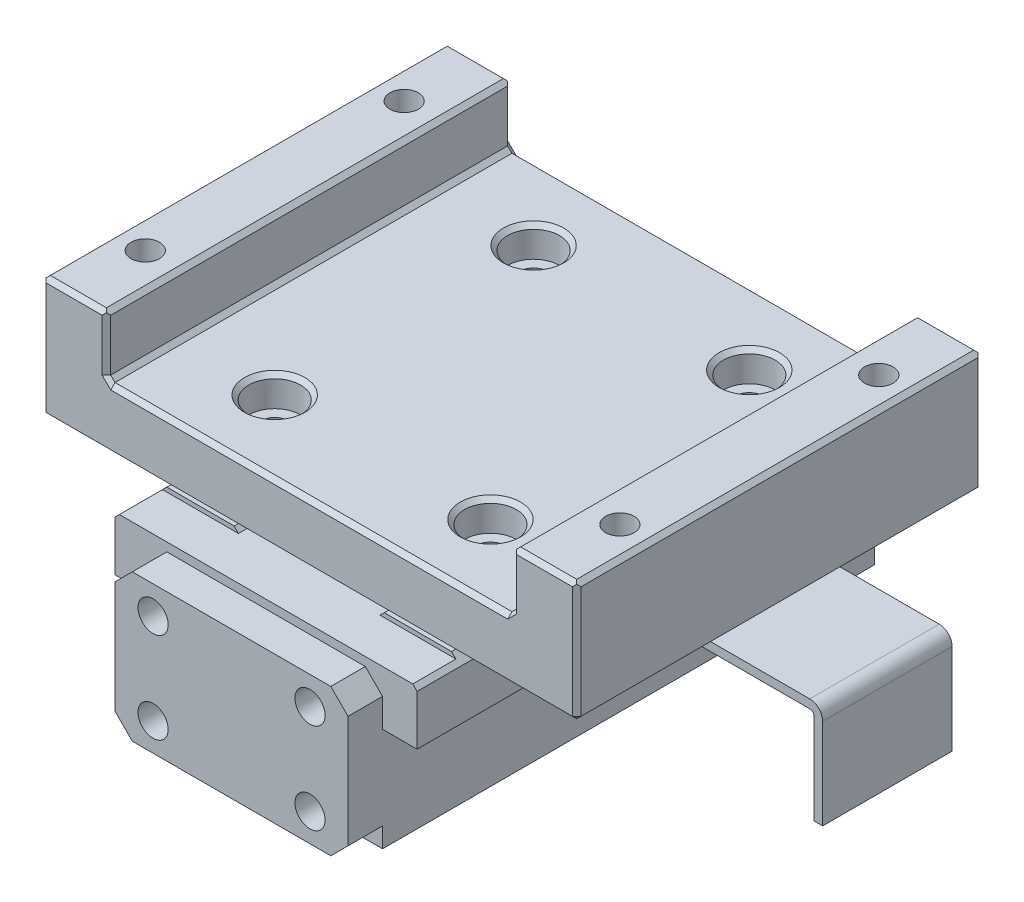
ISO-10303-21;
HEADER;
FILE_DESCRIPTION(('STEP AP214'),'2;1');
FILE_NAME('part.step','',(''),(''),'','','');
FILE_SCHEMA(('AUTOMOTIVE_DESIGN { 1 0 10303 214 1 1 1 1 }'));
ENDSEC;
DATA;
#1=APPLICATION_CONTEXT('core data for automotive mechanical design processes');
#2=APPLICATION_PROTOCOL_DEFINITION('international standard','automotive_design',2000,#1);
#3=PRODUCT_CONTEXT('',#1,'mechanical');
#4=PRODUCT('Part','Part','',(#3));
#5=PRODUCT_RELATED_PRODUCT_CATEGORY('part','',(#4));
#6=PRODUCT_DEFINITION_FORMATION('','',#4);
#7=PRODUCT_DEFINITION_CONTEXT('part definition',#1,'design');
#8=PRODUCT_DEFINITION('design','',#6,#7);
#9=PRODUCT_DEFINITION_SHAPE('','',#8);
#10=(LENGTH_UNIT() NAMED_UNIT(*) SI_UNIT(.MILLI.,.METRE.));
#11=(NAMED_UNIT(*) PLANE_ANGLE_UNIT() SI_UNIT($,.RADIAN.));
#12=(NAMED_UNIT(*) SI_UNIT($,.STERADIAN.) SOLID_ANGLE_UNIT());
#13=UNCERTAINTY_MEASURE_WITH_UNIT(LENGTH_MEASURE(1.E-05),#10,'distance_accuracy_value','');
#14=(GEOMETRIC_REPRESENTATION_CONTEXT(3) GLOBAL_UNCERTAINTY_ASSIGNED_CONTEXT((#13)) GLOBAL_UNIT_ASSIGNED_CONTEXT((#10,
#11,#12)) REPRESENTATION_CONTEXT('',''));
#15=CARTESIAN_POINT('',(0.,0.,0.));
#16=DIRECTION('',(0.,0.,1.));
#17=DIRECTION('',(1.,0.,0.));
#18=AXIS2_PLACEMENT_3D('',#15,#16,#17);
#19=CARTESIAN_POINT('',(-26.59326674,3.550001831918,49.));
#20=DIRECTION('',(0.,0.,1.));
#21=DIRECTION('',(1.,0.,0.));
#22=AXIS2_PLACEMENT_3D('',#19,#20,#21);
#23=PLANE('',#22);
#24=CARTESIAN_POINT('',(-26.59326674,3.55,49.));
#25=DIRECTION('',(0.,0.,1.));
#26=DIRECTION('',(1.,0.,0.));
#27=AXIS2_PLACEMENT_3D('',#24,#25,#26);
#28=CIRCLE('',#27,1.25);
#29=CARTESIAN_POINT('',(-25.34326674,3.55,49.));
#30=VERTEX_POINT('',#29);
#31=EDGE_CURVE('E693',#30,#30,#28,.T.);
#32=ORIENTED_EDGE('',*,*,#31,.T.);
#33=EDGE_LOOP('',(#32));
#34=FACE_BOUND('',#33,.T.);
#35=ADVANCED_FACE('F17',(#34),#23,.T.);
#36=CARTESIAN_POINT('',(-8.406733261,3.549997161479,49.));
#37=DIRECTION('',(0.,0.,1.));
#38=DIRECTION('',(1.,0.,0.));
#39=AXIS2_PLACEMENT_3D('',#36,#37,#38);
#40=PLANE('',#39);
#41=CARTESIAN_POINT('',(-8.406733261,3.55,49.));
#42=DIRECTION('',(0.,0.,1.));
#43=DIRECTION('',(1.,0.,0.));
#44=AXIS2_PLACEMENT_3D('',#41,#42,#43);
#45=CIRCLE('',#44,1.25);
#46=CARTESIAN_POINT('',(-7.156733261,3.55,49.));
#47=VERTEX_POINT('',#46);
#48=EDGE_CURVE('E690',#47,#47,#45,.T.);
#49=ORIENTED_EDGE('',*,*,#48,.T.);
#50=EDGE_LOOP('',(#49));
#51=FACE_BOUND('',#50,.T.);
#52=ADVANCED_FACE('F2340',(#51),#40,.T.);
#53=CARTESIAN_POINT('',(-8.406733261,14.05,49.));
#54=DIRECTION('',(0.,0.,1.));
#55=DIRECTION('',(1.,0.,0.));
#56=AXIS2_PLACEMENT_3D('',#53,#54,#55);
#57=PLANE('',#56);
#58=CARTESIAN_POINT('',(-8.406733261,14.05,49.));
#59=DIRECTION('',(0.,0.,1.));
#60=DIRECTION('',(1.,0.,0.));
#61=AXIS2_PLACEMENT_3D('',#58,#59,#60);
#62=CIRCLE('',#61,1.25);
#63=CARTESIAN_POINT('',(-7.156733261,14.05,49.));
#64=VERTEX_POINT('',#63);
#65=EDGE_CURVE('E687',#64,#64,#62,.T.);
#66=ORIENTED_EDGE('',*,*,#65,.T.);
#67=EDGE_LOOP('',(#66));
#68=FACE_BOUND('',#67,.T.);
#69=ADVANCED_FACE('F2330',(#68),#57,.T.);
#70=CARTESIAN_POINT('',(-26.59326674,14.05,49.));
#71=DIRECTION('',(0.,0.,1.));
#72=DIRECTION('',(1.,0.,0.));
#73=AXIS2_PLACEMENT_3D('',#70,#71,#72);
#74=PLANE('',#73);
#75=CARTESIAN_POINT('',(-26.59326674,14.05,49.));
#76=DIRECTION('',(0.,0.,1.));
#77=DIRECTION('',(1.,0.,0.));
#78=AXIS2_PLACEMENT_3D('',#75,#76,#77);
#79=CIRCLE('',#78,1.25);
#80=CARTESIAN_POINT('',(-25.34326674,14.05,49.));
#81=VERTEX_POINT('',#80);
#82=EDGE_CURVE('E684',#81,#81,#79,.T.);
#83=ORIENTED_EDGE('',*,*,#82,.T.);
#84=EDGE_LOOP('',(#83));
#85=FACE_BOUND('',#84,.T.);
#86=ADVANCED_FACE('F2320',(#85),#74,.T.);
#87=CARTESIAN_POINT('',(-26.59326674,3.55,48.84));
#88=DIRECTION('',(0.,0.,1.));
#89=DIRECTION('',(1.,0.,0.));
#90=AXIS2_PLACEMENT_3D('',#87,#88,#89);
#91=CYLINDRICAL_SURFACE('',#90,1.25);
#92=CARTESIAN_POINT('',(-26.59326674,3.55,57.));
#93=DIRECTION('',(0.,0.,1.));
#94=DIRECTION('',(1.,0.,0.));
#95=AXIS2_PLACEMENT_3D('',#92,#93,#94);
#96=CIRCLE('',#95,1.25);
#97=CARTESIAN_POINT('',(-25.34326674,3.55,57.));
#98=VERTEX_POINT('',#97);
#99=EDGE_CURVE('E681',#98,#98,#96,.F.);
#100=ORIENTED_EDGE('',*,*,#99,.F.);
#101=EDGE_LOOP('',(#100));
#102=FACE_BOUND('',#101,.T.);
#103=ORIENTED_EDGE('',*,*,#31,.F.);
#104=EDGE_LOOP('',(#103));
#105=FACE_BOUND('',#104,.T.);
#106=ADVANCED_FACE('F2310',(#102,#105),#91,.F.);
#107=CARTESIAN_POINT('',(-8.406733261,3.55,48.84));
#108=DIRECTION('',(0.,0.,1.));
#109=DIRECTION('',(1.,0.,0.));
#110=AXIS2_PLACEMENT_3D('',#107,#108,#109);
#111=CYLINDRICAL_SURFACE('',#110,1.25);
#112=CARTESIAN_POINT('',(-8.406733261,3.55,57.));
#113=DIRECTION('',(0.,0.,1.));
#114=DIRECTION('',(1.,0.,0.));
#115=AXIS2_PLACEMENT_3D('',#112,#113,#114);
#116=CIRCLE('',#115,1.25);
#117=CARTESIAN_POINT('',(-7.156733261,3.55,57.));
#118=VERTEX_POINT('',#117);
#119=EDGE_CURVE('E678',#118,#118,#116,.F.);
#120=ORIENTED_EDGE('',*,*,#119,.F.);
#121=EDGE_LOOP('',(#120));
#122=FACE_BOUND('',#121,.T.);
#123=ORIENTED_EDGE('',*,*,#48,.F.);
#124=EDGE_LOOP('',(#123));
#125=FACE_BOUND('',#124,.T.);
#126=ADVANCED_FACE('F2300',(#122,#125),#111,.F.);
#127=CARTESIAN_POINT('',(-8.406733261,14.05,48.84));
#128=DIRECTION('',(0.,0.,1.));
#129=DIRECTION('',(1.,0.,0.));
#130=AXIS2_PLACEMENT_3D('',#127,#128,#129);
#131=CYLINDRICAL_SURFACE('',#130,1.25);
#132=CARTESIAN_POINT('',(-8.406733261,14.05,57.));
#133=DIRECTION('',(0.,0.,1.));
#134=DIRECTION('',(1.,0.,0.));
#135=AXIS2_PLACEMENT_3D('',#132,#133,#134);
#136=CIRCLE('',#135,1.25);
#137=CARTESIAN_POINT('',(-7.156733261,14.05,57.));
#138=VERTEX_POINT('',#137);
#139=EDGE_CURVE('E675',#138,#138,#136,.F.);
#140=ORIENTED_EDGE('',*,*,#139,.F.);
#141=EDGE_LOOP('',(#140));
#142=FACE_BOUND('',#141,.T.);
#143=ORIENTED_EDGE('',*,*,#65,.F.);
#144=EDGE_LOOP('',(#143));
#145=FACE_BOUND('',#144,.T.);
#146=ADVANCED_FACE('F2290',(#142,#145),#131,.F.);
#147=CARTESIAN_POINT('',(-26.59326674,14.05,48.84));
#148=DIRECTION('',(0.,0.,1.));
#149=DIRECTION('',(1.,0.,0.));
#150=AXIS2_PLACEMENT_3D('',#147,#148,#149);
#151=CYLINDRICAL_SURFACE('',#150,1.25);
#152=CARTESIAN_POINT('',(-26.59326674,14.05,57.));
#153=DIRECTION('',(0.,0.,1.));
#154=DIRECTION('',(1.,0.,0.));
#155=AXIS2_PLACEMENT_3D('',#152,#153,#154);
#156=CIRCLE('',#155,1.25);
#157=CARTESIAN_POINT('',(-25.34326674,14.05,57.));
#158=VERTEX_POINT('',#157);
#159=EDGE_CURVE('E672',#158,#158,#156,.F.);
#160=ORIENTED_EDGE('',*,*,#159,.F.);
#161=EDGE_LOOP('',(#160));
#162=FACE_BOUND('',#161,.T.);
#163=ORIENTED_EDGE('',*,*,#82,.F.);
#164=EDGE_LOOP('',(#163));
#165=FACE_BOUND('',#164,.T.);
#166=ADVANCED_FACE('F2280',(#162,#165),#151,.F.);
#167=CARTESIAN_POINT('',(-26.59326674,3.549999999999,57.));
#168=DIRECTION('',(0.,0.,1.));
#169=DIRECTION('',(1.,0.,0.));
#170=AXIS2_PLACEMENT_3D('',#167,#168,#169);
#171=PLANE('',#170);
#172=ORIENTED_EDGE('',*,*,#99,.T.);
#173=EDGE_LOOP('',(#172));
#174=FACE_BOUND('',#173,.T.);
#175=CARTESIAN_POINT('',(-26.59326674,3.55,57.));
#176=DIRECTION('',(0.,0.,-1.));
#177=DIRECTION('',(-1.,0.,0.));
#178=AXIS2_PLACEMENT_3D('',#175,#176,#177);
#179=CIRCLE('',#178,1.75);
#180=CARTESIAN_POINT('',(-28.34326674,3.55,57.));
#181=VERTEX_POINT('',#180);
#182=EDGE_CURVE('E669',#181,#181,#179,.F.);
#183=ORIENTED_EDGE('',*,*,#182,.T.);
#184=EDGE_LOOP('',(#183));
#185=FACE_BOUND('',#184,.T.);
#186=ADVANCED_FACE('F2270',(#174,#185),#171,.T.);
#187=CARTESIAN_POINT('',(-8.406733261,3.549999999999,57.));
#188=DIRECTION('',(0.,0.,1.));
#189=DIRECTION('',(1.,0.,0.));
#190=AXIS2_PLACEMENT_3D('',#187,#188,#189);
#191=PLANE('',#190);
#192=ORIENTED_EDGE('',*,*,#119,.T.);
#193=EDGE_LOOP('',(#192));
#194=FACE_BOUND('',#193,.T.);
#195=CARTESIAN_POINT('',(-8.406733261,3.55,57.));
#196=DIRECTION('',(0.,0.,-1.));
#197=DIRECTION('',(-1.,0.,0.));
#198=AXIS2_PLACEMENT_3D('',#195,#196,#197);
#199=CIRCLE('',#198,1.75);
#200=CARTESIAN_POINT('',(-10.156733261,3.55,57.));
#201=VERTEX_POINT('',#200);
#202=EDGE_CURVE('E666',#201,#201,#199,.F.);
#203=ORIENTED_EDGE('',*,*,#202,.T.);
#204=EDGE_LOOP('',(#203));
#205=FACE_BOUND('',#204,.T.);
#206=ADVANCED_FACE('F2260',(#194,#205),#191,.T.);
#207=CARTESIAN_POINT('',(-8.406733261,14.05,57.));
#208=DIRECTION('',(0.,0.,1.));
#209=DIRECTION('',(1.,0.,0.));
#210=AXIS2_PLACEMENT_3D('',#207,#208,#209);
#211=PLANE('',#210);
#212=ORIENTED_EDGE('',*,*,#139,.T.);
#213=EDGE_LOOP('',(#212));
#214=FACE_BOUND('',#213,.T.);
#215=CARTESIAN_POINT('',(-8.406733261,14.05,57.));
#216=DIRECTION('',(0.,0.,-1.));
#217=DIRECTION('',(-1.,0.,0.));
#218=AXIS2_PLACEMENT_3D('',#215,#216,#217);
#219=CIRCLE('',#218,1.75);
#220=CARTESIAN_POINT('',(-10.156733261,14.05,57.));
#221=VERTEX_POINT('',#220);
#222=EDGE_CURVE('E663',#221,#221,#219,.F.);
#223=ORIENTED_EDGE('',*,*,#222,.T.);
#224=EDGE_LOOP('',(#223));
#225=FACE_BOUND('',#224,.T.);
#226=ADVANCED_FACE('F2250',(#214,#225),#211,.T.);
#227=CARTESIAN_POINT('',(-26.59326674,14.05,57.));
#228=DIRECTION('',(0.,0.,1.));
#229=DIRECTION('',(1.,0.,0.));
#230=AXIS2_PLACEMENT_3D('',#227,#228,#229);
#231=PLANE('',#230);
#232=ORIENTED_EDGE('',*,*,#159,.T.);
#233=EDGE_LOOP('',(#232));
#234=FACE_BOUND('',#233,.T.);
#235=CARTESIAN_POINT('',(-26.59326674,14.05,57.));
#236=DIRECTION('',(0.,0.,-1.));
#237=DIRECTION('',(-1.,0.,0.));
#238=AXIS2_PLACEMENT_3D('',#235,#236,#237);
#239=CIRCLE('',#238,1.75);
#240=CARTESIAN_POINT('',(-28.34326674,14.05,57.));
#241=VERTEX_POINT('',#240);
#242=EDGE_CURVE('E659',#241,#241,#239,.F.);
#243=ORIENTED_EDGE('',*,*,#242,.T.);
#244=EDGE_LOOP('',(#243));
#245=FACE_BOUND('',#244,.T.);
#246=ADVANCED_FACE('F2240',(#234,#245),#231,.T.);
#247=CARTESIAN_POINT('',(-26.59326674,3.55,61.08735670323));
#248=DIRECTION('',(0.,0.,-1.));
#249=DIRECTION('',(-1.,0.,0.));
#250=AXIS2_PLACEMENT_3D('',#247,#248,#249);
#251=CYLINDRICAL_SURFACE('',#250,1.75);
#252=CARTESIAN_POINT('',(-26.59326674,3.55,61.));
#253=DIRECTION('',(0.,0.,-1.));
#254=DIRECTION('',(-1.,0.,0.));
#255=AXIS2_PLACEMENT_3D('',#252,#253,#254);
#256=CIRCLE('',#255,1.75);
#257=CARTESIAN_POINT('',(-28.34326674,3.55,61.));
#258=VERTEX_POINT('',#257);
#259=EDGE_CURVE('E655',#258,#258,#256,.T.);
#260=ORIENTED_EDGE('',*,*,#259,.F.);
#261=EDGE_LOOP('',(#260));
#262=FACE_BOUND('',#261,.T.);
#263=ORIENTED_EDGE('',*,*,#182,.F.);
#264=EDGE_LOOP('',(#263));
#265=FACE_BOUND('',#264,.T.);
#266=ADVANCED_FACE('F2230',(#262,#265),#251,.F.);
#267=CARTESIAN_POINT('',(-8.406733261,3.55,61.08735670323));
#268=DIRECTION('',(0.,0.,-1.));
#269=DIRECTION('',(-1.,0.,0.));
#270=AXIS2_PLACEMENT_3D('',#267,#268,#269);
#271=CYLINDRICAL_SURFACE('',#270,1.75);
#272=CARTESIAN_POINT('',(-8.406733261,3.55,61.));
#273=DIRECTION('',(0.,0.,-1.));
#274=DIRECTION('',(-1.,0.,0.));
#275=AXIS2_PLACEMENT_3D('',#272,#273,#274);
#276=CIRCLE('',#275,1.75);
#277=CARTESIAN_POINT('',(-10.156733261,3.55,61.));
#278=VERTEX_POINT('',#277);
#279=EDGE_CURVE('E652',#278,#278,#276,.T.);
#280=ORIENTED_EDGE('',*,*,#279,.F.);
#281=EDGE_LOOP('',(#280));
#282=FACE_BOUND('',#281,.T.);
#283=ORIENTED_EDGE('',*,*,#202,.F.);
#284=EDGE_LOOP('',(#283));
#285=FACE_BOUND('',#284,.T.);
#286=ADVANCED_FACE('F2220',(#282,#285),#271,.F.);
#287=CARTESIAN_POINT('',(-8.406733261,14.05,61.08735670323));
#288=DIRECTION('',(0.,0.,-1.));
#289=DIRECTION('',(-1.,0.,0.));
#290=AXIS2_PLACEMENT_3D('',#287,#288,#289);
#291=CYLINDRICAL_SURFACE('',#290,1.75);
#292=CARTESIAN_POINT('',(-8.406733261,14.05,61.));
#293=DIRECTION('',(0.,0.,-1.));
#294=DIRECTION('',(-1.,0.,0.));
#295=AXIS2_PLACEMENT_3D('',#292,#293,#294);
#296=CIRCLE('',#295,1.75);
#297=CARTESIAN_POINT('',(-10.156733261,14.05,61.));
#298=VERTEX_POINT('',#297);
#299=EDGE_CURVE('E649',#298,#298,#296,.T.);
#300=ORIENTED_EDGE('',*,*,#299,.F.);
#301=EDGE_LOOP('',(#300));
#302=FACE_BOUND('',#301,.T.);
#303=ORIENTED_EDGE('',*,*,#222,.F.);
#304=EDGE_LOOP('',(#303));
#305=FACE_BOUND('',#304,.T.);
#306=ADVANCED_FACE('F2210',(#302,#305),#291,.F.);
#307=CARTESIAN_POINT('',(-26.59326674,14.05,61.08735670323));
#308=DIRECTION('',(0.,0.,-1.));
#309=DIRECTION('',(-1.,0.,0.));
#310=AXIS2_PLACEMENT_3D('',#307,#308,#309);
#311=CYLINDRICAL_SURFACE('',#310,1.75);
#312=CARTESIAN_POINT('',(-26.59326674,14.05,61.));
#313=DIRECTION('',(0.,0.,-1.));
#314=DIRECTION('',(-1.,0.,0.));
#315=AXIS2_PLACEMENT_3D('',#312,#313,#314);
#316=CIRCLE('',#315,1.75);
#317=CARTESIAN_POINT('',(-28.34326674,14.05,61.));
#318=VERTEX_POINT('',#317);
#319=EDGE_CURVE('E645',#318,#318,#316,.T.);
#320=ORIENTED_EDGE('',*,*,#319,.F.);
#321=EDGE_LOOP('',(#320));
#322=FACE_BOUND('',#321,.T.);
#323=ORIENTED_EDGE('',*,*,#242,.F.);
#324=EDGE_LOOP('',(#323));
#325=FACE_BOUND('',#324,.T.);
#326=ADVANCED_FACE('F2200',(#322,#325),#311,.F.);
#327=CARTESIAN_POINT('',(-17.5,0.3,59.));
#328=DIRECTION('',(0.,1.,0.));
#329=DIRECTION('',(0.,0.,1.));
#330=AXIS2_PLACEMENT_3D('',#327,#328,#329);
#331=PLANE('',#330);
#332=DIRECTION('',(1.,0.,0.));
#333=VECTOR('',#332,1.);
#334=CARTESIAN_POINT('',(-17.5,0.300000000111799,61.));
#335=LINE('',#334,#333);
#336=CARTESIAN_POINT('',(-29.0000000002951,0.300000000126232,61.));
#337=VERTEX_POINT('',#336);
#338=CARTESIAN_POINT('',(-5.99999999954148,0.300000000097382,61.));
#339=VERTEX_POINT('',#338);
#340=EDGE_CURVE('E2594',#337,#339,#335,.T.);
#341=ORIENTED_EDGE('',*,*,#340,.F.);
#342=DIRECTION('',(0.,0.,1.));
#343=VECTOR('',#342,1.);
#344=CARTESIAN_POINT('',(-29.0000000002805,0.300000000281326,59.));
#345=LINE('',#344,#343);
#346=CARTESIAN_POINT('',(-29.0000000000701,0.300000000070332,57.));
#347=VERTEX_POINT('',#346);
#348=EDGE_CURVE('E2405',#337,#347,#345,.F.);
#349=ORIENTED_EDGE('',*,*,#348,.T.);
#350=DIRECTION('',(1.,0.,0.));
#351=VECTOR('',#350,1.);
#352=CARTESIAN_POINT('',(-17.5,0.3,57.));
#353=LINE('',#352,#351);
#354=CARTESIAN_POINT('',(-5.99999999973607,0.300000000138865,57.));
#355=VERTEX_POINT('',#354);
#356=EDGE_CURVE('E2586',#355,#347,#353,.F.);
#357=ORIENTED_EDGE('',*,*,#356,.F.);
#358=DIRECTION('',(0.,0.,1.));
#359=VECTOR('',#358,1.);
#360=CARTESIAN_POINT('',(-5.99999999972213,0.300000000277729,59.));
#361=LINE('',#360,#359);
#362=EDGE_CURVE('E2596',#339,#355,#361,.F.);
#363=ORIENTED_EDGE('',*,*,#362,.F.);
#364=EDGE_LOOP('',(#341,#349,#357,#363));
#365=FACE_BOUND('',#364,.T.);
#366=ADVANCED_FACE('F2190',(#365),#331,.F.);
#367=CARTESIAN_POINT('',(-17.5,8.8,57.));
#368=DIRECTION('',(0.,0.,1.));
#369=DIRECTION('',(1.,0.,0.));
#370=AXIS2_PLACEMENT_3D('',#367,#368,#369);
#371=PLANE('',#370);
#372=CARTESIAN_POINT('',(-17.5,8.8,57.));
#373=DIRECTION('',(0.,0.,-1.));
#374=DIRECTION('',(-1.,0.,0.));
#375=AXIS2_PLACEMENT_3D('',#372,#373,#374);
#376=CIRCLE('',#375,7.);
#377=CARTESIAN_POINT('',(-24.5,8.8,57.));
#378=VERTEX_POINT('',#377);
#379=EDGE_CURVE('E635',#378,#378,#376,.T.);
#380=ORIENTED_EDGE('',*,*,#379,.T.);
#381=EDGE_LOOP('',(#380));
#382=FACE_BOUND('',#381,.T.);
#383=ADVANCED_FACE('F2180',(#382),#371,.F.);
#384=CARTESIAN_POINT('',(-23.9711109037,12.5,19.00000000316));
#385=DIRECTION('',(0.,1.,0.));
#386=DIRECTION('',(0.,0.,1.));
#387=AXIS2_PLACEMENT_3D('',#384,#385,#386);
#388=PLANE('',#387);
#389=DIRECTION('',(1.,0.,0.));
#390=VECTOR('',#389,1.);
#391=CARTESIAN_POINT('',(-23.97111090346,12.49999999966,38.));
#392=LINE('',#391,#390);
#393=CARTESIAN_POINT('',(-23.4422218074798,12.4999999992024,38.0000000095));
#394=VERTEX_POINT('',#393);
#395=CARTESIAN_POINT('',(-24.5,12.499999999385,38.000000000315));
#396=VERTEX_POINT('',#395);
#397=EDGE_CURVE('E2622',#394,#396,#392,.F.);
#398=ORIENTED_EDGE('',*,*,#397,.T.);
#399=DIRECTION('',(0.,0.,-1.));
#400=VECTOR('',#399,1.);
#401=CARTESIAN_POINT('',(-24.5,12.49999999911,19.00000000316));
#402=LINE('',#401,#400);
#403=CARTESIAN_POINT('',(-24.49999999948,12.4999999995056,0.));
#404=VERTEX_POINT('',#403);
#405=EDGE_CURVE('E2644',#404,#396,#402,.F.);
#406=ORIENTED_EDGE('',*,*,#405,.F.);
#407=DIRECTION('',(1.,0.,0.));
#408=VECTOR('',#407,1.);
#409=CARTESIAN_POINT('',(-23.9711109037,12.5,0.));
#410=LINE('',#409,#408);
#411=CARTESIAN_POINT('',(-23.4422218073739,12.4999999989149,0.));
#412=VERTEX_POINT('',#411);
#413=EDGE_CURVE('E662',#412,#404,#410,.F.);
#414=ORIENTED_EDGE('',*,*,#413,.F.);
#415=DIRECTION('',(0.,0.,-1.));
#416=VECTOR('',#415,1.);
#417=CARTESIAN_POINT('',(-23.4422218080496,12.4999999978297,58.14));
#418=LINE('',#417,#416);
#419=EDGE_CURVE('E637',#412,#394,#418,.F.);
#420=ORIENTED_EDGE('',*,*,#419,.T.);
#421=EDGE_LOOP('',(#398,#406,#414,#420));
#422=FACE_BOUND('',#421,.T.);
#423=ADVANCED_FACE('F2170',(#422),#388,.F.);
#424=CARTESIAN_POINT('',(-23.97111090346,10.65000000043,38.));
#425=DIRECTION('',(0.,0.,1.));
#426=DIRECTION('',(1.,0.,0.));
#427=AXIS2_PLACEMENT_3D('',#424,#425,#426);
#428=PLANE('',#427);
#429=CARTESIAN_POINT('',(-17.5,8.8,38.000000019));
#430=DIRECTION('',(0.,0.,-1.));
#431=DIRECTION('',(-1.,0.,0.));
#432=AXIS2_PLACEMENT_3D('',#429,#430,#431);
#433=CIRCLE('',#432,7.);
#434=CARTESIAN_POINT('',(-24.5,8.8,38.000000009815));
#435=VERTEX_POINT('',#434);
#436=EDGE_CURVE('E607',#394,#435,#433,.F.);
#437=ORIENTED_EDGE('',*,*,#436,.T.);
#438=DIRECTION('',(0.,1.,0.));
#439=VECTOR('',#438,1.);
#440=CARTESIAN_POINT('',(-24.5,6.25,38.00000000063));
#441=LINE('',#440,#439);
#442=EDGE_CURVE('E640',#396,#435,#441,.F.);
#443=ORIENTED_EDGE('',*,*,#442,.F.);
#444=ORIENTED_EDGE('',*,*,#397,.F.);
#445=EDGE_LOOP('',(#437,#443,#444));
#446=FACE_BOUND('',#445,.T.);
#447=ADVANCED_FACE('F2160',(#446),#428,.F.);
#448=CARTESIAN_POINT('',(-11.0288890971,12.5,19.00000000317));
#449=DIRECTION('',(0.,1.,0.));
#450=DIRECTION('',(0.,0.,1.));
#451=AXIS2_PLACEMENT_3D('',#448,#449,#450);
#452=PLANE('',#451);
#453=DIRECTION('',(1.,0.,0.));
#454=VECTOR('',#453,1.);
#455=CARTESIAN_POINT('',(-11.0288890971,12.5,0.));
#456=LINE('',#455,#454);
#457=CARTESIAN_POINT('',(-10.5,12.4999999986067,0.));
#458=VERTEX_POINT('',#457);
#459=CARTESIAN_POINT('',(-11.5577781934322,12.5000000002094,0.));
#460=VERTEX_POINT('',#459);
#461=EDGE_CURVE('E2611',#458,#460,#456,.F.);
#462=ORIENTED_EDGE('',*,*,#461,.F.);
#463=DIRECTION('',(0.,0.,-1.));
#464=VECTOR('',#463,1.);
#465=CARTESIAN_POINT('',(-10.5,12.49999999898,19.00000000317));
#466=LINE('',#465,#464);
#467=CARTESIAN_POINT('',(-10.5000000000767,12.499999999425,38.000000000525));
#468=VERTEX_POINT('',#467);
#469=EDGE_CURVE('E606',#458,#468,#466,.F.);
#470=ORIENTED_EDGE('',*,*,#469,.T.);
#471=DIRECTION('',(1.,0.,0.));
#472=VECTOR('',#471,1.);
#473=CARTESIAN_POINT('',(-11.0288890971,12.49999999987,38.));
#474=LINE('',#473,#472);
#475=CARTESIAN_POINT('',(-11.5577781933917,12.5000000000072,38.000000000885));
#476=VERTEX_POINT('',#475);
#477=EDGE_CURVE('E616',#468,#476,#474,.F.);
#478=ORIENTED_EDGE('',*,*,#477,.T.);
#479=DIRECTION('',(0.,0.,-1.));
#480=VECTOR('',#479,1.);
#481=CARTESIAN_POINT('',(-11.5577781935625,12.5000000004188,58.14));
#482=LINE('',#481,#480);
#483=EDGE_CURVE('E634',#476,#460,#482,.T.);
#484=ORIENTED_EDGE('',*,*,#483,.T.);
#485=EDGE_LOOP('',(#462,#470,#478,#484));
#486=FACE_BOUND('',#485,.T.);
#487=ADVANCED_FACE('F2151',(#486),#452,.F.);
#488=CARTESIAN_POINT('',(-11.0288890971,10.65000000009,38.));
#489=DIRECTION('',(0.,0.,1.));
#490=DIRECTION('',(1.,0.,0.));
#491=AXIS2_PLACEMENT_3D('',#488,#489,#490);
#492=PLANE('',#491);
#493=CARTESIAN_POINT('',(-17.5,8.8,38.00000000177));
#494=DIRECTION('',(0.,0.,-1.));
#495=DIRECTION('',(-1.,0.,0.));
#496=AXIS2_PLACEMENT_3D('',#493,#494,#495);
#497=CIRCLE('',#496,7.);
#498=CARTESIAN_POINT('',(-10.5,8.800000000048,38.000000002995));
#499=VERTEX_POINT('',#498);
#500=EDGE_CURVE('E614',#499,#476,#497,.F.);
#501=ORIENTED_EDGE('',*,*,#500,.T.);
#502=ORIENTED_EDGE('',*,*,#477,.F.);
#503=DIRECTION('',(0.,1.,0.));
#504=VECTOR('',#503,1.);
#505=CARTESIAN_POINT('',(-10.5,6.25,38.00000000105));
#506=LINE('',#505,#504);
#507=EDGE_CURVE('E600',#468,#499,#506,.F.);
#508=ORIENTED_EDGE('',*,*,#507,.T.);
#509=EDGE_LOOP('',(#501,#502,#508));
#510=FACE_BOUND('',#509,.T.);
#511=ADVANCED_FACE('F612',(#510),#492,.F.);
#512=CARTESIAN_POINT('',(-17.5,4.400000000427,38.));
#513=DIRECTION('',(0.,0.,1.));
#514=DIRECTION('',(1.,0.,0.));
#515=AXIS2_PLACEMENT_3D('',#512,#513,#514);
#516=PLANE('',#515);
#517=DIRECTION('',(0.,1.,0.));
#518=VECTOR('',#517,1.);
#519=CARTESIAN_POINT('',(-24.5,6.25,38.00000000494));
#520=LINE('',#519,#518);
#521=CARTESIAN_POINT('',(-24.4999999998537,0.,38.00000000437));
#522=VERTEX_POINT('',#521);
#523=EDGE_CURVE('E624',#435,#522,#520,.F.);
#524=ORIENTED_EDGE('',*,*,#523,.F.);
#525=CARTESIAN_POINT('',(-17.5,8.8,38.00000000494));
#526=DIRECTION('',(0.,0.,-1.));
#527=DIRECTION('',(-1.,0.,0.));
#528=AXIS2_PLACEMENT_3D('',#525,#526,#527);
#529=CIRCLE('',#528,7.);
#530=EDGE_CURVE('E621',#499,#435,#529,.T.);
#531=ORIENTED_EDGE('',*,*,#530,.F.);
#532=DIRECTION('',(0.,1.,0.));
#533=VECTOR('',#532,1.);
#534=CARTESIAN_POINT('',(-10.5,6.25,38.00000000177));
#535=LINE('',#534,#533);
#536=CARTESIAN_POINT('',(-10.5,0.,38.00000000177));
#537=VERTEX_POINT('',#536);
#538=EDGE_CURVE('E596',#499,#537,#535,.F.);
#539=ORIENTED_EDGE('',*,*,#538,.T.);
#540=DIRECTION('',(1.,0.,0.));
#541=VECTOR('',#540,1.);
#542=CARTESIAN_POINT('',(-17.5,0.,38.0000000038));
#543=LINE('',#542,#541);
#544=EDGE_CURVE('E2631',#537,#522,#543,.F.);
#545=ORIENTED_EDGE('',*,*,#544,.T.);
#546=EDGE_LOOP('',(#524,#531,#539,#545));
#547=FACE_BOUND('',#546,.T.);
#548=ADVANCED_FACE('F622',(#547),#516,.F.);
#549=CARTESIAN_POINT('',(25.5,6.8,28.5));
#550=DIRECTION('',(0.,1.,0.));
#551=DIRECTION('',(0.,0.,1.));
#552=AXIS2_PLACEMENT_3D('',#549,#550,#551);
#553=PLANE('',#552);
#554=DIRECTION('',(1.,0.,0.));
#555=VECTOR('',#554,1.);
#556=CARTESIAN_POINT('',(25.5,6.8,21.));
#557=LINE('',#556,#555);
#558=CARTESIAN_POINT('',(25.0000000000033,6.8,21.));
#559=VERTEX_POINT('',#558);
#560=CARTESIAN_POINT('',(26.,6.8,21.));
#561=VERTEX_POINT('',#560);
#562=EDGE_CURVE('E628',#559,#561,#557,.T.);
#563=ORIENTED_EDGE('',*,*,#562,.T.);
#564=DIRECTION('',(0.,0.,-1.));
#565=VECTOR('',#564,1.);
#566=CARTESIAN_POINT('',(26.,6.8,28.5));
#567=LINE('',#566,#565);
#568=CARTESIAN_POINT('',(26.,6.8,36.));
#569=VERTEX_POINT('',#568);
#570=EDGE_CURVE('E2493',#569,#561,#567,.T.);
#571=ORIENTED_EDGE('',*,*,#570,.F.);
#572=DIRECTION('',(1.,0.,0.));
#573=VECTOR('',#572,1.);
#574=CARTESIAN_POINT('',(25.5,6.8,36.));
#575=LINE('',#574,#573);
#576=CARTESIAN_POINT('',(25.00000000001,6.8,36.));
#577=VERTEX_POINT('',#576);
#578=EDGE_CURVE('E2598',#577,#569,#575,.T.);
#579=ORIENTED_EDGE('',*,*,#578,.F.);
#580=DIRECTION('',(0.,0.,-1.));
#581=VECTOR('',#580,1.);
#582=CARTESIAN_POINT('',(25.,6.8,28.5));
#583=LINE('',#582,#581);
#584=EDGE_CURVE('E2556',#577,#559,#583,.T.);
#585=ORIENTED_EDGE('',*,*,#584,.T.);
#586=EDGE_LOOP('',(#563,#571,#579,#585));
#587=FACE_BOUND('',#586,.T.);
#588=ADVANCED_FACE('F2124',(#587),#553,.F.);
#589=CARTESIAN_POINT('',(-4.99999999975,1.30000000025,59.));
#590=DIRECTION('',(0.707106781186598,-0.707106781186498,0.));
#591=DIRECTION('',(0.707106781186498,0.707106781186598,0.));
#592=AXIS2_PLACEMENT_3D('',#589,#590,#591);
#593=PLANE('',#592);
#594=ORIENTED_EDGE('',*,*,#362,.T.);
#595=DIRECTION('',(-0.707106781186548,-0.707106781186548,0.));
#596=VECTOR('',#595,1.);
#597=CARTESIAN_POINT('',(-4.,2.3,57.));
#598=LINE('',#597,#596);
#599=CARTESIAN_POINT('',(-3.99999999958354,2.30000000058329,57.));
#600=VERTEX_POINT('',#599);
#601=EDGE_CURVE('E2589',#600,#355,#598,.T.);
#602=ORIENTED_EDGE('',*,*,#601,.F.);
#603=DIRECTION('',(0.,0.,-1.));
#604=VECTOR('',#603,1.);
#605=CARTESIAN_POINT('',(-4.,2.300000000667,30.5));
#606=LINE('',#605,#604);
#607=CARTESIAN_POINT('',(-3.99999999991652,2.30000000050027,61.));
#608=VERTEX_POINT('',#607);
#609=EDGE_CURVE('E2424',#608,#600,#606,.T.);
#610=ORIENTED_EDGE('',*,*,#609,.F.);
#611=DIRECTION('',(0.707106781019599,0.707106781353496,0.));
#612=VECTOR('',#611,1.);
#613=CARTESIAN_POINT('',(-5.9999999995,0.3000000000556,61.));
#614=LINE('',#613,#612);
#615=EDGE_CURVE('E657',#339,#608,#614,.T.);
#616=ORIENTED_EDGE('',*,*,#615,.F.);
#617=EDGE_LOOP('',(#594,#602,#610,#616));
#618=FACE_BOUND('',#617,.T.);
#619=ADVANCED_FACE('F2114',(#618),#593,.T.);
#620=CARTESIAN_POINT('',(-17.5,8.8,61.));
#621=DIRECTION('',(0.,0.,1.));
#622=DIRECTION('',(1.,0.,0.));
#623=AXIS2_PLACEMENT_3D('',#620,#621,#622);
#624=PLANE('',#623);
#625=ORIENTED_EDGE('',*,*,#319,.T.);
#626=EDGE_LOOP('',(#625));
#627=FACE_BOUND('',#626,.T.);
#628=ORIENTED_EDGE('',*,*,#299,.T.);
#629=EDGE_LOOP('',(#628));
#630=FACE_BOUND('',#629,.T.);
#631=ORIENTED_EDGE('',*,*,#279,.T.);
#632=EDGE_LOOP('',(#631));
#633=FACE_BOUND('',#632,.T.);
#634=ORIENTED_EDGE('',*,*,#259,.T.);
#635=EDGE_LOOP('',(#634));
#636=FACE_BOUND('',#635,.T.);
#637=DIRECTION('',(0.,1.,0.));
#638=VECTOR('',#637,1.);
#639=CARTESIAN_POINT('',(-31.,7.65,61.));
#640=LINE('',#639,#638);
#641=CARTESIAN_POINT('',(-31.0000000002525,15.2999999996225,61.));
#642=VERTEX_POINT('',#641);
#643=CARTESIAN_POINT('',(-31.000000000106,2.30000000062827,61.));
#644=VERTEX_POINT('',#643);
#645=EDGE_CURVE('E2392',#642,#644,#640,.F.);
#646=ORIENTED_EDGE('',*,*,#645,.T.);
#647=DIRECTION('',(-0.707106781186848,0.707106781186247,0.));
#648=VECTOR('',#647,1.);
#649=CARTESIAN_POINT('',(-30.00000000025,1.30000000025,61.));
#650=LINE('',#649,#648);
#651=EDGE_CURVE('E648',#644,#337,#650,.F.);
#652=ORIENTED_EDGE('',*,*,#651,.T.);
#653=ORIENTED_EDGE('',*,*,#340,.T.);
#654=ORIENTED_EDGE('',*,*,#615,.T.);
#655=DIRECTION('',(0.,1.,0.));
#656=VECTOR('',#655,1.);
#657=CARTESIAN_POINT('',(-4.,7.65,61.));
#658=LINE('',#657,#656);
#659=CARTESIAN_POINT('',(-3.99999999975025,15.2999999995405,61.));
#660=VERTEX_POINT('',#659);
#661=EDGE_CURVE('E2427',#660,#608,#658,.F.);
#662=ORIENTED_EDGE('',*,*,#661,.F.);
#663=DIRECTION('',(-0.707106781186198,0.707106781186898,0.));
#664=VECTOR('',#663,1.);
#665=CARTESIAN_POINT('',(-4.99999999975,16.29999999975,61.));
#666=LINE('',#665,#664);
#667=CARTESIAN_POINT('',(-5.99999999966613,17.2999999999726,61.));
#668=VERTEX_POINT('',#667);
#669=EDGE_CURVE('E2496',#668,#660,#666,.F.);
#670=ORIENTED_EDGE('',*,*,#669,.F.);
#671=DIRECTION('',(1.,0.,0.));
#672=VECTOR('',#671,1.);
#673=CARTESIAN_POINT('',(-17.5,17.3,61.));
#674=LINE('',#673,#672);
#675=CARTESIAN_POINT('',(-29.0000000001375,17.2999999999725,61.));
#676=VERTEX_POINT('',#675);
#677=EDGE_CURVE('E2501',#676,#668,#674,.T.);
#678=ORIENTED_EDGE('',*,*,#677,.F.);
#679=DIRECTION('',(0.707106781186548,0.707106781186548,0.));
#680=VECTOR('',#679,1.);
#681=CARTESIAN_POINT('',(-30.00000000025,16.29999999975,61.));
#682=LINE('',#681,#680);
#683=EDGE_CURVE('E2397',#676,#642,#682,.F.);
#684=ORIENTED_EDGE('',*,*,#683,.T.);
#685=EDGE_LOOP('',(#646,#652,#653,#654,#662,#670,#678,#684));
#686=FACE_BOUND('',#685,.T.);
#687=ADVANCED_FACE('F2104',(#627,#630,#633,#636,#686),#624,.T.);
#688=CARTESIAN_POINT('',(-30.00000000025,1.30000000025,59.));
#689=DIRECTION('',(0.707106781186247,0.707106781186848,0.));
#690=DIRECTION('',(-0.707106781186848,0.707106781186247,0.));
#691=AXIS2_PLACEMENT_3D('',#688,#689,#690);
#692=PLANE('',#691);
#693=ORIENTED_EDGE('',*,*,#651,.F.);
#694=DIRECTION('',(0.,0.,-1.));
#695=VECTOR('',#694,1.);
#696=CARTESIAN_POINT('',(-31.,2.30000000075,30.5));
#697=LINE('',#696,#695);
#698=CARTESIAN_POINT('',(-31.000000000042,2.30000000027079,57.));
#699=VERTEX_POINT('',#698);
#700=EDGE_CURVE('E2400',#644,#699,#697,.T.);
#701=ORIENTED_EDGE('',*,*,#700,.T.);
#702=DIRECTION('',(-0.707106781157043,0.707106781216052,0.));
#703=VECTOR('',#702,1.);
#704=CARTESIAN_POINT('',(-29.,0.3000000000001,57.));
#705=LINE('',#704,#703);
#706=EDGE_CURVE('E2584',#347,#699,#705,.T.);
#707=ORIENTED_EDGE('',*,*,#706,.F.);
#708=ORIENTED_EDGE('',*,*,#348,.F.);
#709=EDGE_LOOP('',(#693,#701,#707,#708));
#710=FACE_BOUND('',#709,.T.);
#711=ADVANCED_FACE('F2094',(#710),#692,.F.);
#712=CARTESIAN_POINT('',(-17.5,1.15,57.));
#713=DIRECTION('',(0.,0.,1.));
#714=DIRECTION('',(1.,0.,0.));
#715=AXIS2_PLACEMENT_3D('',#712,#713,#714);
#716=PLANE('',#715);
#717=ORIENTED_EDGE('',*,*,#356,.T.);
#718=ORIENTED_EDGE('',*,*,#706,.T.);
#719=DIRECTION('',(0.,1.,0.));
#720=VECTOR('',#719,1.);
#721=CARTESIAN_POINT('',(-31.,7.65,57.));
#722=LINE('',#721,#720);
#723=CARTESIAN_POINT('',(-31.000000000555,0.,57.));
#724=VERTEX_POINT('',#723);
#725=EDGE_CURVE('E2410',#699,#724,#722,.F.);
#726=ORIENTED_EDGE('',*,*,#725,.T.);
#727=DIRECTION('',(1.,0.,0.));
#728=VECTOR('',#727,1.);
#729=CARTESIAN_POINT('',(-17.5,0.,57.));
#730=LINE('',#729,#728);
#731=CARTESIAN_POINT('',(-3.9999999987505,0.,57.));
#732=VERTEX_POINT('',#731);
#733=EDGE_CURVE('E617',#724,#732,#730,.T.);
#734=ORIENTED_EDGE('',*,*,#733,.T.);
#735=DIRECTION('',(0.,1.,0.));
#736=VECTOR('',#735,1.);
#737=CARTESIAN_POINT('',(-4.,7.65,57.));
#738=LINE('',#737,#736);
#739=EDGE_CURVE('E2417',#600,#732,#738,.F.);
#740=ORIENTED_EDGE('',*,*,#739,.F.);
#741=ORIENTED_EDGE('',*,*,#601,.T.);
#742=EDGE_LOOP('',(#717,#718,#726,#734,#740,#741));
#743=FACE_BOUND('',#742,.T.);
#744=ADVANCED_FACE('F2084',(#743),#716,.T.);
#745=CARTESIAN_POINT('',(25.,12.04999999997,28.5));
#746=DIRECTION('',(1.,0.,0.));
#747=DIRECTION('',(0.,0.,-1.));
#748=AXIS2_PLACEMENT_3D('',#745,#746,#747);
#749=PLANE('',#748);
#750=DIRECTION('',(0.,0.,-1.));
#751=VECTOR('',#750,1.);
#752=CARTESIAN_POINT('',(25.,17.29999999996,28.5));
#753=LINE('',#752,#751);
#754=CARTESIAN_POINT('',(25.,17.299999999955,36.));
#755=VERTEX_POINT('',#754);
#756=CARTESIAN_POINT('',(25.,17.299999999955,21.));
#757=VERTEX_POINT('',#756);
#758=EDGE_CURVE('E2803',#755,#757,#753,.T.);
#759=ORIENTED_EDGE('',*,*,#758,.T.);
#760=DIRECTION('',(0.,1.,0.));
#761=VECTOR('',#760,1.);
#762=CARTESIAN_POINT('',(25.,12.04999999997,21.));
#763=LINE('',#762,#761);
#764=EDGE_CURVE('E2553',#559,#757,#763,.T.);
#765=ORIENTED_EDGE('',*,*,#764,.F.);
#766=ORIENTED_EDGE('',*,*,#584,.F.);
#767=DIRECTION('',(0.,1.,0.));
#768=VECTOR('',#767,1.);
#769=CARTESIAN_POINT('',(25.,12.04999999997,36.));
#770=LINE('',#769,#768);
#771=EDGE_CURVE('E2555',#755,#577,#770,.F.);
#772=ORIENTED_EDGE('',*,*,#771,.F.);
#773=EDGE_LOOP('',(#759,#765,#766,#772));
#774=FACE_BOUND('',#773,.T.);
#775=ADVANCED_FACE('F2074',(#774),#749,.F.);
#776=CARTESIAN_POINT('',(-24.5,6.25,19.00000000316));
#777=DIRECTION('',(1.,0.,0.));
#778=DIRECTION('',(0.,0.,-1.));
#779=AXIS2_PLACEMENT_3D('',#776,#777,#778);
#780=PLANE('',#779);
#781=ORIENTED_EDGE('',*,*,#405,.T.);
#782=ORIENTED_EDGE('',*,*,#442,.T.);
#783=ORIENTED_EDGE('',*,*,#523,.T.);
#784=DIRECTION('',(0.,0.,1.));
#785=VECTOR('',#784,1.);
#786=CARTESIAN_POINT('',(-24.49999999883,0.,28.5));
#787=LINE('',#786,#785);
#788=CARTESIAN_POINT('',(-24.499999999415,0.,0.));
#789=VERTEX_POINT('',#788);
#790=EDGE_CURVE('E2507',#522,#789,#787,.F.);
#791=ORIENTED_EDGE('',*,*,#790,.T.);
#792=DIRECTION('',(0.,1.,0.));
#793=VECTOR('',#792,1.);
#794=CARTESIAN_POINT('',(-24.49999999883,9.15,0.));
#795=LINE('',#794,#793);
#796=EDGE_CURVE('E2655',#789,#404,#795,.T.);
#797=ORIENTED_EDGE('',*,*,#796,.T.);
#798=EDGE_LOOP('',(#781,#782,#783,#791,#797));
#799=FACE_BOUND('',#798,.T.);
#800=ADVANCED_FACE('F2065',(#799),#780,.T.);
#801=CARTESIAN_POINT('',(-17.5,8.8,58.14));
#802=DIRECTION('',(0.,0.,-1.));
#803=DIRECTION('',(-1.,0.,0.));
#804=AXIS2_PLACEMENT_3D('',#801,#802,#803);
#805=CYLINDRICAL_SURFACE('',#804,7.);
#806=ORIENTED_EDGE('',*,*,#500,.F.);
#807=ORIENTED_EDGE('',*,*,#530,.T.);
#808=ORIENTED_EDGE('',*,*,#436,.F.);
#809=ORIENTED_EDGE('',*,*,#419,.F.);
#810=CARTESIAN_POINT('',(-17.5,8.8,0.));
#811=DIRECTION('',(0.,0.,-1.));
#812=DIRECTION('',(-1.,0.,0.));
#813=AXIS2_PLACEMENT_3D('',#810,#811,#812);
#814=CIRCLE('',#813,7.);
#815=EDGE_CURVE('E2627',#412,#460,#814,.T.);
#816=ORIENTED_EDGE('',*,*,#815,.T.);
#817=ORIENTED_EDGE('',*,*,#483,.F.);
#818=EDGE_LOOP('',(#806,#807,#808,#809,#816,#817));
#819=FACE_BOUND('',#818,.T.);
#820=ORIENTED_EDGE('',*,*,#379,.F.);
#821=EDGE_LOOP('',(#820));
#822=FACE_BOUND('',#821,.T.);
#823=ADVANCED_FACE('F630',(#819,#822),#805,.F.);
#824=CARTESIAN_POINT('',(-10.5,6.25,19.00000000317));
#825=DIRECTION('',(1.,0.,0.));
#826=DIRECTION('',(0.,0.,-1.));
#827=AXIS2_PLACEMENT_3D('',#824,#825,#826);
#828=PLANE('',#827);
#829=ORIENTED_EDGE('',*,*,#469,.F.);
#830=DIRECTION('',(0.,1.,0.));
#831=VECTOR('',#830,1.);
#832=CARTESIAN_POINT('',(-10.5,9.15,0.));
#833=LINE('',#832,#831);
#834=CARTESIAN_POINT('',(-10.50000000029,0.,0.));
#835=VERTEX_POINT('',#834);
#836=EDGE_CURVE('E2625',#458,#835,#833,.F.);
#837=ORIENTED_EDGE('',*,*,#836,.T.);
#838=DIRECTION('',(0.,0.,1.));
#839=VECTOR('',#838,1.);
#840=CARTESIAN_POINT('',(-10.50000000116,0.,28.5));
#841=LINE('',#840,#839);
#842=EDGE_CURVE('E602',#835,#537,#841,.T.);
#843=ORIENTED_EDGE('',*,*,#842,.T.);
#844=ORIENTED_EDGE('',*,*,#538,.F.);
#845=ORIENTED_EDGE('',*,*,#507,.F.);
#846=EDGE_LOOP('',(#829,#837,#843,#844,#845));
#847=FACE_BOUND('',#846,.T.);
#848=ADVANCED_FACE('F599',(#847),#828,.F.);
#849=CARTESIAN_POINT('',(-17.5,0.,28.5));
#850=DIRECTION('',(0.,1.,0.));
#851=DIRECTION('',(0.,0.,1.));
#852=AXIS2_PLACEMENT_3D('',#849,#850,#851);
#853=PLANE('',#852);
#854=ORIENTED_EDGE('',*,*,#790,.F.);
#855=ORIENTED_EDGE('',*,*,#544,.F.);
#856=ORIENTED_EDGE('',*,*,#842,.F.);
#857=DIRECTION('',(1.,0.,0.));
#858=VECTOR('',#857,1.);
#859=CARTESIAN_POINT('',(-17.5,0.,0.));
#860=LINE('',#859,#858);
#861=CARTESIAN_POINT('',(-3.9999999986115,0.,0.));
#862=VERTEX_POINT('',#861);
#863=EDGE_CURVE('E2577',#835,#862,#860,.T.);
#864=ORIENTED_EDGE('',*,*,#863,.T.);
#865=DIRECTION('',(0.,0.,-1.));
#866=VECTOR('',#865,1.);
#867=CARTESIAN_POINT('',(-4.,0.,30.5));
#868=LINE('',#867,#866);
#869=EDGE_CURVE('E2434',#732,#862,#868,.T.);
#870=ORIENTED_EDGE('',*,*,#869,.F.);
#871=ORIENTED_EDGE('',*,*,#733,.F.);
#872=DIRECTION('',(0.,0.,-1.));
#873=VECTOR('',#872,1.);
#874=CARTESIAN_POINT('',(-31.,0.,30.5));
#875=LINE('',#874,#873);
#876=CARTESIAN_POINT('',(-31.0000000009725,0.,0.));
#877=VERTEX_POINT('',#876);
#878=EDGE_CURVE('E2412',#724,#877,#875,.T.);
#879=ORIENTED_EDGE('',*,*,#878,.T.);
#880=DIRECTION('',(1.,0.,0.));
#881=VECTOR('',#880,1.);
#882=CARTESIAN_POINT('',(-17.5,0.,0.));
#883=LINE('',#882,#881);
#884=EDGE_CURVE('E2540',#877,#789,#883,.T.);
#885=ORIENTED_EDGE('',*,*,#884,.T.);
#886=EDGE_LOOP('',(#854,#855,#856,#864,#870,#871,#879,#885));
#887=FACE_BOUND('',#886,.T.);
#888=ADVANCED_FACE('F2038',(#887),#853,.F.);
#889=CARTESIAN_POINT('',(-30.00000000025,16.29999999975,59.));
#890=DIRECTION('',(0.707106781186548,-0.707106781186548,0.));
#891=DIRECTION('',(0.707106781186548,0.707106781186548,0.));
#892=AXIS2_PLACEMENT_3D('',#889,#890,#891);
#893=PLANE('',#892);
#894=ORIENTED_EDGE('',*,*,#683,.F.);
#895=DIRECTION('',(0.,0.,1.));
#896=VECTOR('',#895,1.);
#897=CARTESIAN_POINT('',(-29.,17.3,59.));
#898=LINE('',#897,#896);
#899=CARTESIAN_POINT('',(-29.,17.3,57.));
#900=VERTEX_POINT('',#899);
#901=EDGE_CURVE('E2503',#900,#676,#898,.T.);
#902=ORIENTED_EDGE('',*,*,#901,.F.);
#903=DIRECTION('',(0.707106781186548,0.707106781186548,0.));
#904=VECTOR('',#903,1.);
#905=CARTESIAN_POINT('',(-31.,15.3,57.));
#906=LINE('',#905,#904);
#907=CARTESIAN_POINT('',(-31.000000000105,15.299999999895,57.));
#908=VERTEX_POINT('',#907);
#909=EDGE_CURVE('E2511',#908,#900,#906,.T.);
#910=ORIENTED_EDGE('',*,*,#909,.F.);
#911=DIRECTION('',(0.,0.,-1.));
#912=VECTOR('',#911,1.);
#913=CARTESIAN_POINT('',(-31.,15.3,30.5));
#914=LINE('',#913,#912);
#915=EDGE_CURVE('E2401',#908,#642,#914,.F.);
#916=ORIENTED_EDGE('',*,*,#915,.T.);
#917=EDGE_LOOP('',(#894,#902,#910,#916));
#918=FACE_BOUND('',#917,.T.);
#919=ADVANCED_FACE('F2028',(#918),#893,.F.);
#920=CARTESIAN_POINT('',(-17.5,17.3,59.));
#921=DIRECTION('',(0.,1.,0.));
#922=DIRECTION('',(0.,0.,1.));
#923=AXIS2_PLACEMENT_3D('',#920,#921,#922);
#924=PLANE('',#923);
#925=DIRECTION('',(0.,0.,1.));
#926=VECTOR('',#925,1.);
#927=CARTESIAN_POINT('',(-5.99999999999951,17.3000000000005,59.));
#928=LINE('',#927,#926);
#929=CARTESIAN_POINT('',(-5.99999999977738,17.3000000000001,57.));
#930=VERTEX_POINT('',#929);
#931=EDGE_CURVE('E2498',#930,#668,#928,.T.);
#932=ORIENTED_EDGE('',*,*,#931,.F.);
#933=DIRECTION('',(1.,0.,0.));
#934=VECTOR('',#933,1.);
#935=CARTESIAN_POINT('',(-17.5,17.3,57.));
#936=LINE('',#935,#934);
#937=EDGE_CURVE('E2948',#900,#930,#936,.T.);
#938=ORIENTED_EDGE('',*,*,#937,.F.);
#939=ORIENTED_EDGE('',*,*,#901,.T.);
#940=ORIENTED_EDGE('',*,*,#677,.T.);
#941=EDGE_LOOP('',(#932,#938,#939,#940));
#942=FACE_BOUND('',#941,.T.);
#943=ADVANCED_FACE('F2018',(#942),#924,.T.);
#944=CARTESIAN_POINT('',(-4.99999999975,16.29999999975,59.));
#945=DIRECTION('',(0.707106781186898,0.707106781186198,0.));
#946=DIRECTION('',(-0.707106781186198,0.707106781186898,0.));
#947=AXIS2_PLACEMENT_3D('',#944,#945,#946);
#948=PLANE('',#947);
#949=DIRECTION('',(0.,0.,-1.));
#950=VECTOR('',#949,1.);
#951=CARTESIAN_POINT('',(-4.,15.29999999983,30.5));
#952=LINE('',#951,#950);
#953=CARTESIAN_POINT('',(-3.999999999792,15.2999999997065,57.));
#954=VERTEX_POINT('',#953);
#955=EDGE_CURVE('E2430',#954,#660,#952,.F.);
#956=ORIENTED_EDGE('',*,*,#955,.F.);
#957=DIRECTION('',(0.707106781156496,-0.707106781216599,0.));
#958=VECTOR('',#957,1.);
#959=CARTESIAN_POINT('',(-6.,17.3,57.));
#960=LINE('',#959,#958);
#961=EDGE_CURVE('E2571',#930,#954,#960,.T.);
#962=ORIENTED_EDGE('',*,*,#961,.F.);
#963=ORIENTED_EDGE('',*,*,#931,.T.);
#964=ORIENTED_EDGE('',*,*,#669,.T.);
#965=EDGE_LOOP('',(#956,#962,#963,#964));
#966=FACE_BOUND('',#965,.T.);
#967=ADVANCED_FACE('F2008',(#966),#948,.T.);
#968=CARTESIAN_POINT('',(-30.,13.8,28.5));
#969=DIRECTION('',(0.,1.,0.));
#970=DIRECTION('',(0.,0.,1.));
#971=AXIS2_PLACEMENT_3D('',#968,#969,#970);
#972=PLANE('',#971);
#973=CARTESIAN_POINT('',(-30.,13.8,28.5));
#974=DIRECTION('',(0.,1.,0.));
#975=DIRECTION('',(0.,0.,1.));
#976=AXIS2_PLACEMENT_3D('',#973,#974,#975);
#977=CIRCLE('',#976,1.);
#978=CARTESIAN_POINT('',(-30.,13.8,29.5));
#979=VERTEX_POINT('',#978);
#980=EDGE_CURVE('E2482',#979,#979,#977,.T.);
#981=ORIENTED_EDGE('',*,*,#980,.T.);
#982=EDGE_LOOP('',(#981));
#983=FACE_BOUND('',#982,.T.);
#984=ADVANCED_FACE('F1998',(#983),#972,.T.);
#985=CARTESIAN_POINT('',(26.,12.04999999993,28.5));
#986=DIRECTION('',(1.,0.,0.));
#987=DIRECTION('',(0.,0.,-1.));
#988=AXIS2_PLACEMENT_3D('',#985,#986,#987);
#989=PLANE('',#988);
#990=DIRECTION('',(0.,0.,1.));
#991=VECTOR('',#990,1.);
#992=CARTESIAN_POINT('',(26.,17.3,20.7));
#993=LINE('',#992,#991);
#994=CARTESIAN_POINT('',(26.,17.299999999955,36.));
#995=VERTEX_POINT('',#994);
#996=CARTESIAN_POINT('',(26.,17.299999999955,21.));
#997=VERTEX_POINT('',#996);
#998=EDGE_CURVE('E2478',#995,#997,#993,.F.);
#999=ORIENTED_EDGE('',*,*,#998,.F.);
#1000=DIRECTION('',(0.,1.,0.));
#1001=VECTOR('',#1000,1.);
#1002=CARTESIAN_POINT('',(26.,12.04999999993,36.));
#1003=LINE('',#1002,#1001);
#1004=EDGE_CURVE('E2438',#995,#569,#1003,.F.);
#1005=ORIENTED_EDGE('',*,*,#1004,.T.);
#1006=ORIENTED_EDGE('',*,*,#570,.T.);
#1007=DIRECTION('',(0.,1.,0.));
#1008=VECTOR('',#1007,1.);
#1009=CARTESIAN_POINT('',(26.,12.04999999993,21.));
#1010=LINE('',#1009,#1008);
#1011=EDGE_CURVE('E2489',#561,#997,#1010,.T.);
#1012=ORIENTED_EDGE('',*,*,#1011,.T.);
#1013=EDGE_LOOP('',(#999,#1005,#1006,#1012));
#1014=FACE_BOUND('',#1013,.T.);
#1015=ADVANCED_FACE('F1988',(#1014),#989,.T.);
#1016=CARTESIAN_POINT('',(-29.67277642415,8.8,13.5));
#1017=DIRECTION('',(0.,1.,0.));
#1018=DIRECTION('',(0.,0.,1.));
#1019=AXIS2_PLACEMENT_3D('',#1016,#1017,#1018);
#1020=PLANE('',#1019);
#1021=CARTESIAN_POINT('',(-30.,8.8,13.5));
#1022=DIRECTION('',(0.,1.,0.));
#1023=DIRECTION('',(0.,0.,1.));
#1024=AXIS2_PLACEMENT_3D('',#1021,#1022,#1023);
#1025=CIRCLE('',#1024,1.65);
#1026=CARTESIAN_POINT('',(-30.9999999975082,8.799999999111,14.8124404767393));
#1027=VERTEX_POINT('',#1026);
#1028=CARTESIAN_POINT('',(-31.0000000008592,8.8,12.187559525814));
#1029=VERTEX_POINT('',#1028);
#1030=EDGE_CURVE('E2459',#1027,#1029,#1025,.T.);
#1031=ORIENTED_EDGE('',*,*,#1030,.T.);
#1032=DIRECTION('',(0.,0.,-1.));
#1033=VECTOR('',#1032,1.);
#1034=CARTESIAN_POINT('',(-31.,8.799999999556,30.5));
#1035=LINE('',#1034,#1033);
#1036=EDGE_CURVE('E2461',#1029,#1027,#1035,.F.);
#1037=ORIENTED_EDGE('',*,*,#1036,.T.);
#1038=EDGE_LOOP('',(#1031,#1037));
#1039=FACE_BOUND('',#1038,.T.);
#1040=ADVANCED_FACE('F1978',(#1039),#1020,.T.);
#1041=CARTESIAN_POINT('',(-5.327223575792,8.8,13.5));
#1042=DIRECTION('',(0.,1.,0.));
#1043=DIRECTION('',(0.,0.,1.));
#1044=AXIS2_PLACEMENT_3D('',#1041,#1042,#1043);
#1045=PLANE('',#1044);
#1046=CARTESIAN_POINT('',(-5.,8.8,13.5));
#1047=DIRECTION('',(0.,1.,0.));
#1048=DIRECTION('',(0.,0.,1.));
#1049=AXIS2_PLACEMENT_3D('',#1046,#1047,#1048);
#1050=CIRCLE('',#1049,1.65);
#1051=CARTESIAN_POINT('',(-3.99999999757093,8.799999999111,12.1875595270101));
#1052=VERTEX_POINT('',#1051);
#1053=CARTESIAN_POINT('',(-4.00000000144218,8.8,14.8124404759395));
#1054=VERTEX_POINT('',#1053);
#1055=EDGE_CURVE('E2450',#1052,#1054,#1050,.T.);
#1056=ORIENTED_EDGE('',*,*,#1055,.T.);
#1057=DIRECTION('',(0.,0.,-1.));
#1058=VECTOR('',#1057,1.);
#1059=CARTESIAN_POINT('',(-4.,8.799999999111,30.5));
#1060=LINE('',#1059,#1058);
#1061=EDGE_CURVE('E2437',#1052,#1054,#1060,.F.);
#1062=ORIENTED_EDGE('',*,*,#1061,.F.);
#1063=EDGE_LOOP('',(#1056,#1062));
#1064=FACE_BOUND('',#1063,.T.);
#1065=ADVANCED_FACE('F1968',(#1064),#1045,.T.);
#1066=CARTESIAN_POINT('',(-5.327223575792,8.8,43.5));
#1067=DIRECTION('',(0.,1.,0.));
#1068=DIRECTION('',(0.,0.,1.));
#1069=AXIS2_PLACEMENT_3D('',#1066,#1067,#1068);
#1070=PLANE('',#1069);
#1071=CARTESIAN_POINT('',(-5.,8.8,43.5));
#1072=DIRECTION('',(0.,1.,0.));
#1073=DIRECTION('',(0.,0.,1.));
#1074=AXIS2_PLACEMENT_3D('',#1071,#1072,#1073);
#1075=CIRCLE('',#1074,1.65);
#1076=CARTESIAN_POINT('',(-4.00000000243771,8.799999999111,42.1875595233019));
#1077=VERTEX_POINT('',#1076);
#1078=CARTESIAN_POINT('',(-3.99999999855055,8.8,44.8124404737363));
#1079=VERTEX_POINT('',#1078);
#1080=EDGE_CURVE('E2442',#1077,#1079,#1075,.T.);
#1081=ORIENTED_EDGE('',*,*,#1080,.T.);
#1082=DIRECTION('',(0.,0.,-1.));
#1083=VECTOR('',#1082,1.);
#1084=CARTESIAN_POINT('',(-4.,8.799999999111,30.5));
#1085=LINE('',#1084,#1083);
#1086=EDGE_CURVE('E2433',#1077,#1079,#1085,.F.);
#1087=ORIENTED_EDGE('',*,*,#1086,.F.);
#1088=EDGE_LOOP('',(#1081,#1087));
#1089=FACE_BOUND('',#1088,.T.);
#1090=ADVANCED_FACE('F1958',(#1089),#1070,.T.);
#1091=CARTESIAN_POINT('',(-4.,7.65,30.5));
#1092=DIRECTION('',(1.,0.,0.));
#1093=DIRECTION('',(0.,0.,-1.));
#1094=AXIS2_PLACEMENT_3D('',#1091,#1092,#1093);
#1095=PLANE('',#1094);
#1096=ORIENTED_EDGE('',*,*,#609,.T.);
#1097=ORIENTED_EDGE('',*,*,#739,.T.);
#1098=ORIENTED_EDGE('',*,*,#869,.T.);
#1099=DIRECTION('',(0.,1.,0.));
#1100=VECTOR('',#1099,1.);
#1101=CARTESIAN_POINT('',(-3.999999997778,9.15,0.));
#1102=LINE('',#1101,#1100);
#1103=CARTESIAN_POINT('',(-3.999999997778,12.,0.));
#1104=VERTEX_POINT('',#1103);
#1105=EDGE_CURVE('E2574',#862,#1104,#1102,.T.);
#1106=ORIENTED_EDGE('',*,*,#1105,.T.);
#1107=DIRECTION('',(0.,0.,1.));
#1108=VECTOR('',#1107,1.);
#1109=CARTESIAN_POINT('',(-3.999999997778,12.,28.5));
#1110=LINE('',#1109,#1108);
#1111=CARTESIAN_POINT('',(-3.99999999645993,12.,12.1875595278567));
#1112=VERTEX_POINT('',#1111);
#1113=EDGE_CURVE('E2814',#1104,#1112,#1110,.T.);
#1114=ORIENTED_EDGE('',*,*,#1113,.T.);
#1115=DIRECTION('',(0.,1.,0.));
#1116=VECTOR('',#1115,1.);
#1117=CARTESIAN_POINT('',(-3.99999999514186,8.6,12.1875595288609));
#1118=LINE('',#1117,#1116);
#1119=EDGE_CURVE('E2451',#1112,#1052,#1118,.F.);
#1120=ORIENTED_EDGE('',*,*,#1119,.T.);
#1121=ORIENTED_EDGE('',*,*,#1061,.T.);
#1122=DIRECTION('',(0.,1.,0.));
#1123=VECTOR('',#1122,1.);
#1124=CARTESIAN_POINT('',(-4.00000000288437,8.6,14.8124404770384));
#1125=LINE('',#1124,#1123);
#1126=CARTESIAN_POINT('',(-4.00000000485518,12.,14.81244047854));
#1127=VERTEX_POINT('',#1126);
#1128=EDGE_CURVE('E2447',#1054,#1127,#1125,.T.);
#1129=ORIENTED_EDGE('',*,*,#1128,.T.);
#1130=DIRECTION('',(0.,0.,1.));
#1131=VECTOR('',#1130,1.);
#1132=CARTESIAN_POINT('',(-4.000000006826,12.,28.5));
#1133=LINE('',#1132,#1131);
#1134=CARTESIAN_POINT('',(-4.00000000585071,12.,42.1875595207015));
#1135=VERTEX_POINT('',#1134);
#1136=EDGE_CURVE('E2809',#1127,#1135,#1133,.T.);
#1137=ORIENTED_EDGE('',*,*,#1136,.T.);
#1138=DIRECTION('',(0.,1.,0.));
#1139=VECTOR('',#1138,1.);
#1140=CARTESIAN_POINT('',(-4.00000000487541,8.6,42.1875595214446));
#1141=LINE('',#1140,#1139);
#1142=EDGE_CURVE('E2421',#1135,#1077,#1141,.F.);
#1143=ORIENTED_EDGE('',*,*,#1142,.T.);
#1144=ORIENTED_EDGE('',*,*,#1086,.T.);
#1145=DIRECTION('',(0.,1.,0.));
#1146=VECTOR('',#1145,1.);
#1147=CARTESIAN_POINT('',(-3.9999999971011,8.6,44.8124404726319));
#1148=LINE('',#1147,#1146);
#1149=CARTESIAN_POINT('',(-3.99999999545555,12.,44.8124404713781));
#1150=VERTEX_POINT('',#1149);
#1151=EDGE_CURVE('E2439',#1079,#1150,#1148,.T.);
#1152=ORIENTED_EDGE('',*,*,#1151,.T.);
#1153=DIRECTION('',(0.,0.,1.));
#1154=VECTOR('',#1153,1.);
#1155=CARTESIAN_POINT('',(-3.99999999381,12.,28.5));
#1156=LINE('',#1155,#1154);
#1157=CARTESIAN_POINT('',(-3.99999999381,12.,57.));
#1158=VERTEX_POINT('',#1157);
#1159=EDGE_CURVE('E2805',#1150,#1158,#1156,.T.);
#1160=ORIENTED_EDGE('',*,*,#1159,.T.);
#1161=DIRECTION('',(0.,1.,0.));
#1162=VECTOR('',#1161,1.);
#1163=CARTESIAN_POINT('',(-4.,15.15,57.));
#1164=LINE('',#1163,#1162);
#1165=EDGE_CURVE('E2568',#954,#1158,#1164,.F.);
#1166=ORIENTED_EDGE('',*,*,#1165,.F.);
#1167=ORIENTED_EDGE('',*,*,#955,.T.);
#1168=ORIENTED_EDGE('',*,*,#661,.T.);
#1169=EDGE_LOOP('',(#1096,#1097,#1098,#1106,#1114,#1120,#1121,#1129,#1137,#1143,#1144,#1152,
#1160,#1166,#1167,#1168));
#1170=FACE_BOUND('',#1169,.T.);
#1171=ADVANCED_FACE('F1948',(#1170),#1095,.T.);
#1172=CARTESIAN_POINT('',(-31.,7.65,30.5));
#1173=DIRECTION('',(1.,0.,0.));
#1174=DIRECTION('',(0.,0.,-1.));
#1175=AXIS2_PLACEMENT_3D('',#1172,#1173,#1174);
#1176=PLANE('',#1175);
#1177=DIRECTION('',(0.,0.,1.));
#1178=VECTOR('',#1177,1.);
#1179=CARTESIAN_POINT('',(-30.99999999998,8.8,43.5));
#1180=LINE('',#1179,#1178);
#1181=CARTESIAN_POINT('',(-30.9999999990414,8.8,42.1875595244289));
#1182=VERTEX_POINT('',#1181);
#1183=CARTESIAN_POINT('',(-31.0000000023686,8.799999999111,44.812440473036));
#1184=VERTEX_POINT('',#1183);
#1185=EDGE_CURVE('E2464',#1182,#1184,#1180,.T.);
#1186=ORIENTED_EDGE('',*,*,#1185,.F.);
#1187=DIRECTION('',(0.,1.,0.));
#1188=VECTOR('',#1187,1.);
#1189=CARTESIAN_POINT('',(-30.9999999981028,8.6,42.1875595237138));
#1190=LINE('',#1189,#1188);
#1191=CARTESIAN_POINT('',(-30.9999999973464,12.,42.1875595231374));
#1192=VERTEX_POINT('',#1191);
#1193=EDGE_CURVE('E2418',#1182,#1192,#1190,.T.);
#1194=ORIENTED_EDGE('',*,*,#1193,.T.);
#1195=DIRECTION('',(0.,0.,1.));
#1196=VECTOR('',#1195,1.);
#1197=CARTESIAN_POINT('',(-30.99999999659,12.,28.5));
#1198=LINE('',#1197,#1196);
#1199=CARTESIAN_POINT('',(-30.9999999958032,12.00000000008,14.8124404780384));
#1200=VERTEX_POINT('',#1199);
#1201=EDGE_CURVE('E2846',#1192,#1200,#1198,.F.);
#1202=ORIENTED_EDGE('',*,*,#1201,.T.);
#1203=DIRECTION('',(0.,1.,0.));
#1204=VECTOR('',#1203,1.);
#1205=CARTESIAN_POINT('',(-30.9999999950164,8.6,14.8124404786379));
#1206=LINE('',#1205,#1204);
#1207=EDGE_CURVE('E2456',#1200,#1027,#1206,.F.);
#1208=ORIENTED_EDGE('',*,*,#1207,.T.);
#1209=ORIENTED_EDGE('',*,*,#1036,.F.);
#1210=DIRECTION('',(0.,1.,0.));
#1211=VECTOR('',#1210,1.);
#1212=CARTESIAN_POINT('',(-31.0000000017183,8.6,12.1875595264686));
#1213=LINE('',#1212,#1211);
#1214=CARTESIAN_POINT('',(-31.0000000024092,12.00000000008,12.187559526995));
#1215=VERTEX_POINT('',#1214);
#1216=EDGE_CURVE('E2465',#1029,#1215,#1213,.T.);
#1217=ORIENTED_EDGE('',*,*,#1216,.T.);
#1218=DIRECTION('',(0.,0.,1.));
#1219=VECTOR('',#1218,1.);
#1220=CARTESIAN_POINT('',(-31.0000000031,12.,28.5));
#1221=LINE('',#1220,#1219);
#1222=CARTESIAN_POINT('',(-31.0000000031,12.,0.));
#1223=VERTEX_POINT('',#1222);
#1224=EDGE_CURVE('E2658',#1215,#1223,#1221,.F.);
#1225=ORIENTED_EDGE('',*,*,#1224,.T.);
#1226=DIRECTION('',(0.,1.,0.));
#1227=VECTOR('',#1226,1.);
#1228=CARTESIAN_POINT('',(-31.00000000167,9.15,0.));
#1229=LINE('',#1228,#1227);
#1230=EDGE_CURVE('E2534',#1223,#877,#1229,.F.);
#1231=ORIENTED_EDGE('',*,*,#1230,.T.);
#1232=ORIENTED_EDGE('',*,*,#878,.F.);
#1233=ORIENTED_EDGE('',*,*,#725,.F.);
#1234=ORIENTED_EDGE('',*,*,#700,.F.);
#1235=ORIENTED_EDGE('',*,*,#645,.F.);
#1236=ORIENTED_EDGE('',*,*,#915,.F.);
#1237=DIRECTION('',(0.,1.,0.));
#1238=VECTOR('',#1237,1.);
#1239=CARTESIAN_POINT('',(-31.,15.15,57.));
#1240=LINE('',#1239,#1238);
#1241=CARTESIAN_POINT('',(-31.,12.0000000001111,57.));
#1242=VERTEX_POINT('',#1241);
#1243=EDGE_CURVE('E2508',#1242,#908,#1240,.T.);
#1244=ORIENTED_EDGE('',*,*,#1243,.F.);
#1245=DIRECTION('',(0.,0.,1.));
#1246=VECTOR('',#1245,1.);
#1247=CARTESIAN_POINT('',(-31.,12.,28.5));
#1248=LINE('',#1247,#1246);
#1249=CARTESIAN_POINT('',(-31.0000000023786,12.,44.8124404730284));
#1250=VERTEX_POINT('',#1249);
#1251=EDGE_CURVE('E2801',#1242,#1250,#1248,.F.);
#1252=ORIENTED_EDGE('',*,*,#1251,.T.);
#1253=DIRECTION('',(0.,1.,0.));
#1254=VECTOR('',#1253,1.);
#1255=CARTESIAN_POINT('',(-31.0000000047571,8.6,44.812440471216));
#1256=LINE('',#1255,#1254);
#1257=EDGE_CURVE('E2780',#1250,#1184,#1256,.F.);
#1258=ORIENTED_EDGE('',*,*,#1257,.T.);
#1259=EDGE_LOOP('',(#1186,#1194,#1202,#1208,#1209,#1217,#1225,#1231,#1232,#1233,#1234,#1235,
#1236,#1244,#1252,#1258));
#1260=FACE_BOUND('',#1259,.T.);
#1261=ADVANCED_FACE('F1938',(#1260),#1176,.F.);
#1262=CARTESIAN_POINT('',(-29.67277642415,8.8,43.5));
#1263=DIRECTION('',(0.,1.,0.));
#1264=DIRECTION('',(0.,0.,1.));
#1265=AXIS2_PLACEMENT_3D('',#1262,#1263,#1264);
#1266=PLANE('',#1265);
#1267=CARTESIAN_POINT('',(-30.,8.8,43.5));
#1268=DIRECTION('',(0.,1.,0.));
#1269=DIRECTION('',(0.,0.,1.));
#1270=AXIS2_PLACEMENT_3D('',#1267,#1268,#1269);
#1271=CIRCLE('',#1270,1.65);
#1272=EDGE_CURVE('E2519',#1184,#1182,#1271,.T.);
#1273=ORIENTED_EDGE('',*,*,#1272,.T.);
#1274=ORIENTED_EDGE('',*,*,#1185,.T.);
#1275=EDGE_LOOP('',(#1273,#1274));
#1276=FACE_BOUND('',#1275,.T.);
#1277=ADVANCED_FACE('F1928',(#1276),#1266,.T.);
#1278=CARTESIAN_POINT('',(-2.000000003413,12.,28.5));
#1279=DIRECTION('',(0.,1.,0.));
#1280=DIRECTION('',(0.,0.,1.));
#1281=AXIS2_PLACEMENT_3D('',#1278,#1279,#1280);
#1282=PLANE('',#1281);
#1283=CARTESIAN_POINT('',(-5.,12.,43.5));
#1284=DIRECTION('',(0.,1.,0.));
#1285=DIRECTION('',(0.,0.,1.));
#1286=AXIS2_PLACEMENT_3D('',#1283,#1284,#1285);
#1287=CIRCLE('',#1286,1.65);
#1288=EDGE_CURVE('E2441',#1150,#1135,#1287,.T.);
#1289=ORIENTED_EDGE('',*,*,#1288,.T.);
#1290=ORIENTED_EDGE('',*,*,#1136,.F.);
#1291=CARTESIAN_POINT('',(-5.,12.,13.5));
#1292=DIRECTION('',(0.,1.,0.));
#1293=DIRECTION('',(0.,0.,1.));
#1294=AXIS2_PLACEMENT_3D('',#1291,#1292,#1293);
#1295=CIRCLE('',#1294,1.65);
#1296=EDGE_CURVE('E2449',#1127,#1112,#1295,.T.);
#1297=ORIENTED_EDGE('',*,*,#1296,.T.);
#1298=ORIENTED_EDGE('',*,*,#1113,.F.);
#1299=DIRECTION('',(1.,0.,0.));
#1300=VECTOR('',#1299,1.);
#1301=CARTESIAN_POINT('',(-17.5,12.00000000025,0.));
#1302=LINE('',#1301,#1300);
#1303=CARTESIAN_POINT('',(0.,12.000000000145,0.));
#1304=VERTEX_POINT('',#1303);
#1305=EDGE_CURVE('E2576',#1104,#1304,#1302,.T.);
#1306=ORIENTED_EDGE('',*,*,#1305,.T.);
#1307=DIRECTION('',(0.,0.,-1.));
#1308=VECTOR('',#1307,1.);
#1309=CARTESIAN_POINT('',(0.,12.00000000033,28.5));
#1310=LINE('',#1309,#1308);
#1311=CARTESIAN_POINT('',(0.,12.0000000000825,57.));
#1312=VERTEX_POINT('',#1311);
#1313=EDGE_CURVE('E2518',#1312,#1304,#1310,.T.);
#1314=ORIENTED_EDGE('',*,*,#1313,.F.);
#1315=DIRECTION('',(1.,0.,0.));
#1316=VECTOR('',#1315,1.);
#1317=CARTESIAN_POINT('',(-17.5,12.,57.));
#1318=LINE('',#1317,#1316);
#1319=EDGE_CURVE('E2563',#1158,#1312,#1318,.T.);
#1320=ORIENTED_EDGE('',*,*,#1319,.F.);
#1321=ORIENTED_EDGE('',*,*,#1159,.F.);
#1322=EDGE_LOOP('',(#1289,#1290,#1297,#1298,#1306,#1314,#1320,#1321));
#1323=FACE_BOUND('',#1322,.T.);
#1324=ADVANCED_FACE('F1918',(#1323),#1282,.F.);
#1325=CARTESIAN_POINT('',(24.5,17.3,20.7));
#1326=DIRECTION('',(0.,0.,1.));
#1327=DIRECTION('',(1.,0.,0.));
#1328=AXIS2_PLACEMENT_3D('',#1325,#1326,#1327);
#1329=CYLINDRICAL_SURFACE('',#1328,0.5);
#1330=DIRECTION('',(0.,0.,1.));
#1331=VECTOR('',#1330,1.);
#1332=CARTESIAN_POINT('',(24.5,17.8,28.5));
#1333=LINE('',#1332,#1331);
#1334=CARTESIAN_POINT('',(24.5,17.8,36.));
#1335=VERTEX_POINT('',#1334);
#1336=CARTESIAN_POINT('',(24.5,17.8,21.));
#1337=VERTEX_POINT('',#1336);
#1338=EDGE_CURVE('E2543',#1335,#1337,#1333,.F.);
#1339=ORIENTED_EDGE('',*,*,#1338,.T.);
#1340=CARTESIAN_POINT('',(24.5,17.3,21.));
#1341=DIRECTION('',(0.,0.,1.));
#1342=DIRECTION('',(1.,0.,0.));
#1343=AXIS2_PLACEMENT_3D('',#1340,#1341,#1342);
#1344=CIRCLE('',#1343,0.5);
#1345=EDGE_CURVE('E2802',#757,#1337,#1344,.T.);
#1346=ORIENTED_EDGE('',*,*,#1345,.F.);
#1347=ORIENTED_EDGE('',*,*,#758,.F.);
#1348=CARTESIAN_POINT('',(24.5,17.3,36.));
#1349=DIRECTION('',(0.,0.,1.));
#1350=DIRECTION('',(1.,0.,0.));
#1351=AXIS2_PLACEMENT_3D('',#1348,#1349,#1350);
#1352=CIRCLE('',#1351,0.5);
#1353=EDGE_CURVE('E2798',#1335,#755,#1352,.F.);
#1354=ORIENTED_EDGE('',*,*,#1353,.F.);
#1355=EDGE_LOOP('',(#1339,#1346,#1347,#1354));
#1356=FACE_BOUND('',#1355,.T.);
#1357=ADVANCED_FACE('F1908',(#1356),#1329,.F.);
#1358=CARTESIAN_POINT('',(-32.99999999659,12.,28.5));
#1359=DIRECTION('',(0.,1.,0.));
#1360=DIRECTION('',(0.,0.,1.));
#1361=AXIS2_PLACEMENT_3D('',#1358,#1359,#1360);
#1362=PLANE('',#1361);
#1363=DIRECTION('',(1.,0.,0.));
#1364=VECTOR('',#1363,1.);
#1365=CARTESIAN_POINT('',(-17.5,12.00000000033,0.));
#1366=LINE('',#1365,#1364);
#1367=CARTESIAN_POINT('',(-34.999999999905,12.000000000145,0.));
#1368=VERTEX_POINT('',#1367);
#1369=EDGE_CURVE('E2531',#1368,#1223,#1366,.T.);
#1370=ORIENTED_EDGE('',*,*,#1369,.T.);
#1371=ORIENTED_EDGE('',*,*,#1224,.F.);
#1372=CARTESIAN_POINT('',(-30.,12.00000000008,13.5));
#1373=DIRECTION('',(0.,1.,0.));
#1374=DIRECTION('',(0.,0.,1.));
#1375=AXIS2_PLACEMENT_3D('',#1372,#1373,#1374);
#1376=CIRCLE('',#1375,1.65);
#1377=EDGE_CURVE('E2460',#1215,#1200,#1376,.T.);
#1378=ORIENTED_EDGE('',*,*,#1377,.T.);
#1379=ORIENTED_EDGE('',*,*,#1201,.F.);
#1380=CARTESIAN_POINT('',(-30.,12.,43.5));
#1381=DIRECTION('',(0.,1.,0.));
#1382=DIRECTION('',(0.,0.,1.));
#1383=AXIS2_PLACEMENT_3D('',#1380,#1381,#1382);
#1384=CIRCLE('',#1383,1.65);
#1385=EDGE_CURVE('E2420',#1192,#1250,#1384,.T.);
#1386=ORIENTED_EDGE('',*,*,#1385,.T.);
#1387=ORIENTED_EDGE('',*,*,#1251,.F.);
#1388=DIRECTION('',(1.,0.,0.));
#1389=VECTOR('',#1388,1.);
#1390=CARTESIAN_POINT('',(-17.5,12.00000000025,57.));
#1391=LINE('',#1390,#1389);
#1392=CARTESIAN_POINT('',(-35.,12.00000000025,57.));
#1393=VERTEX_POINT('',#1392);
#1394=EDGE_CURVE('E2512',#1393,#1242,#1391,.T.);
#1395=ORIENTED_EDGE('',*,*,#1394,.F.);
#1396=DIRECTION('',(0.,0.,-1.));
#1397=VECTOR('',#1396,1.);
#1398=CARTESIAN_POINT('',(-35.,12.00000000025,28.5));
#1399=LINE('',#1398,#1397);
#1400=EDGE_CURVE('E2857',#1393,#1368,#1399,.T.);
#1401=ORIENTED_EDGE('',*,*,#1400,.T.);
#1402=EDGE_LOOP('',(#1370,#1371,#1378,#1379,#1386,#1387,#1395,#1401));
#1403=FACE_BOUND('',#1402,.T.);
#1404=ADVANCED_FACE('F1898',(#1403),#1362,.F.);
#1405=CARTESIAN_POINT('',(-17.5,9.15,0.));
#1406=DIRECTION('',(0.,0.,1.));
#1407=DIRECTION('',(1.,0.,0.));
#1408=AXIS2_PLACEMENT_3D('',#1405,#1406,#1407);
#1409=PLANE('',#1408);
#1410=ORIENTED_EDGE('',*,*,#1230,.F.);
#1411=ORIENTED_EDGE('',*,*,#1369,.F.);
#1412=DIRECTION('',(0.,1.,0.));
#1413=VECTOR('',#1412,1.);
#1414=CARTESIAN_POINT('',(-35.,14.90000000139,0.));
#1415=LINE('',#1414,#1413);
#1416=CARTESIAN_POINT('',(-34.999999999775,17.8000000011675,0.));
#1417=VERTEX_POINT('',#1416);
#1418=EDGE_CURVE('E2858',#1368,#1417,#1415,.T.);
#1419=ORIENTED_EDGE('',*,*,#1418,.T.);
#1420=DIRECTION('',(-0.707106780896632,-0.707106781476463,0.));
#1421=VECTOR('',#1420,1.);
#1422=CARTESIAN_POINT('',(-34.5000000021,18.29999999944,0.));
#1423=LINE('',#1422,#1421);
#1424=CARTESIAN_POINT('',(-34.5000000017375,18.2999999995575,0.));
#1425=VERTEX_POINT('',#1424);
#1426=EDGE_CURVE('E2535',#1425,#1417,#1423,.T.);
#1427=ORIENTED_EDGE('',*,*,#1426,.F.);
#1428=DIRECTION('',(1.,0.,0.));
#1429=VECTOR('',#1428,1.);
#1430=CARTESIAN_POINT('',(-17.5,18.3,0.));
#1431=LINE('',#1430,#1429);
#1432=CARTESIAN_POINT('',(-0.499999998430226,18.2999999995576,0.));
#1433=VERTEX_POINT('',#1432);
#1434=EDGE_CURVE('E2546',#1433,#1425,#1431,.F.);
#1435=ORIENTED_EDGE('',*,*,#1434,.F.);
#1436=DIRECTION('',(-0.707106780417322,0.707106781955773,0.));
#1437=VECTOR('',#1436,1.);
#1438=CARTESIAN_POINT('',(-3.78450742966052E-10,17.80000000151,0.));
#1439=LINE('',#1438,#1437);
#1440=CARTESIAN_POINT('',(-1.18476295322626E-13,17.8000000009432,0.));
#1441=VERTEX_POINT('',#1440);
#1442=EDGE_CURVE('E2581',#1441,#1433,#1439,.T.);
#1443=ORIENTED_EDGE('',*,*,#1442,.F.);
#1444=DIRECTION('',(0.,1.,0.));
#1445=VECTOR('',#1444,1.);
#1446=CARTESIAN_POINT('',(0.,14.90000000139,0.));
#1447=LINE('',#1446,#1445);
#1448=EDGE_CURVE('E2919',#1304,#1441,#1447,.T.);
#1449=ORIENTED_EDGE('',*,*,#1448,.F.);
#1450=ORIENTED_EDGE('',*,*,#1305,.F.);
#1451=ORIENTED_EDGE('',*,*,#1105,.F.);
#1452=ORIENTED_EDGE('',*,*,#863,.F.);
#1453=ORIENTED_EDGE('',*,*,#836,.F.);
#1454=ORIENTED_EDGE('',*,*,#461,.T.);
#1455=ORIENTED_EDGE('',*,*,#815,.F.);
#1456=ORIENTED_EDGE('',*,*,#413,.T.);
#1457=ORIENTED_EDGE('',*,*,#796,.F.);
#1458=ORIENTED_EDGE('',*,*,#884,.F.);
#1459=EDGE_LOOP('',(#1410,#1411,#1419,#1427,#1435,#1443,#1449,#1450,#1451,#1452,#1453,#1454,
#1455,#1456,#1457,#1458));
#1460=FACE_BOUND('',#1459,.T.);
#1461=ADVANCED_FACE('F1888',(#1460),#1409,.F.);
#1462=CARTESIAN_POINT('',(-17.5,15.15,57.));
#1463=DIRECTION('',(0.,0.,1.));
#1464=DIRECTION('',(1.,0.,0.));
#1465=AXIS2_PLACEMENT_3D('',#1462,#1463,#1464);
#1466=PLANE('',#1465);
#1467=ORIENTED_EDGE('',*,*,#961,.T.);
#1468=ORIENTED_EDGE('',*,*,#1165,.T.);
#1469=ORIENTED_EDGE('',*,*,#1319,.T.);
#1470=DIRECTION('',(0.,1.,0.));
#1471=VECTOR('',#1470,1.);
#1472=CARTESIAN_POINT('',(0.,14.90000000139,57.));
#1473=LINE('',#1472,#1471);
#1474=CARTESIAN_POINT('',(0.,17.8000000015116,57.));
#1475=VERTEX_POINT('',#1474);
#1476=EDGE_CURVE('E2515',#1475,#1312,#1473,.F.);
#1477=ORIENTED_EDGE('',*,*,#1476,.F.);
#1478=DIRECTION('',(-0.707106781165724,0.707106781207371,0.));
#1479=VECTOR('',#1478,1.);
#1480=CARTESIAN_POINT('',(-3.78450742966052E-10,17.80000000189,57.));
#1481=LINE('',#1480,#1479);
#1482=CARTESIAN_POINT('',(-0.499999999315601,18.2999999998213,57.));
#1483=VERTEX_POINT('',#1482);
#1484=EDGE_CURVE('E2565',#1475,#1483,#1481,.T.);
#1485=ORIENTED_EDGE('',*,*,#1484,.T.);
#1486=DIRECTION('',(1.,0.,0.));
#1487=VECTOR('',#1486,1.);
#1488=CARTESIAN_POINT('',(-17.5,18.3,57.));
#1489=LINE('',#1488,#1487);
#1490=CARTESIAN_POINT('',(-34.5000000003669,18.3000000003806,57.));
#1491=VERTEX_POINT('',#1490);
#1492=EDGE_CURVE('E2862',#1491,#1483,#1489,.T.);
#1493=ORIENTED_EDGE('',*,*,#1492,.F.);
#1494=DIRECTION('',(-0.707106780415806,-0.707106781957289,0.));
#1495=VECTOR('',#1494,1.);
#1496=CARTESIAN_POINT('',(-34.50000000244,18.29999999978,57.));
#1497=LINE('',#1496,#1495);
#1498=CARTESIAN_POINT('',(-34.9999999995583,17.8000000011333,57.));
#1499=VERTEX_POINT('',#1498);
#1500=EDGE_CURVE('E2855',#1491,#1499,#1497,.T.);
#1501=ORIENTED_EDGE('',*,*,#1500,.T.);
#1502=DIRECTION('',(0.,1.,0.));
#1503=VECTOR('',#1502,1.);
#1504=CARTESIAN_POINT('',(-35.,14.90000000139,57.));
#1505=LINE('',#1504,#1503);
#1506=EDGE_CURVE('E2859',#1499,#1393,#1505,.F.);
#1507=ORIENTED_EDGE('',*,*,#1506,.T.);
#1508=ORIENTED_EDGE('',*,*,#1394,.T.);
#1509=ORIENTED_EDGE('',*,*,#1243,.T.);
#1510=ORIENTED_EDGE('',*,*,#909,.T.);
#1511=ORIENTED_EDGE('',*,*,#937,.T.);
#1512=EDGE_LOOP('',(#1467,#1468,#1469,#1477,#1485,#1493,#1501,#1507,#1508,#1509,#1510,#1511));
#1513=FACE_BOUND('',#1512,.T.);
#1514=ADVANCED_FACE('F1878',(#1513),#1466,.T.);
#1515=CARTESIAN_POINT('',(-30.,13.71264329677,28.5));
#1516=DIRECTION('',(0.,1.,0.));
#1517=DIRECTION('',(0.,0.,1.));
#1518=AXIS2_PLACEMENT_3D('',#1515,#1516,#1517);
#1519=CYLINDRICAL_SURFACE('',#1518,1.);
#1520=ORIENTED_EDGE('',*,*,#980,.F.);
#1521=EDGE_LOOP('',(#1520));
#1522=FACE_BOUND('',#1521,.T.);
#1523=CARTESIAN_POINT('',(-30.,17.8,28.5));
#1524=DIRECTION('',(0.,1.,0.));
#1525=DIRECTION('',(0.,0.,1.));
#1526=AXIS2_PLACEMENT_3D('',#1523,#1524,#1525);
#1527=CIRCLE('',#1526,1.);
#1528=CARTESIAN_POINT('',(-30.,17.8,29.5));
#1529=VERTEX_POINT('',#1528);
#1530=EDGE_CURVE('E2472',#1529,#1529,#1527,.F.);
#1531=ORIENTED_EDGE('',*,*,#1530,.F.);
#1532=EDGE_LOOP('',(#1531));
#1533=FACE_BOUND('',#1532,.T.);
#1534=ADVANCED_FACE('F1868',(#1522,#1533),#1519,.F.);
#1535=CARTESIAN_POINT('',(24.5,17.3,20.7));
#1536=DIRECTION('',(0.,0.,1.));
#1537=DIRECTION('',(1.,0.,0.));
#1538=AXIS2_PLACEMENT_3D('',#1535,#1536,#1537);
#1539=CYLINDRICAL_SURFACE('',#1538,1.5);
#1540=DIRECTION('',(0.,0.,1.));
#1541=VECTOR('',#1540,1.);
#1542=CARTESIAN_POINT('',(24.5,18.8,44.00000000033));
#1543=LINE('',#1542,#1541);
#1544=CARTESIAN_POINT('',(24.5,18.799999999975,36.));
#1545=VERTEX_POINT('',#1544);
#1546=CARTESIAN_POINT('',(24.5,18.799999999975,21.));
#1547=VERTEX_POINT('',#1546);
#1548=EDGE_CURVE('E2468',#1545,#1547,#1543,.F.);
#1549=ORIENTED_EDGE('',*,*,#1548,.F.);
#1550=CARTESIAN_POINT('',(24.5,17.3,36.));
#1551=DIRECTION('',(0.,0.,1.));
#1552=DIRECTION('',(1.,0.,0.));
#1553=AXIS2_PLACEMENT_3D('',#1550,#1551,#1552);
#1554=CIRCLE('',#1553,1.5);
#1555=EDGE_CURVE('E2467',#1545,#995,#1554,.F.);
#1556=ORIENTED_EDGE('',*,*,#1555,.T.);
#1557=ORIENTED_EDGE('',*,*,#998,.T.);
#1558=CARTESIAN_POINT('',(24.5,17.3,21.));
#1559=DIRECTION('',(0.,0.,1.));
#1560=DIRECTION('',(1.,0.,0.));
#1561=AXIS2_PLACEMENT_3D('',#1558,#1559,#1560);
#1562=CIRCLE('',#1561,1.5);
#1563=EDGE_CURVE('E2481',#997,#1547,#1562,.T.);
#1564=ORIENTED_EDGE('',*,*,#1563,.T.);
#1565=EDGE_LOOP('',(#1549,#1556,#1557,#1564));
#1566=FACE_BOUND('',#1565,.T.);
#1567=ADVANCED_FACE('F1858',(#1566),#1539,.T.);
#1568=CARTESIAN_POINT('',(-30.,8.6,13.5));
#1569=DIRECTION('',(0.,1.,0.));
#1570=DIRECTION('',(0.,0.,1.));
#1571=AXIS2_PLACEMENT_3D('',#1568,#1569,#1570);
#1572=CYLINDRICAL_SURFACE('',#1571,1.65);
#1573=CARTESIAN_POINT('',(-30.,18.8,13.5));
#1574=DIRECTION('',(0.,1.,0.));
#1575=DIRECTION('',(0.,0.,1.));
#1576=AXIS2_PLACEMENT_3D('',#1573,#1574,#1575);
#1577=CIRCLE('',#1576,1.65);
#1578=CARTESIAN_POINT('',(-30.,18.8,15.15));
#1579=VERTEX_POINT('',#1578);
#1580=EDGE_CURVE('E2471',#1579,#1579,#1577,.F.);
#1581=ORIENTED_EDGE('',*,*,#1580,.F.);
#1582=EDGE_LOOP('',(#1581));
#1583=FACE_BOUND('',#1582,.T.);
#1584=ORIENTED_EDGE('',*,*,#1030,.F.);
#1585=ORIENTED_EDGE('',*,*,#1207,.F.);
#1586=ORIENTED_EDGE('',*,*,#1377,.F.);
#1587=ORIENTED_EDGE('',*,*,#1216,.F.);
#1588=EDGE_LOOP('',(#1584,#1585,#1586,#1587));
#1589=FACE_BOUND('',#1588,.T.);
#1590=ADVANCED_FACE('F1848',(#1583,#1589),#1572,.F.);
#1591=CARTESIAN_POINT('',(-5.,8.6,13.5));
#1592=DIRECTION('',(0.,1.,0.));
#1593=DIRECTION('',(0.,0.,1.));
#1594=AXIS2_PLACEMENT_3D('',#1591,#1592,#1593);
#1595=CYLINDRICAL_SURFACE('',#1594,1.65);
#1596=CARTESIAN_POINT('',(-5.,18.8,13.5));
#1597=DIRECTION('',(0.,1.,0.));
#1598=DIRECTION('',(0.,0.,1.));
#1599=AXIS2_PLACEMENT_3D('',#1596,#1597,#1598);
#1600=CIRCLE('',#1599,1.65);
#1601=CARTESIAN_POINT('',(-5.,18.8,15.15));
#1602=VERTEX_POINT('',#1601);
#1603=EDGE_CURVE('E2771',#1602,#1602,#1600,.F.);
#1604=ORIENTED_EDGE('',*,*,#1603,.F.);
#1605=EDGE_LOOP('',(#1604));
#1606=FACE_BOUND('',#1605,.T.);
#1607=ORIENTED_EDGE('',*,*,#1128,.F.);
#1608=ORIENTED_EDGE('',*,*,#1055,.F.);
#1609=ORIENTED_EDGE('',*,*,#1119,.F.);
#1610=ORIENTED_EDGE('',*,*,#1296,.F.);
#1611=EDGE_LOOP('',(#1607,#1608,#1609,#1610));
#1612=FACE_BOUND('',#1611,.T.);
#1613=ADVANCED_FACE('F1838',(#1606,#1612),#1595,.F.);
#1614=CARTESIAN_POINT('',(-5.,8.6,43.5));
#1615=DIRECTION('',(0.,1.,0.));
#1616=DIRECTION('',(0.,0.,1.));
#1617=AXIS2_PLACEMENT_3D('',#1614,#1615,#1616);
#1618=CYLINDRICAL_SURFACE('',#1617,1.65);
#1619=CARTESIAN_POINT('',(-5.,18.8,43.5));
#1620=DIRECTION('',(0.,1.,0.));
#1621=DIRECTION('',(0.,0.,1.));
#1622=AXIS2_PLACEMENT_3D('',#1619,#1620,#1621);
#1623=CIRCLE('',#1622,1.65);
#1624=CARTESIAN_POINT('',(-5.,18.8,45.15));
#1625=VERTEX_POINT('',#1624);
#1626=EDGE_CURVE('E2768',#1625,#1625,#1623,.F.);
#1627=ORIENTED_EDGE('',*,*,#1626,.F.);
#1628=EDGE_LOOP('',(#1627));
#1629=FACE_BOUND('',#1628,.T.);
#1630=ORIENTED_EDGE('',*,*,#1151,.F.);
#1631=ORIENTED_EDGE('',*,*,#1080,.F.);
#1632=ORIENTED_EDGE('',*,*,#1142,.F.);
#1633=ORIENTED_EDGE('',*,*,#1288,.F.);
#1634=EDGE_LOOP('',(#1630,#1631,#1632,#1633));
#1635=FACE_BOUND('',#1634,.T.);
#1636=ADVANCED_FACE('F1828',(#1629,#1635),#1618,.F.);
#1637=CARTESIAN_POINT('',(-30.,8.6,43.5));
#1638=DIRECTION('',(0.,1.,0.));
#1639=DIRECTION('',(0.,0.,1.));
#1640=AXIS2_PLACEMENT_3D('',#1637,#1638,#1639);
#1641=CYLINDRICAL_SURFACE('',#1640,1.65);
#1642=CARTESIAN_POINT('',(-30.,18.8,43.5));
#1643=DIRECTION('',(0.,1.,0.));
#1644=DIRECTION('',(0.,0.,1.));
#1645=AXIS2_PLACEMENT_3D('',#1642,#1643,#1644);
#1646=CIRCLE('',#1645,1.65);
#1647=CARTESIAN_POINT('',(-30.,18.8,45.15));
#1648=VERTEX_POINT('',#1647);
#1649=EDGE_CURVE('E2764',#1648,#1648,#1646,.F.);
#1650=ORIENTED_EDGE('',*,*,#1649,.F.);
#1651=EDGE_LOOP('',(#1650));
#1652=FACE_BOUND('',#1651,.T.);
#1653=ORIENTED_EDGE('',*,*,#1272,.F.);
#1654=ORIENTED_EDGE('',*,*,#1257,.F.);
#1655=ORIENTED_EDGE('',*,*,#1385,.F.);
#1656=ORIENTED_EDGE('',*,*,#1193,.F.);
#1657=EDGE_LOOP('',(#1653,#1654,#1655,#1656));
#1658=FACE_BOUND('',#1657,.T.);
#1659=ADVANCED_FACE('F1818',(#1652,#1658),#1641,.F.);
#1660=CARTESIAN_POINT('',(0.,14.90000000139,28.5));
#1661=DIRECTION('',(1.,0.,0.));
#1662=DIRECTION('',(0.,0.,-1.));
#1663=AXIS2_PLACEMENT_3D('',#1660,#1661,#1662);
#1664=PLANE('',#1663);
#1665=DIRECTION('',(0.,0.,1.));
#1666=VECTOR('',#1665,1.);
#1667=CARTESIAN_POINT('',(-4.75747913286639E-13,17.7999999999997,10.50000000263));
#1668=LINE('',#1667,#1666);
#1669=CARTESIAN_POINT('',(-1.6275229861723E-13,17.7999999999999,21.));
#1670=VERTEX_POINT('',#1669);
#1671=EDGE_CURVE('E2905',#1670,#1441,#1668,.F.);
#1672=ORIENTED_EDGE('',*,*,#1671,.F.);
#1673=DIRECTION('',(0.,0.,1.));
#1674=VECTOR('',#1673,1.);
#1675=CARTESIAN_POINT('',(-1.75207071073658E-13,17.8,28.5));
#1676=LINE('',#1675,#1674);
#1677=CARTESIAN_POINT('',(-2.8369723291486E-10,17.8000000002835,36.));
#1678=VERTEX_POINT('',#1677);
#1679=EDGE_CURVE('E2547',#1670,#1678,#1676,.T.);
#1680=ORIENTED_EDGE('',*,*,#1679,.T.);
#1681=DIRECTION('',(0.,0.,1.));
#1682=VECTOR('',#1681,1.);
#1683=CARTESIAN_POINT('',(-1.13461377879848E-09,17.8000000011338,46.49999999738));
#1684=LINE('',#1683,#1682);
#1685=EDGE_CURVE('E2522',#1475,#1678,#1684,.F.);
#1686=ORIENTED_EDGE('',*,*,#1685,.F.);
#1687=ORIENTED_EDGE('',*,*,#1476,.T.);
#1688=ORIENTED_EDGE('',*,*,#1313,.T.);
#1689=ORIENTED_EDGE('',*,*,#1448,.T.);
#1690=EDGE_LOOP('',(#1672,#1680,#1686,#1687,#1688,#1689));
#1691=FACE_BOUND('',#1690,.T.);
#1692=ADVANCED_FACE('F1808',(#1691),#1664,.T.);
#1693=CARTESIAN_POINT('',(7.75,17.8,28.5));
#1694=DIRECTION('',(0.,1.,0.));
#1695=DIRECTION('',(0.,0.,1.));
#1696=AXIS2_PLACEMENT_3D('',#1693,#1694,#1695);
#1697=PLANE('',#1696);
#1698=ORIENTED_EDGE('',*,*,#1338,.F.);
#1699=DIRECTION('',(1.,0.,0.));
#1700=VECTOR('',#1699,1.);
#1701=CARTESIAN_POINT('',(8.75000000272,17.8,36.));
#1702=LINE('',#1701,#1700);
#1703=EDGE_CURVE('E2477',#1678,#1335,#1702,.T.);
#1704=ORIENTED_EDGE('',*,*,#1703,.F.);
#1705=ORIENTED_EDGE('',*,*,#1679,.F.);
#1706=DIRECTION('',(1.,0.,0.));
#1707=VECTOR('',#1706,1.);
#1708=CARTESIAN_POINT('',(8.75000000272,17.8,21.));
#1709=LINE('',#1708,#1707);
#1710=EDGE_CURVE('E2486',#1670,#1337,#1709,.T.);
#1711=ORIENTED_EDGE('',*,*,#1710,.T.);
#1712=EDGE_LOOP('',(#1698,#1704,#1705,#1711));
#1713=FACE_BOUND('',#1712,.T.);
#1714=ADVANCED_FACE('F1798',(#1713),#1697,.F.);
#1715=CARTESIAN_POINT('',(-17.5,18.3,10.5));
#1716=DIRECTION('',(0.,1.,0.));
#1717=DIRECTION('',(0.,0.,1.));
#1718=AXIS2_PLACEMENT_3D('',#1715,#1716,#1717);
#1719=PLANE('',#1718);
#1720=DIRECTION('',(0.,0.,1.));
#1721=VECTOR('',#1720,1.);
#1722=CARTESIAN_POINT('',(-34.50000000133,18.29999999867,10.50000000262));
#1723=LINE('',#1722,#1721);
#1724=CARTESIAN_POINT('',(-34.500000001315,18.2999999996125,4.9999999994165));
#1725=VERTEX_POINT('',#1724);
#1726=EDGE_CURVE('E2900',#1425,#1725,#1723,.T.);
#1727=ORIENTED_EDGE('',*,*,#1726,.T.);
#1728=DIRECTION('',(1.,0.,0.));
#1729=VECTOR('',#1728,1.);
#1730=CARTESIAN_POINT('',(-30.10000000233,18.29999999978,5.));
#1731=LINE('',#1730,#1729);
#1732=CARTESIAN_POINT('',(-25.7000000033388,18.3000000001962,4.99999999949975));
#1733=VERTEX_POINT('',#1732);
#1734=EDGE_CURVE('E2485',#1725,#1733,#1731,.T.);
#1735=ORIENTED_EDGE('',*,*,#1734,.T.);
#1736=DIRECTION('',(0.,0.,1.));
#1737=VECTOR('',#1736,1.);
#1738=CARTESIAN_POINT('',(-25.700000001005,18.300000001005,12.99999999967));
#1739=LINE('',#1738,#1737);
#1740=CARTESIAN_POINT('',(-25.7000000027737,18.3000000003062,21.));
#1741=VERTEX_POINT('',#1740);
#1742=EDGE_CURVE('E2910',#1741,#1733,#1739,.F.);
#1743=ORIENTED_EDGE('',*,*,#1742,.F.);
#1744=DIRECTION('',(1.,0.,0.));
#1745=VECTOR('',#1744,1.);
#1746=CARTESIAN_POINT('',(-17.5,18.30000000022,21.));
#1747=LINE('',#1746,#1745);
#1748=CARTESIAN_POINT('',(-9.2999999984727,18.3000000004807,21.));
#1749=VERTEX_POINT('',#1748);
#1750=EDGE_CURVE('E2878',#1749,#1741,#1747,.F.);
#1751=ORIENTED_EDGE('',*,*,#1750,.F.);
#1752=DIRECTION('',(0.,0.,1.));
#1753=VECTOR('',#1752,1.);
#1754=CARTESIAN_POINT('',(-9.2999999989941,18.3000000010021,12.99999999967));
#1755=LINE('',#1754,#1753);
#1756=CARTESIAN_POINT('',(-9.2999999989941,18.3000000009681,4.999999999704));
#1757=VERTEX_POINT('',#1756);
#1758=EDGE_CURVE('E2873',#1749,#1757,#1755,.F.);
#1759=ORIENTED_EDGE('',*,*,#1758,.T.);
#1760=DIRECTION('',(1.,0.,0.));
#1761=VECTOR('',#1760,1.);
#1762=CARTESIAN_POINT('',(-4.899999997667,18.3000000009,5.));
#1763=LINE('',#1762,#1761);
#1764=CARTESIAN_POINT('',(-0.500000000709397,18.3000000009,5.));
#1765=VERTEX_POINT('',#1764);
#1766=EDGE_CURVE('E2903',#1757,#1765,#1763,.T.);
#1767=ORIENTED_EDGE('',*,*,#1766,.T.);
#1768=DIRECTION('',(0.,0.,1.));
#1769=VECTOR('',#1768,1.);
#1770=CARTESIAN_POINT('',(-0.4999999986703,18.2999999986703,10.50000000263));
#1771=LINE('',#1770,#1769);
#1772=EDGE_CURVE('E2926',#1433,#1765,#1771,.T.);
#1773=ORIENTED_EDGE('',*,*,#1772,.F.);
#1774=ORIENTED_EDGE('',*,*,#1434,.T.);
#1775=EDGE_LOOP('',(#1727,#1735,#1743,#1751,#1759,#1767,#1773,#1774));
#1776=FACE_BOUND('',#1775,.T.);
#1777=ADVANCED_FACE('F1788',(#1776),#1719,.T.);
#1778=CARTESIAN_POINT('',(-35.,14.90000000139,28.5));
#1779=DIRECTION('',(1.,0.,0.));
#1780=DIRECTION('',(0.,0.,-1.));
#1781=AXIS2_PLACEMENT_3D('',#1778,#1779,#1780);
#1782=PLANE('',#1781);
#1783=ORIENTED_EDGE('',*,*,#1400,.F.);
#1784=ORIENTED_EDGE('',*,*,#1506,.F.);
#1785=DIRECTION('',(0.,0.,1.));
#1786=VECTOR('',#1785,1.);
#1787=CARTESIAN_POINT('',(-34.999999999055,17.800000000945,46.49999999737));
#1788=LINE('',#1787,#1786);
#1789=CARTESIAN_POINT('',(-34.9999999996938,17.8000000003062,35.999999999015));
#1790=VERTEX_POINT('',#1789);
#1791=EDGE_CURVE('E2960',#1499,#1790,#1788,.F.);
#1792=ORIENTED_EDGE('',*,*,#1791,.T.);
#1793=DIRECTION('',(0.,0.,1.));
#1794=VECTOR('',#1793,1.);
#1795=CARTESIAN_POINT('',(-35.,17.8,28.5));
#1796=LINE('',#1795,#1794);
#1797=CARTESIAN_POINT('',(-34.9999999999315,17.8000000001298,21.0000000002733));
#1798=VERTEX_POINT('',#1797);
#1799=EDGE_CURVE('E2778',#1798,#1790,#1796,.T.);
#1800=ORIENTED_EDGE('',*,*,#1799,.F.);
#1801=DIRECTION('',(0.,0.,1.));
#1802=VECTOR('',#1801,1.);
#1803=CARTESIAN_POINT('',(-34.99999999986,17.80000000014,10.50000000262));
#1804=LINE('',#1803,#1802);
#1805=EDGE_CURVE('E2895',#1798,#1417,#1804,.F.);
#1806=ORIENTED_EDGE('',*,*,#1805,.T.);
#1807=ORIENTED_EDGE('',*,*,#1418,.F.);
#1808=EDGE_LOOP('',(#1783,#1784,#1792,#1800,#1806,#1807));
#1809=FACE_BOUND('',#1808,.T.);
#1810=ADVANCED_FACE('F1778',(#1809),#1782,.F.);
#1811=CARTESIAN_POINT('',(-17.5,18.3,46.5));
#1812=DIRECTION('',(0.,1.,0.));
#1813=DIRECTION('',(0.,0.,1.));
#1814=AXIS2_PLACEMENT_3D('',#1811,#1812,#1813);
#1815=PLANE('',#1814);
#1816=DIRECTION('',(0.,0.,1.));
#1817=VECTOR('',#1816,1.);
#1818=CARTESIAN_POINT('',(-0.5000000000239,18.3000000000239,46.49999999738));
#1819=LINE('',#1818,#1817);
#1820=CARTESIAN_POINT('',(-0.500000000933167,18.300000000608,52.));
#1821=VERTEX_POINT('',#1820);
#1822=EDGE_CURVE('E2526',#1821,#1483,#1819,.T.);
#1823=ORIENTED_EDGE('',*,*,#1822,.F.);
#1824=DIRECTION('',(1.,0.,0.));
#1825=VECTOR('',#1824,1.);
#1826=CARTESIAN_POINT('',(-4.899999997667,18.3000000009,52.));
#1827=LINE('',#1826,#1825);
#1828=CARTESIAN_POINT('',(-9.29999999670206,18.3000000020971,52.0000000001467));
#1829=VERTEX_POINT('',#1828);
#1830=EDGE_CURVE('E2476',#1829,#1821,#1827,.T.);
#1831=ORIENTED_EDGE('',*,*,#1830,.F.);
#1832=DIRECTION('',(0.,0.,1.));
#1833=VECTOR('',#1832,1.);
#1834=CARTESIAN_POINT('',(-9.29999999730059,18.3000000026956,44.00000000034));
#1835=LINE('',#1834,#1833);
#1836=CARTESIAN_POINT('',(-9.2999999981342,18.3000000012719,36.));
#1837=VERTEX_POINT('',#1836);
#1838=EDGE_CURVE('E2763',#1829,#1837,#1835,.F.);
#1839=ORIENTED_EDGE('',*,*,#1838,.T.);
#1840=DIRECTION('',(1.,0.,0.));
#1841=VECTOR('',#1840,1.);
#1842=CARTESIAN_POINT('',(-17.5,18.30000000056,36.));
#1843=LINE('',#1842,#1841);
#1844=CARTESIAN_POINT('',(-25.7000000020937,18.3000000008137,36.));
#1845=VERTEX_POINT('',#1844);
#1846=EDGE_CURVE('E3001',#1837,#1845,#1843,.F.);
#1847=ORIENTED_EDGE('',*,*,#1846,.T.);
#1848=DIRECTION('',(0.,0.,1.));
#1849=VECTOR('',#1848,1.);
#1850=CARTESIAN_POINT('',(-25.700000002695,18.300000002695,44.00000000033));
#1851=LINE('',#1850,#1849);
#1852=CARTESIAN_POINT('',(-25.7000000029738,18.3000000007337,52.000000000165));
#1853=VERTEX_POINT('',#1852);
#1854=EDGE_CURVE('E3028',#1853,#1845,#1851,.F.);
#1855=ORIENTED_EDGE('',*,*,#1854,.F.);
#1856=DIRECTION('',(1.,0.,0.));
#1857=VECTOR('',#1856,1.);
#1858=CARTESIAN_POINT('',(-30.10000000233,18.30000000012,52.));
#1859=LINE('',#1858,#1857);
#1860=CARTESIAN_POINT('',(-34.5000000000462,18.3000000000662,52.0000000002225));
#1861=VERTEX_POINT('',#1860);
#1862=EDGE_CURVE('E2767',#1861,#1853,#1859,.T.);
#1863=ORIENTED_EDGE('',*,*,#1862,.F.);
#1864=DIRECTION('',(0.,0.,1.));
#1865=VECTOR('',#1864,1.);
#1866=CARTESIAN_POINT('',(-34.499999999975,18.300000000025,46.49999999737));
#1867=LINE('',#1866,#1865);
#1868=EDGE_CURVE('E2958',#1861,#1491,#1867,.T.);
#1869=ORIENTED_EDGE('',*,*,#1868,.T.);
#1870=ORIENTED_EDGE('',*,*,#1492,.T.);
#1871=EDGE_LOOP('',(#1823,#1831,#1839,#1847,#1855,#1863,#1869,#1870));
#1872=FACE_BOUND('',#1871,.T.);
#1873=ADVANCED_FACE('F1768',(#1872),#1815,.T.);
#1874=CARTESIAN_POINT('',(-17.5,17.8,28.5));
#1875=DIRECTION('',(0.,1.,0.));
#1876=DIRECTION('',(0.,0.,1.));
#1877=AXIS2_PLACEMENT_3D('',#1874,#1875,#1876);
#1878=PLANE('',#1877);
#1879=ORIENTED_EDGE('',*,*,#1530,.T.);
#1880=EDGE_LOOP('',(#1879));
#1881=FACE_BOUND('',#1880,.T.);
#1882=CARTESIAN_POINT('',(-7.,17.8,34.));
#1883=DIRECTION('',(0.,1.,0.));
#1884=DIRECTION('',(0.,0.,1.));
#1885=AXIS2_PLACEMENT_3D('',#1882,#1883,#1884);
#1886=CIRCLE('',#1885,2.);
#1887=CARTESIAN_POINT('',(-9.,17.8,34.000000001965));
#1888=VERTEX_POINT('',#1887);
#1889=CARTESIAN_POINT('',(-7.,17.80000000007,36.));
#1890=VERTEX_POINT('',#1889);
#1891=EDGE_CURVE('E2759',#1888,#1890,#1886,.T.);
#1892=ORIENTED_EDGE('',*,*,#1891,.F.);
#1893=DIRECTION('',(0.,0.,-1.));
#1894=VECTOR('',#1893,1.);
#1895=CARTESIAN_POINT('',(-9.,17.8,28.5));
#1896=LINE('',#1895,#1894);
#1897=CARTESIAN_POINT('',(-9.,17.8,22.9999999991));
#1898=VERTEX_POINT('',#1897);
#1899=EDGE_CURVE('E2758',#1888,#1898,#1896,.T.);
#1900=ORIENTED_EDGE('',*,*,#1899,.T.);
#1901=CARTESIAN_POINT('',(-7.,17.8,23.));
#1902=DIRECTION('',(0.,-1.,0.));
#1903=DIRECTION('',(0.,0.,-1.));
#1904=AXIS2_PLACEMENT_3D('',#1901,#1902,#1903);
#1905=CIRCLE('',#1904,2.);
#1906=CARTESIAN_POINT('',(-7.,17.80000000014,21.));
#1907=VERTEX_POINT('',#1906);
#1908=EDGE_CURVE('E2754',#1907,#1898,#1905,.F.);
#1909=ORIENTED_EDGE('',*,*,#1908,.F.);
#1910=DIRECTION('',(1.,0.,0.));
#1911=VECTOR('',#1910,1.);
#1912=CARTESIAN_POINT('',(-17.5,17.80000000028,21.));
#1913=LINE('',#1912,#1911);
#1914=EDGE_CURVE('E2885',#1798,#1907,#1913,.T.);
#1915=ORIENTED_EDGE('',*,*,#1914,.F.);
#1916=ORIENTED_EDGE('',*,*,#1799,.T.);
#1917=DIRECTION('',(1.,0.,0.));
#1918=VECTOR('',#1917,1.);
#1919=CARTESIAN_POINT('',(-17.5,17.80000000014,36.));
#1920=LINE('',#1919,#1918);
#1921=EDGE_CURVE('E2998',#1790,#1890,#1920,.T.);
#1922=ORIENTED_EDGE('',*,*,#1921,.T.);
#1923=EDGE_LOOP('',(#1892,#1900,#1909,#1915,#1916,#1922));
#1924=FACE_BOUND('',#1923,.T.);
#1925=ADVANCED_FACE('F1758',(#1881,#1924),#1878,.T.);
#1926=CARTESIAN_POINT('',(-4.9,18.8,44.00000000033));
#1927=DIRECTION('',(0.,1.,0.));
#1928=DIRECTION('',(0.,0.,1.));
#1929=AXIS2_PLACEMENT_3D('',#1926,#1927,#1928);
#1930=PLANE('',#1929);
#1931=DIRECTION('',(1.,0.,0.));
#1932=VECTOR('',#1931,1.);
#1933=CARTESIAN_POINT('',(8.75000000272,18.79999999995,21.));
#1934=LINE('',#1933,#1932);
#1935=CARTESIAN_POINT('',(13.,18.8,21.));
#1936=VERTEX_POINT('',#1935);
#1937=EDGE_CURVE('E2483',#1547,#1936,#1934,.F.);
#1938=ORIENTED_EDGE('',*,*,#1937,.T.);
#1939=DIRECTION('',(0.,0.,1.));
#1940=VECTOR('',#1939,1.);
#1941=CARTESIAN_POINT('',(13.,18.8,28.49999999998));
#1942=LINE('',#1941,#1940);
#1943=CARTESIAN_POINT('',(13.0000000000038,18.8,36.));
#1944=VERTEX_POINT('',#1943);
#1945=EDGE_CURVE('E3179',#1944,#1936,#1942,.F.);
#1946=ORIENTED_EDGE('',*,*,#1945,.F.);
#1947=DIRECTION('',(1.,0.,0.));
#1948=VECTOR('',#1947,1.);
#1949=CARTESIAN_POINT('',(8.75000000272,18.79999999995,36.));
#1950=LINE('',#1949,#1948);
#1951=EDGE_CURVE('E2473',#1545,#1944,#1950,.F.);
#1952=ORIENTED_EDGE('',*,*,#1951,.F.);
#1953=ORIENTED_EDGE('',*,*,#1548,.T.);
#1954=EDGE_LOOP('',(#1938,#1946,#1952,#1953));
#1955=FACE_BOUND('',#1954,.T.);
#1956=ADVANCED_FACE('F1748',(#1955),#1930,.T.);
#1957=CARTESIAN_POINT('',(10.,29.8,13.5));
#1958=DIRECTION('',(0.,1.,0.));
#1959=DIRECTION('',(0.,0.,1.));
#1960=AXIS2_PLACEMENT_3D('',#1957,#1958,#1959);
#1961=PLANE('',#1960);
#1962=CARTESIAN_POINT('',(10.,29.8,13.5));
#1963=DIRECTION('',(0.,1.,0.));
#1964=DIRECTION('',(0.,0.,1.));
#1965=AXIS2_PLACEMENT_3D('',#1962,#1963,#1964);
#1966=CIRCLE('',#1965,1.65);
#1967=CARTESIAN_POINT('',(10.,29.8,15.15));
#1968=VERTEX_POINT('',#1967);
#1969=EDGE_CURVE('E2750',#1968,#1968,#1966,.T.);
#1970=ORIENTED_EDGE('',*,*,#1969,.T.);
#1971=EDGE_LOOP('',(#1970));
#1972=FACE_BOUND('',#1971,.T.);
#1973=ADVANCED_FACE('F1738',(#1972),#1961,.T.);
#1974=CARTESIAN_POINT('',(10.,29.8,43.5));
#1975=DIRECTION('',(0.,1.,0.));
#1976=DIRECTION('',(0.,0.,1.));
#1977=AXIS2_PLACEMENT_3D('',#1974,#1975,#1976);
#1978=PLANE('',#1977);
#1979=CARTESIAN_POINT('',(10.,29.8,43.5));
#1980=DIRECTION('',(0.,1.,0.));
#1981=DIRECTION('',(0.,0.,1.));
#1982=AXIS2_PLACEMENT_3D('',#1979,#1980,#1981);
#1983=CIRCLE('',#1982,1.65);
#1984=CARTESIAN_POINT('',(10.,29.8,45.15));
#1985=VERTEX_POINT('',#1984);
#1986=EDGE_CURVE('E2746',#1985,#1985,#1983,.T.);
#1987=ORIENTED_EDGE('',*,*,#1986,.T.);
#1988=EDGE_LOOP('',(#1987));
#1989=FACE_BOUND('',#1988,.T.);
#1990=ADVANCED_FACE('F1728',(#1989),#1978,.T.);
#1991=CARTESIAN_POINT('',(-45.,29.8,43.5));
#1992=DIRECTION('',(0.,1.,0.));
#1993=DIRECTION('',(0.,0.,1.));
#1994=AXIS2_PLACEMENT_3D('',#1991,#1992,#1993);
#1995=PLANE('',#1994);
#1996=CARTESIAN_POINT('',(-45.,29.8,43.5));
#1997=DIRECTION('',(0.,1.,0.));
#1998=DIRECTION('',(0.,0.,1.));
#1999=AXIS2_PLACEMENT_3D('',#1996,#1997,#1998);
#2000=CIRCLE('',#1999,1.65);
#2001=CARTESIAN_POINT('',(-45.,29.8,45.15));
#2002=VERTEX_POINT('',#2001);
#2003=EDGE_CURVE('E2742',#2002,#2002,#2000,.T.);
#2004=ORIENTED_EDGE('',*,*,#2003,.T.);
#2005=EDGE_LOOP('',(#2004));
#2006=FACE_BOUND('',#2005,.T.);
#2007=ADVANCED_FACE('F1718',(#2006),#1995,.T.);
#2008=CARTESIAN_POINT('',(-45.,29.8,13.5));
#2009=DIRECTION('',(0.,1.,0.));
#2010=DIRECTION('',(0.,0.,1.));
#2011=AXIS2_PLACEMENT_3D('',#2008,#2009,#2010);
#2012=PLANE('',#2011);
#2013=CARTESIAN_POINT('',(-45.,29.8,13.5));
#2014=DIRECTION('',(0.,1.,0.));
#2015=DIRECTION('',(0.,0.,1.));
#2016=AXIS2_PLACEMENT_3D('',#2013,#2014,#2015);
#2017=CIRCLE('',#2016,1.65);
#2018=CARTESIAN_POINT('',(-45.,29.8,15.15));
#2019=VERTEX_POINT('',#2018);
#2020=EDGE_CURVE('E2739',#2019,#2019,#2017,.T.);
#2021=ORIENTED_EDGE('',*,*,#2020,.T.);
#2022=EDGE_LOOP('',(#2021));
#2023=FACE_BOUND('',#2022,.T.);
#2024=ADVANCED_FACE('F1708',(#2023),#2012,.T.);
#2025=CARTESIAN_POINT('',(-30.1,18.8,12.99999999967));
#2026=DIRECTION('',(0.,1.,0.));
#2027=DIRECTION('',(0.,0.,1.));
#2028=AXIS2_PLACEMENT_3D('',#2025,#2026,#2027);
#2029=PLANE('',#2028);
#2030=ORIENTED_EDGE('',*,*,#1580,.T.);
#2031=EDGE_LOOP('',(#2030));
#2032=FACE_BOUND('',#2031,.T.);
#2033=CARTESIAN_POINT('',(-30.,18.799999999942,13.5));
#2034=DIRECTION('',(0.,-1.,0.));
#2035=DIRECTION('',(0.,0.,-1.));
#2036=AXIS2_PLACEMENT_3D('',#2033,#2034,#2035);
#2037=CIRCLE('',#2036,2.24999999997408);
#2038=CARTESIAN_POINT('',(-30.,18.799999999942,11.2500000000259));
#2039=VERTEX_POINT('',#2038);
#2040=EDGE_CURVE('E2736',#2039,#2039,#2037,.F.);
#2041=ORIENTED_EDGE('',*,*,#2040,.T.);
#2042=EDGE_LOOP('',(#2041));
#2043=FACE_BOUND('',#2042,.T.);
#2044=ADVANCED_FACE('F1698',(#2032,#2043),#2029,.T.);
#2045=CARTESIAN_POINT('',(-4.9,18.8,44.00000000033));
#2046=DIRECTION('',(0.,1.,0.));
#2047=DIRECTION('',(0.,0.,1.));
#2048=AXIS2_PLACEMENT_3D('',#2045,#2046,#2047);
#2049=PLANE('',#2048);
#2050=ORIENTED_EDGE('',*,*,#1603,.T.);
#2051=EDGE_LOOP('',(#2050));
#2052=FACE_BOUND('',#2051,.T.);
#2053=CARTESIAN_POINT('',(-5.,18.7999999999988,13.5));
#2054=DIRECTION('',(0.,-1.,0.));
#2055=DIRECTION('',(0.,0.,-1.));
#2056=AXIS2_PLACEMENT_3D('',#2053,#2054,#2055);
#2057=CIRCLE('',#2056,2.24999999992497);
#2058=CARTESIAN_POINT('',(-5.,18.7999999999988,11.250000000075));
#2059=VERTEX_POINT('',#2058);
#2060=EDGE_CURVE('E2733',#2059,#2059,#2057,.F.);
#2061=ORIENTED_EDGE('',*,*,#2060,.T.);
#2062=EDGE_LOOP('',(#2061));
#2063=FACE_BOUND('',#2062,.T.);
#2064=ADVANCED_FACE('F1688',(#2052,#2063),#2049,.T.);
#2065=CARTESIAN_POINT('',(-4.9,18.8,44.00000000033));
#2066=DIRECTION('',(0.,1.,0.));
#2067=DIRECTION('',(0.,0.,1.));
#2068=AXIS2_PLACEMENT_3D('',#2065,#2066,#2067);
#2069=PLANE('',#2068);
#2070=ORIENTED_EDGE('',*,*,#1626,.T.);
#2071=EDGE_LOOP('',(#2070));
#2072=FACE_BOUND('',#2071,.T.);
#2073=CARTESIAN_POINT('',(-5.,18.7999999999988,43.5));
#2074=DIRECTION('',(0.,-1.,0.));
#2075=DIRECTION('',(0.,0.,-1.));
#2076=AXIS2_PLACEMENT_3D('',#2073,#2074,#2075);
#2077=CIRCLE('',#2076,2.24999999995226);
#2078=CARTESIAN_POINT('',(-5.,18.7999999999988,41.2500000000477));
#2079=VERTEX_POINT('',#2078);
#2080=EDGE_CURVE('E2730',#2079,#2079,#2077,.F.);
#2081=ORIENTED_EDGE('',*,*,#2080,.T.);
#2082=EDGE_LOOP('',(#2081));
#2083=FACE_BOUND('',#2082,.T.);
#2084=ADVANCED_FACE('F1678',(#2072,#2083),#2069,.T.);
#2085=CARTESIAN_POINT('',(-30.1,18.8,44.00000000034));
#2086=DIRECTION('',(0.,1.,0.));
#2087=DIRECTION('',(0.,0.,1.));
#2088=AXIS2_PLACEMENT_3D('',#2085,#2086,#2087);
#2089=PLANE('',#2088);
#2090=ORIENTED_EDGE('',*,*,#1649,.T.);
#2091=EDGE_LOOP('',(#2090));
#2092=FACE_BOUND('',#2091,.T.);
#2093=CARTESIAN_POINT('',(-30.,18.799999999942,43.5));
#2094=DIRECTION('',(0.,-1.,0.));
#2095=DIRECTION('',(0.,0.,-1.));
#2096=AXIS2_PLACEMENT_3D('',#2093,#2094,#2095);
#2097=CIRCLE('',#2096,2.24999999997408);
#2098=CARTESIAN_POINT('',(-30.,18.799999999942,41.2500000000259));
#2099=VERTEX_POINT('',#2098);
#2100=EDGE_CURVE('E2726',#2099,#2099,#2097,.F.);
#2101=ORIENTED_EDGE('',*,*,#2100,.T.);
#2102=EDGE_LOOP('',(#2101));
#2103=FACE_BOUND('',#2102,.T.);
#2104=ADVANCED_FACE('F1668',(#2092,#2103),#2089,.T.);
#2105=CARTESIAN_POINT('',(-30.10000000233,18.55,52.));
#2106=DIRECTION('',(0.,0.,1.));
#2107=DIRECTION('',(1.,0.,0.));
#2108=AXIS2_PLACEMENT_3D('',#2105,#2106,#2107);
#2109=PLANE('',#2108);
#2110=ORIENTED_EDGE('',*,*,#1862,.T.);
#2111=DIRECTION('',(-0.707106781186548,0.707106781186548,0.));
#2112=VECTOR('',#2111,1.);
#2113=CARTESIAN_POINT('',(-25.95000000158,18.55000000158,52.00000000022));
#2114=LINE('',#2113,#2112);
#2115=CARTESIAN_POINT('',(-26.19999999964,18.79999999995,52.0000000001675));
#2116=VERTEX_POINT('',#2115);
#2117=EDGE_CURVE('E3032',#2116,#1853,#2114,.F.);
#2118=ORIENTED_EDGE('',*,*,#2117,.F.);
#2119=DIRECTION('',(1.,0.,0.));
#2120=VECTOR('',#2119,1.);
#2121=CARTESIAN_POINT('',(-30.1,18.8,52.00000000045));
#2122=LINE('',#2121,#2120);
#2123=CARTESIAN_POINT('',(-34.0000000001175,18.799999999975,52.0000000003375));
#2124=VERTEX_POINT('',#2123);
#2125=EDGE_CURVE('E3147',#2124,#2116,#2122,.T.);
#2126=ORIENTED_EDGE('',*,*,#2125,.F.);
#2127=DIRECTION('',(0.707106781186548,0.707106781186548,0.));
#2128=VECTOR('',#2127,1.);
#2129=CARTESIAN_POINT('',(-34.49999999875,18.30000000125,52.00000000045));
#2130=LINE('',#2129,#2128);
#2131=EDGE_CURVE('E2961',#2124,#1861,#2130,.F.);
#2132=ORIENTED_EDGE('',*,*,#2131,.T.);
#2133=EDGE_LOOP('',(#2110,#2118,#2126,#2132));
#2134=FACE_BOUND('',#2133,.T.);
#2135=ADVANCED_FACE('F1658',(#2134),#2109,.T.);
#2136=CARTESIAN_POINT('',(-0.50000000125,18.30000000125,46.49999999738));
#2137=DIRECTION('',(0.707106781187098,0.707106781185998,0.));
#2138=DIRECTION('',(-0.707106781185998,0.707106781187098,0.));
#2139=AXIS2_PLACEMENT_3D('',#2136,#2137,#2138);
#2140=PLANE('',#2139);
#2141=DIRECTION('',(0.707106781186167,-0.707106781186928,0.));
#2142=VECTOR('',#2141,1.);
#2143=CARTESIAN_POINT('',(-0.999999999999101,18.8,36.));
#2144=LINE('',#2143,#2142);
#2145=CARTESIAN_POINT('',(-0.99999999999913,18.8,36.));
#2146=VERTEX_POINT('',#2145);
#2147=EDGE_CURVE('E2525',#2146,#1678,#2144,.T.);
#2148=ORIENTED_EDGE('',*,*,#2147,.F.);
#2149=DIRECTION('',(0.,0.,1.));
#2150=VECTOR('',#2149,1.);
#2151=CARTESIAN_POINT('',(-0.999999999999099,18.8,28.49999999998));
#2152=LINE('',#2151,#2150);
#2153=CARTESIAN_POINT('',(-0.999999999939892,18.8,51.5));
#2154=VERTEX_POINT('',#2153);
#2155=EDGE_CURVE('E3140',#2146,#2154,#2152,.T.);
#2156=ORIENTED_EDGE('',*,*,#2155,.T.);
#2157=DIRECTION('',(0.,0.,1.));
#2158=VECTOR('',#2157,1.);
#2159=CARTESIAN_POINT('',(-0.999999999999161,18.7999999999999,46.49999999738));
#2160=LINE('',#2159,#2158);
#2161=CARTESIAN_POINT('',(-0.99999999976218,18.7999999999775,52.000000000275));
#2162=VERTEX_POINT('',#2161);
#2163=EDGE_CURVE('E2939',#2154,#2162,#2160,.T.);
#2164=ORIENTED_EDGE('',*,*,#2163,.T.);
#2165=DIRECTION('',(-0.707106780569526,0.707106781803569,0.));
#2166=VECTOR('',#2165,1.);
#2167=CARTESIAN_POINT('',(-0.5000000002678,18.29999999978,52.));
#2168=LINE('',#2167,#2166);
#2169=EDGE_CURVE('E2906',#1821,#2162,#2168,.T.);
#2170=ORIENTED_EDGE('',*,*,#2169,.F.);
#2171=ORIENTED_EDGE('',*,*,#1822,.T.);
#2172=ORIENTED_EDGE('',*,*,#1484,.F.);
#2173=ORIENTED_EDGE('',*,*,#1685,.T.);
#2174=EDGE_LOOP('',(#2148,#2156,#2164,#2170,#2171,#2172,#2173));
#2175=FACE_BOUND('',#2174,.T.);
#2176=ADVANCED_FACE('F1648',(#2175),#2140,.T.);
#2177=CARTESIAN_POINT('',(8.75000000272,18.3,36.));
#2178=DIRECTION('',(0.,0.,1.));
#2179=DIRECTION('',(1.,0.,0.));
#2180=AXIS2_PLACEMENT_3D('',#2177,#2178,#2179);
#2181=PLANE('',#2180);
#2182=ORIENTED_EDGE('',*,*,#1951,.T.);
#2183=DIRECTION('',(1.,0.,0.));
#2184=VECTOR('',#2183,1.);
#2185=CARTESIAN_POINT('',(-17.5,18.8,36.));
#2186=LINE('',#2185,#2184);
#2187=EDGE_CURVE('E3020',#1944,#2146,#2186,.F.);
#2188=ORIENTED_EDGE('',*,*,#2187,.T.);
#2189=ORIENTED_EDGE('',*,*,#2147,.T.);
#2190=ORIENTED_EDGE('',*,*,#1703,.T.);
#2191=ORIENTED_EDGE('',*,*,#1353,.T.);
#2192=ORIENTED_EDGE('',*,*,#771,.T.);
#2193=ORIENTED_EDGE('',*,*,#578,.T.);
#2194=ORIENTED_EDGE('',*,*,#1004,.F.);
#2195=ORIENTED_EDGE('',*,*,#1555,.F.);
#2196=EDGE_LOOP('',(#2182,#2188,#2189,#2190,#2191,#2192,#2193,#2194,#2195));
#2197=FACE_BOUND('',#2196,.T.);
#2198=ADVANCED_FACE('F1638',(#2197),#2181,.T.);
#2199=CARTESIAN_POINT('',(-4.899999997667,18.55,52.));
#2200=DIRECTION('',(0.,0.,1.));
#2201=DIRECTION('',(1.,0.,0.));
#2202=AXIS2_PLACEMENT_3D('',#2199,#2200,#2201);
#2203=PLANE('',#2202);
#2204=DIRECTION('',(1.,0.,0.));
#2205=VECTOR('',#2204,1.);
#2206=CARTESIAN_POINT('',(-4.9,18.8,52.00000000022));
#2207=LINE('',#2206,#2205);
#2208=CARTESIAN_POINT('',(-8.80000000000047,18.7999999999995,52.00000000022));
#2209=VERTEX_POINT('',#2208);
#2210=EDGE_CURVE('E3019',#2209,#2162,#2207,.T.);
#2211=ORIENTED_EDGE('',*,*,#2210,.F.);
#2212=DIRECTION('',(0.707106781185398,0.707106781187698,0.));
#2213=VECTOR('',#2212,1.);
#2214=CARTESIAN_POINT('',(-9.049999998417,18.55000000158,52.00000000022));
#2215=LINE('',#2214,#2213);
#2216=EDGE_CURVE('E3031',#2209,#1829,#2215,.F.);
#2217=ORIENTED_EDGE('',*,*,#2216,.T.);
#2218=ORIENTED_EDGE('',*,*,#1830,.T.);
#2219=ORIENTED_EDGE('',*,*,#2169,.T.);
#2220=EDGE_LOOP('',(#2211,#2217,#2218,#2219));
#2221=FACE_BOUND('',#2220,.T.);
#2222=ADVANCED_FACE('F1628',(#2221),#2203,.T.);
#2223=CARTESIAN_POINT('',(-4.899999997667,18.55,5.));
#2224=DIRECTION('',(0.,0.,1.));
#2225=DIRECTION('',(1.,0.,0.));
#2226=AXIS2_PLACEMENT_3D('',#2223,#2224,#2225);
#2227=PLANE('',#2226);
#2228=DIRECTION('',(-0.707106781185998,0.707106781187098,0.));
#2229=VECTOR('',#2228,1.);
#2230=CARTESIAN_POINT('',(-0.50000000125,18.30000000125,4.999999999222));
#2231=LINE('',#2230,#2229);
#2232=CARTESIAN_POINT('',(-0.999999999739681,18.7999999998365,4.99999999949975));
#2233=VERTEX_POINT('',#2232);
#2234=EDGE_CURVE('E2924',#1765,#2233,#2231,.T.);
#2235=ORIENTED_EDGE('',*,*,#2234,.F.);
#2236=ORIENTED_EDGE('',*,*,#1766,.F.);
#2237=DIRECTION('',(0.707106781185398,0.707106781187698,0.));
#2238=VECTOR('',#2237,1.);
#2239=CARTESIAN_POINT('',(-9.049999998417,18.55000000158,4.999999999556));
#2240=LINE('',#2239,#2238);
#2241=CARTESIAN_POINT('',(-8.8000000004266,18.7999999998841,4.99999999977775));
#2242=VERTEX_POINT('',#2241);
#2243=EDGE_CURVE('E2875',#1757,#2242,#2240,.T.);
#2244=ORIENTED_EDGE('',*,*,#2243,.T.);
#2245=DIRECTION('',(1.,0.,0.));
#2246=VECTOR('',#2245,1.);
#2247=CARTESIAN_POINT('',(-4.9,18.8,4.999999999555));
#2248=LINE('',#2247,#2246);
#2249=EDGE_CURVE('E3122',#2233,#2242,#2248,.F.);
#2250=ORIENTED_EDGE('',*,*,#2249,.F.);
#2251=EDGE_LOOP('',(#2235,#2236,#2244,#2250));
#2252=FACE_BOUND('',#2251,.T.);
#2253=ADVANCED_FACE('F1618',(#2252),#2227,.F.);
#2254=CARTESIAN_POINT('',(-0.50000000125,18.30000000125,10.50000000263));
#2255=DIRECTION('',(0.707106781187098,0.707106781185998,0.));
#2256=DIRECTION('',(-0.707106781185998,0.707106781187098,0.));
#2257=AXIS2_PLACEMENT_3D('',#2254,#2255,#2256);
#2258=PLANE('',#2257);
#2259=DIRECTION('',(0.,0.,1.));
#2260=VECTOR('',#2259,1.);
#2261=CARTESIAN_POINT('',(-0.9999999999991,18.8,44.00000000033));
#2262=LINE('',#2261,#2260);
#2263=CARTESIAN_POINT('',(-0.999999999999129,18.8000000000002,5.50000000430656));
#2264=VERTEX_POINT('',#2263);
#2265=EDGE_CURVE('E3125',#2264,#2233,#2262,.F.);
#2266=ORIENTED_EDGE('',*,*,#2265,.F.);
#2267=DIRECTION('',(0.,0.,1.));
#2268=VECTOR('',#2267,1.);
#2269=CARTESIAN_POINT('',(-0.999999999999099,18.8,28.49999999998));
#2270=LINE('',#2269,#2268);
#2271=CARTESIAN_POINT('',(-0.99999999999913,18.8,21.));
#2272=VERTEX_POINT('',#2271);
#2273=EDGE_CURVE('E3117',#2264,#2272,#2270,.T.);
#2274=ORIENTED_EDGE('',*,*,#2273,.T.);
#2275=DIRECTION('',(0.707106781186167,-0.707106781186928,0.));
#2276=VECTOR('',#2275,1.);
#2277=CARTESIAN_POINT('',(-0.999999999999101,18.8,21.));
#2278=LINE('',#2277,#2276);
#2279=EDGE_CURVE('E2552',#2272,#1670,#2278,.T.);
#2280=ORIENTED_EDGE('',*,*,#2279,.T.);
#2281=ORIENTED_EDGE('',*,*,#1671,.T.);
#2282=ORIENTED_EDGE('',*,*,#1442,.T.);
#2283=ORIENTED_EDGE('',*,*,#1772,.T.);
#2284=ORIENTED_EDGE('',*,*,#2234,.T.);
#2285=EDGE_LOOP('',(#2266,#2274,#2280,#2281,#2282,#2283,#2284));
#2286=FACE_BOUND('',#2285,.T.);
#2287=ADVANCED_FACE('F1608',(#2286),#2258,.T.);
#2288=CARTESIAN_POINT('',(8.75000000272,18.3,21.));
#2289=DIRECTION('',(0.,0.,1.));
#2290=DIRECTION('',(1.,0.,0.));
#2291=AXIS2_PLACEMENT_3D('',#2288,#2289,#2290);
#2292=PLANE('',#2291);
#2293=ORIENTED_EDGE('',*,*,#1937,.F.);
#2294=ORIENTED_EDGE('',*,*,#1563,.F.);
#2295=ORIENTED_EDGE('',*,*,#1011,.F.);
#2296=ORIENTED_EDGE('',*,*,#562,.F.);
#2297=ORIENTED_EDGE('',*,*,#764,.T.);
#2298=ORIENTED_EDGE('',*,*,#1345,.T.);
#2299=ORIENTED_EDGE('',*,*,#1710,.F.);
#2300=ORIENTED_EDGE('',*,*,#2279,.F.);
#2301=DIRECTION('',(1.,0.,0.));
#2302=VECTOR('',#2301,1.);
#2303=CARTESIAN_POINT('',(-17.5,18.8,21.));
#2304=LINE('',#2303,#2302);
#2305=EDGE_CURVE('E3114',#2272,#1936,#2304,.T.);
#2306=ORIENTED_EDGE('',*,*,#2305,.T.);
#2307=EDGE_LOOP('',(#2293,#2294,#2295,#2296,#2297,#2298,#2299,#2300,#2306));
#2308=FACE_BOUND('',#2307,.T.);
#2309=ADVANCED_FACE('F1598',(#2308),#2292,.F.);
#2310=CARTESIAN_POINT('',(-30.10000000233,18.55,5.));
#2311=DIRECTION('',(0.,0.,1.));
#2312=DIRECTION('',(1.,0.,0.));
#2313=AXIS2_PLACEMENT_3D('',#2310,#2311,#2312);
#2314=PLANE('',#2313);
#2315=DIRECTION('',(0.707106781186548,0.707106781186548,0.));
#2316=VECTOR('',#2315,1.);
#2317=CARTESIAN_POINT('',(-34.49999999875,18.30000000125,4.999999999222));
#2318=LINE('',#2317,#2316);
#2319=CARTESIAN_POINT('',(-34.0000000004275,18.79999999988,4.99999999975));
#2320=VERTEX_POINT('',#2319);
#2321=EDGE_CURVE('E2966',#1725,#2320,#2318,.T.);
#2322=ORIENTED_EDGE('',*,*,#2321,.T.);
#2323=DIRECTION('',(1.,0.,0.));
#2324=VECTOR('',#2323,1.);
#2325=CARTESIAN_POINT('',(-30.1,18.8,4.999999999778));
#2326=LINE('',#2325,#2324);
#2327=CARTESIAN_POINT('',(-26.199999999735,18.79999999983,4.999999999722));
#2328=VERTEX_POINT('',#2327);
#2329=EDGE_CURVE('E3098',#2328,#2320,#2326,.F.);
#2330=ORIENTED_EDGE('',*,*,#2329,.F.);
#2331=DIRECTION('',(-0.707106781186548,0.707106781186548,0.));
#2332=VECTOR('',#2331,1.);
#2333=CARTESIAN_POINT('',(-25.95000000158,18.55000000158,4.999999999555));
#2334=LINE('',#2333,#2332);
#2335=EDGE_CURVE('E2889',#1733,#2328,#2334,.T.);
#2336=ORIENTED_EDGE('',*,*,#2335,.F.);
#2337=ORIENTED_EDGE('',*,*,#1734,.F.);
#2338=EDGE_LOOP('',(#2322,#2330,#2336,#2337));
#2339=FACE_BOUND('',#2338,.T.);
#2340=ADVANCED_FACE('F1588',(#2339),#2314,.F.);
#2341=CARTESIAN_POINT('',(-25.95000000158,18.55000000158,44.00000000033));
#2342=DIRECTION('',(0.707106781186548,0.707106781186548,0.));
#2343=DIRECTION('',(-0.707106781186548,0.707106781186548,0.));
#2344=AXIS2_PLACEMENT_3D('',#2341,#2342,#2343);
#2345=PLANE('',#2344);
#2346=DIRECTION('',(-0.707106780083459,0.707106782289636,0.));
#2347=VECTOR('',#2346,1.);
#2348=CARTESIAN_POINT('',(-25.70000000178,18.30000000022,36.));
#2349=LINE('',#2348,#2347);
#2350=CARTESIAN_POINT('',(-26.2,18.8,36.));
#2351=VERTEX_POINT('',#2350);
#2352=EDGE_CURVE('E2971',#1845,#2351,#2349,.T.);
#2353=ORIENTED_EDGE('',*,*,#2352,.T.);
#2354=DIRECTION('',(0.,0.,1.));
#2355=VECTOR('',#2354,1.);
#2356=CARTESIAN_POINT('',(-26.2,18.8,28.49999999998));
#2357=LINE('',#2356,#2355);
#2358=CARTESIAN_POINT('',(-26.19999999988,18.8,51.5));
#2359=VERTEX_POINT('',#2358);
#2360=EDGE_CURVE('E3006',#2351,#2359,#2357,.T.);
#2361=ORIENTED_EDGE('',*,*,#2360,.T.);
#2362=DIRECTION('',(0.,0.,1.));
#2363=VECTOR('',#2362,1.);
#2364=CARTESIAN_POINT('',(-26.19999999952,18.8,44.00000000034));
#2365=LINE('',#2364,#2363);
#2366=EDGE_CURVE('E3145',#2116,#2359,#2365,.F.);
#2367=ORIENTED_EDGE('',*,*,#2366,.F.);
#2368=ORIENTED_EDGE('',*,*,#2117,.T.);
#2369=ORIENTED_EDGE('',*,*,#1854,.T.);
#2370=EDGE_LOOP('',(#2353,#2361,#2367,#2368,#2369));
#2371=FACE_BOUND('',#2370,.T.);
#2372=ADVANCED_FACE('F1578',(#2371),#2345,.T.);
#2373=CARTESIAN_POINT('',(-9.049999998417,18.55000000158,44.00000000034));
#2374=DIRECTION('',(0.707106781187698,-0.707106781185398,0.));
#2375=DIRECTION('',(0.707106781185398,0.707106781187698,0.));
#2376=AXIS2_PLACEMENT_3D('',#2373,#2374,#2375);
#2377=PLANE('',#2376);
#2378=ORIENTED_EDGE('',*,*,#1838,.F.);
#2379=ORIENTED_EDGE('',*,*,#2216,.F.);
#2380=DIRECTION('',(0.,0.,1.));
#2381=VECTOR('',#2380,1.);
#2382=CARTESIAN_POINT('',(-8.800000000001,18.8,44.00000000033));
#2383=LINE('',#2382,#2381);
#2384=CARTESIAN_POINT('',(-8.800000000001,18.8,51.5));
#2385=VERTEX_POINT('',#2384);
#2386=EDGE_CURVE('E3016',#2385,#2209,#2383,.T.);
#2387=ORIENTED_EDGE('',*,*,#2386,.F.);
#2388=DIRECTION('',(0.,0.,1.));
#2389=VECTOR('',#2388,1.);
#2390=CARTESIAN_POINT('',(-8.800000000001,18.8,28.49999999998));
#2391=LINE('',#2390,#2389);
#2392=CARTESIAN_POINT('',(-8.800000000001,18.8,36.));
#2393=VERTEX_POINT('',#2392);
#2394=EDGE_CURVE('E3004',#2385,#2393,#2391,.F.);
#2395=ORIENTED_EDGE('',*,*,#2394,.T.);
#2396=DIRECTION('',(-0.707106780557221,-0.707106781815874,0.));
#2397=VECTOR('',#2396,1.);
#2398=CARTESIAN_POINT('',(-8.800000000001,18.8,36.));
#2399=LINE('',#2398,#2397);
#2400=EDGE_CURVE('E2963',#2393,#1837,#2399,.T.);
#2401=ORIENTED_EDGE('',*,*,#2400,.T.);
#2402=EDGE_LOOP('',(#2378,#2379,#2387,#2395,#2401));
#2403=FACE_BOUND('',#2402,.T.);
#2404=ADVANCED_FACE('F1568',(#2403),#2377,.F.);
#2405=CARTESIAN_POINT('',(-7.,17.75209008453,34.));
#2406=DIRECTION('',(0.,1.,0.));
#2407=DIRECTION('',(0.,0.,1.));
#2408=AXIS2_PLACEMENT_3D('',#2405,#2406,#2407);
#2409=CYLINDRICAL_SURFACE('',#2408,2.);
#2410=DIRECTION('',(0.,1.,0.));
#2411=VECTOR('',#2410,1.);
#2412=CARTESIAN_POINT('',(-7.,18.3,36.));
#2413=LINE('',#2412,#2411);
#2414=CARTESIAN_POINT('',(-7.,18.8,36.));
#2415=VERTEX_POINT('',#2414);
#2416=EDGE_CURVE('E2995',#1890,#2415,#2413,.T.);
#2417=ORIENTED_EDGE('',*,*,#2416,.T.);
#2418=CARTESIAN_POINT('',(-7.,18.8,34.));
#2419=DIRECTION('',(0.,1.,0.));
#2420=DIRECTION('',(0.,0.,1.));
#2421=AXIS2_PLACEMENT_3D('',#2418,#2419,#2420);
#2422=CIRCLE('',#2421,2.);
#2423=CARTESIAN_POINT('',(-9.,18.8,34.000000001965));
#2424=VERTEX_POINT('',#2423);
#2425=EDGE_CURVE('E2723',#2415,#2424,#2422,.F.);
#2426=ORIENTED_EDGE('',*,*,#2425,.T.);
#2427=DIRECTION('',(0.,1.,0.));
#2428=VECTOR('',#2427,1.);
#2429=CARTESIAN_POINT('',(-9.,18.3,34.00000000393));
#2430=LINE('',#2429,#2428);
#2431=EDGE_CURVE('E2762',#2424,#1888,#2430,.F.);
#2432=ORIENTED_EDGE('',*,*,#2431,.T.);
#2433=ORIENTED_EDGE('',*,*,#1891,.T.);
#2434=EDGE_LOOP('',(#2417,#2426,#2432,#2433));
#2435=FACE_BOUND('',#2434,.T.);
#2436=ADVANCED_FACE('F1558',(#2435),#2409,.T.);
#2437=CARTESIAN_POINT('',(-9.,18.3,28.5));
#2438=DIRECTION('',(1.,0.,0.));
#2439=DIRECTION('',(0.,0.,-1.));
#2440=AXIS2_PLACEMENT_3D('',#2437,#2438,#2439);
#2441=PLANE('',#2440);
#2442=ORIENTED_EDGE('',*,*,#1899,.F.);
#2443=ORIENTED_EDGE('',*,*,#2431,.F.);
#2444=DIRECTION('',(0.,0.,1.));
#2445=VECTOR('',#2444,1.);
#2446=CARTESIAN_POINT('',(-9.,18.8,28.49999999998));
#2447=LINE('',#2446,#2445);
#2448=CARTESIAN_POINT('',(-9.,18.8,22.9999999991));
#2449=VERTEX_POINT('',#2448);
#2450=EDGE_CURVE('E2722',#2424,#2449,#2447,.F.);
#2451=ORIENTED_EDGE('',*,*,#2450,.T.);
#2452=DIRECTION('',(0.,-1.,0.));
#2453=VECTOR('',#2452,1.);
#2454=CARTESIAN_POINT('',(-9.,18.84790991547,22.9999999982));
#2455=LINE('',#2454,#2453);
#2456=EDGE_CURVE('E2757',#1898,#2449,#2455,.F.);
#2457=ORIENTED_EDGE('',*,*,#2456,.F.);
#2458=EDGE_LOOP('',(#2442,#2443,#2451,#2457));
#2459=FACE_BOUND('',#2458,.T.);
#2460=ADVANCED_FACE('F1548',(#2459),#2441,.F.);
#2461=CARTESIAN_POINT('',(-7.,18.84790991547,23.));
#2462=DIRECTION('',(0.,-1.,0.));
#2463=DIRECTION('',(0.,0.,-1.));
#2464=AXIS2_PLACEMENT_3D('',#2461,#2462,#2463);
#2465=CYLINDRICAL_SURFACE('',#2464,2.);
#2466=ORIENTED_EDGE('',*,*,#2456,.T.);
#2467=CARTESIAN_POINT('',(-7.,18.8,23.));
#2468=DIRECTION('',(0.,-1.,0.));
#2469=DIRECTION('',(0.,0.,-1.));
#2470=AXIS2_PLACEMENT_3D('',#2467,#2468,#2469);
#2471=CIRCLE('',#2470,2.);
#2472=CARTESIAN_POINT('',(-7.,18.8,21.));
#2473=VERTEX_POINT('',#2472);
#2474=EDGE_CURVE('E2719',#2449,#2473,#2471,.T.);
#2475=ORIENTED_EDGE('',*,*,#2474,.T.);
#2476=DIRECTION('',(0.,1.,0.));
#2477=VECTOR('',#2476,1.);
#2478=CARTESIAN_POINT('',(-7.,18.3,21.));
#2479=LINE('',#2478,#2477);
#2480=EDGE_CURVE('E2888',#1907,#2473,#2479,.T.);
#2481=ORIENTED_EDGE('',*,*,#2480,.F.);
#2482=ORIENTED_EDGE('',*,*,#1908,.T.);
#2483=EDGE_LOOP('',(#2466,#2475,#2481,#2482));
#2484=FACE_BOUND('',#2483,.T.);
#2485=ADVANCED_FACE('F1538',(#2484),#2465,.T.);
#2486=CARTESIAN_POINT('',(-9.049999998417,18.55000000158,12.99999999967));
#2487=DIRECTION('',(0.707106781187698,-0.707106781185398,0.));
#2488=DIRECTION('',(0.707106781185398,0.707106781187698,0.));
#2489=AXIS2_PLACEMENT_3D('',#2486,#2487,#2488);
#2490=PLANE('',#2489);
#2491=ORIENTED_EDGE('',*,*,#2243,.F.);
#2492=ORIENTED_EDGE('',*,*,#1758,.F.);
#2493=DIRECTION('',(-0.707106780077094,-0.707106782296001,0.));
#2494=VECTOR('',#2493,1.);
#2495=CARTESIAN_POINT('',(-8.800000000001,18.8,21.));
#2496=LINE('',#2495,#2494);
#2497=CARTESIAN_POINT('',(-8.800000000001,18.8,21.));
#2498=VERTEX_POINT('',#2497);
#2499=EDGE_CURVE('E2882',#2498,#1749,#2496,.T.);
#2500=ORIENTED_EDGE('',*,*,#2499,.F.);
#2501=DIRECTION('',(0.,0.,1.));
#2502=VECTOR('',#2501,1.);
#2503=CARTESIAN_POINT('',(-8.800000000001,18.8,28.49999999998));
#2504=LINE('',#2503,#2502);
#2505=CARTESIAN_POINT('',(-8.8000000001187,18.7999999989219,5.50000001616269));
#2506=VERTEX_POINT('',#2505);
#2507=EDGE_CURVE('E2986',#2498,#2506,#2504,.F.);
#2508=ORIENTED_EDGE('',*,*,#2507,.T.);
#2509=DIRECTION('',(0.,0.,1.));
#2510=VECTOR('',#2509,1.);
#2511=CARTESIAN_POINT('',(-8.800000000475,18.8,44.00000000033));
#2512=LINE('',#2511,#2510);
#2513=EDGE_CURVE('E3119',#2242,#2506,#2512,.T.);
#2514=ORIENTED_EDGE('',*,*,#2513,.F.);
#2515=EDGE_LOOP('',(#2491,#2492,#2500,#2508,#2514));
#2516=FACE_BOUND('',#2515,.T.);
#2517=ADVANCED_FACE('F1528',(#2516),#2490,.F.);
#2518=CARTESIAN_POINT('',(-25.95000000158,18.55000000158,12.99999999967));
#2519=DIRECTION('',(0.707106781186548,0.707106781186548,0.));
#2520=DIRECTION('',(-0.707106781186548,0.707106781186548,0.));
#2521=AXIS2_PLACEMENT_3D('',#2518,#2519,#2520);
#2522=PLANE('',#2521);
#2523=DIRECTION('',(0.,0.,1.));
#2524=VECTOR('',#2523,1.);
#2525=CARTESIAN_POINT('',(-26.2,18.8,12.99999999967));
#2526=LINE('',#2525,#2524);
#2527=CARTESIAN_POINT('',(-26.2,18.8000000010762,5.50000000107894));
#2528=VERTEX_POINT('',#2527);
#2529=EDGE_CURVE('E3106',#2528,#2328,#2526,.F.);
#2530=ORIENTED_EDGE('',*,*,#2529,.F.);
#2531=DIRECTION('',(0.,0.,1.));
#2532=VECTOR('',#2531,1.);
#2533=CARTESIAN_POINT('',(-26.2,18.8,28.49999999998));
#2534=LINE('',#2533,#2532);
#2535=CARTESIAN_POINT('',(-26.2,18.8,21.));
#2536=VERTEX_POINT('',#2535);
#2537=EDGE_CURVE('E2988',#2528,#2536,#2534,.T.);
#2538=ORIENTED_EDGE('',*,*,#2537,.T.);
#2539=DIRECTION('',(-0.707106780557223,0.707106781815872,0.));
#2540=VECTOR('',#2539,1.);
#2541=CARTESIAN_POINT('',(-25.70000000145,18.30000000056,21.));
#2542=LINE('',#2541,#2540);
#2543=EDGE_CURVE('E2881',#1741,#2536,#2542,.T.);
#2544=ORIENTED_EDGE('',*,*,#2543,.F.);
#2545=ORIENTED_EDGE('',*,*,#1742,.T.);
#2546=ORIENTED_EDGE('',*,*,#2335,.T.);
#2547=EDGE_LOOP('',(#2530,#2538,#2544,#2545,#2546));
#2548=FACE_BOUND('',#2547,.T.);
#2549=ADVANCED_FACE('F1518',(#2548),#2522,.T.);
#2550=CARTESIAN_POINT('',(-17.5,18.3,21.));
#2551=DIRECTION('',(0.,0.,1.));
#2552=DIRECTION('',(1.,0.,0.));
#2553=AXIS2_PLACEMENT_3D('',#2550,#2551,#2552);
#2554=PLANE('',#2553);
#2555=ORIENTED_EDGE('',*,*,#2543,.T.);
#2556=DIRECTION('',(1.,0.,0.));
#2557=VECTOR('',#2556,1.);
#2558=CARTESIAN_POINT('',(-17.5,18.8,21.));
#2559=LINE('',#2558,#2557);
#2560=CARTESIAN_POINT('',(-34.,18.8,21.));
#2561=VERTEX_POINT('',#2560);
#2562=EDGE_CURVE('E3298',#2536,#2561,#2559,.F.);
#2563=ORIENTED_EDGE('',*,*,#2562,.T.);
#2564=DIRECTION('',(0.707106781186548,0.707106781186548,0.));
#2565=VECTOR('',#2564,1.);
#2566=CARTESIAN_POINT('',(-34.49999999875,18.30000000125,21.));
#2567=LINE('',#2566,#2565);
#2568=EDGE_CURVE('E2892',#2561,#1798,#2567,.F.);
#2569=ORIENTED_EDGE('',*,*,#2568,.T.);
#2570=ORIENTED_EDGE('',*,*,#1914,.T.);
#2571=ORIENTED_EDGE('',*,*,#2480,.T.);
#2572=DIRECTION('',(1.,0.,0.));
#2573=VECTOR('',#2572,1.);
#2574=CARTESIAN_POINT('',(-17.5,18.8,21.));
#2575=LINE('',#2574,#2573);
#2576=EDGE_CURVE('E2721',#2473,#2498,#2575,.F.);
#2577=ORIENTED_EDGE('',*,*,#2576,.T.);
#2578=ORIENTED_EDGE('',*,*,#2499,.T.);
#2579=ORIENTED_EDGE('',*,*,#1750,.T.);
#2580=EDGE_LOOP('',(#2555,#2563,#2569,#2570,#2571,#2577,#2578,#2579));
#2581=FACE_BOUND('',#2580,.T.);
#2582=ADVANCED_FACE('F1508',(#2581),#2554,.T.);
#2583=CARTESIAN_POINT('',(-34.49999999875,18.30000000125,10.50000000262));
#2584=DIRECTION('',(0.707106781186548,-0.707106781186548,0.));
#2585=DIRECTION('',(0.707106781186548,0.707106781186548,0.));
#2586=AXIS2_PLACEMENT_3D('',#2583,#2584,#2585);
#2587=PLANE('',#2586);
#2588=ORIENTED_EDGE('',*,*,#2321,.F.);
#2589=ORIENTED_EDGE('',*,*,#1726,.F.);
#2590=ORIENTED_EDGE('',*,*,#1426,.T.);
#2591=ORIENTED_EDGE('',*,*,#1805,.F.);
#2592=ORIENTED_EDGE('',*,*,#2568,.F.);
#2593=DIRECTION('',(0.,0.,1.));
#2594=VECTOR('',#2593,1.);
#2595=CARTESIAN_POINT('',(-34.,18.8,28.49999999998));
#2596=LINE('',#2595,#2594);
#2597=CARTESIAN_POINT('',(-34.0000000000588,18.7999999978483,5.50000003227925));
#2598=VERTEX_POINT('',#2597);
#2599=EDGE_CURVE('E3296',#2561,#2598,#2596,.F.);
#2600=ORIENTED_EDGE('',*,*,#2599,.T.);
#2601=DIRECTION('',(0.,0.,1.));
#2602=VECTOR('',#2601,1.);
#2603=CARTESIAN_POINT('',(-34.00000000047,18.8,12.99999999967));
#2604=LINE('',#2603,#2602);
#2605=EDGE_CURVE('E3095',#2320,#2598,#2604,.T.);
#2606=ORIENTED_EDGE('',*,*,#2605,.F.);
#2607=EDGE_LOOP('',(#2588,#2589,#2590,#2591,#2592,#2600,#2606));
#2608=FACE_BOUND('',#2607,.T.);
#2609=ADVANCED_FACE('F1498',(#2608),#2587,.F.);
#2610=CARTESIAN_POINT('',(-48.25000000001,19.05000000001,28.49999999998));
#2611=DIRECTION('',(0.707106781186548,0.707106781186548,0.));
#2612=DIRECTION('',(-0.707106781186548,0.707106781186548,0.));
#2613=AXIS2_PLACEMENT_3D('',#2610,#2611,#2612);
#2614=PLANE('',#2613);
#2615=DIRECTION('',(0.,0.,-1.));
#2616=VECTOR('',#2615,1.);
#2617=CARTESIAN_POINT('',(-48.5,19.29999999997,28.49999999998));
#2618=LINE('',#2617,#2616);
#2619=CARTESIAN_POINT('',(-48.4999999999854,19.2999999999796,51.5000000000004));
#2620=VERTEX_POINT('',#2619);
#2621=CARTESIAN_POINT('',(-48.4999999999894,19.2999999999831,5.49999999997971));
#2622=VERTEX_POINT('',#2621);
#2623=EDGE_CURVE('E3128',#2620,#2622,#2618,.T.);
#2624=ORIENTED_EDGE('',*,*,#2623,.T.);
#2625=DIRECTION('',(0.707106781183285,-0.707106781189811,6.6434537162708E-12));
#2626=VECTOR('',#2625,1.);
#2627=CARTESIAN_POINT('',(-48.4999999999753,19.2999999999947,5.49999999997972));
#2628=LINE('',#2627,#2626);
#2629=CARTESIAN_POINT('',(-48.0000000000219,18.8000000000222,5.50000000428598));
#2630=VERTEX_POINT('',#2629);
#2631=EDGE_CURVE('E3109',#2622,#2630,#2628,.T.);
#2632=ORIENTED_EDGE('',*,*,#2631,.T.);
#2633=DIRECTION('',(0.,0.,1.));
#2634=VECTOR('',#2633,1.);
#2635=CARTESIAN_POINT('',(-48.00000000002,18.8,28.49999999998));
#2636=LINE('',#2635,#2634);
#2637=CARTESIAN_POINT('',(-48.0000000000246,18.7999999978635,51.4999999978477));
#2638=VERTEX_POINT('',#2637);
#2639=EDGE_CURVE('E3070',#2630,#2638,#2636,.T.);
#2640=ORIENTED_EDGE('',*,*,#2639,.T.);
#2641=DIRECTION('',(-0.707106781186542,0.707106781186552,0.));
#2642=VECTOR('',#2641,1.);
#2643=CARTESIAN_POINT('',(-48.0000000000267,18.8000000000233,51.4999999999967));
#2644=LINE('',#2643,#2642);
#2645=EDGE_CURVE('E3143',#2638,#2620,#2644,.T.);
#2646=ORIENTED_EDGE('',*,*,#2645,.T.);
#2647=EDGE_LOOP('',(#2624,#2632,#2640,#2646));
#2648=FACE_BOUND('',#2647,.T.);
#2649=ADVANCED_FACE('F1488',(#2648),#2614,.F.);
#2650=CARTESIAN_POINT('',(-34.49999999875,18.30000000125,46.49999999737));
#2651=DIRECTION('',(0.707106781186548,-0.707106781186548,0.));
#2652=DIRECTION('',(0.707106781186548,0.707106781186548,0.));
#2653=AXIS2_PLACEMENT_3D('',#2650,#2651,#2652);
#2654=PLANE('',#2653);
#2655=ORIENTED_EDGE('',*,*,#1791,.F.);
#2656=ORIENTED_EDGE('',*,*,#1500,.F.);
#2657=ORIENTED_EDGE('',*,*,#1868,.F.);
#2658=ORIENTED_EDGE('',*,*,#2131,.F.);
#2659=DIRECTION('',(0.,0.,1.));
#2660=VECTOR('',#2659,1.);
#2661=CARTESIAN_POINT('',(-34.,18.8,44.00000000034));
#2662=LINE('',#2661,#2660);
#2663=CARTESIAN_POINT('',(-34.,18.7999999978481,51.4999999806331));
#2664=VERTEX_POINT('',#2663);
#2665=EDGE_CURVE('E2729',#2664,#2124,#2662,.T.);
#2666=ORIENTED_EDGE('',*,*,#2665,.F.);
#2667=DIRECTION('',(0.,0.,1.));
#2668=VECTOR('',#2667,1.);
#2669=CARTESIAN_POINT('',(-34.,18.8,28.49999999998));
#2670=LINE('',#2669,#2668);
#2671=CARTESIAN_POINT('',(-34.,18.8,36.));
#2672=VERTEX_POINT('',#2671);
#2673=EDGE_CURVE('E3067',#2664,#2672,#2670,.F.);
#2674=ORIENTED_EDGE('',*,*,#2673,.T.);
#2675=DIRECTION('',(-0.707106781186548,-0.707106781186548,0.));
#2676=VECTOR('',#2675,1.);
#2677=CARTESIAN_POINT('',(-34.,18.8,36.));
#2678=LINE('',#2677,#2676);
#2679=EDGE_CURVE('E3054',#2672,#1790,#2678,.T.);
#2680=ORIENTED_EDGE('',*,*,#2679,.T.);
#2681=EDGE_LOOP('',(#2655,#2656,#2657,#2658,#2666,#2674,#2680));
#2682=FACE_BOUND('',#2681,.T.);
#2683=ADVANCED_FACE('F1478',(#2682),#2654,.F.);
#2684=CARTESIAN_POINT('',(-17.5,18.3,36.));
#2685=DIRECTION('',(0.,0.,1.));
#2686=DIRECTION('',(1.,0.,0.));
#2687=AXIS2_PLACEMENT_3D('',#2684,#2685,#2686);
#2688=PLANE('',#2687);
#2689=ORIENTED_EDGE('',*,*,#1921,.F.);
#2690=ORIENTED_EDGE('',*,*,#2679,.F.);
#2691=DIRECTION('',(1.,0.,0.));
#2692=VECTOR('',#2691,1.);
#2693=CARTESIAN_POINT('',(-17.5,18.8,36.));
#2694=LINE('',#2693,#2692);
#2695=EDGE_CURVE('E3069',#2672,#2351,#2694,.T.);
#2696=ORIENTED_EDGE('',*,*,#2695,.T.);
#2697=ORIENTED_EDGE('',*,*,#2352,.F.);
#2698=ORIENTED_EDGE('',*,*,#1846,.F.);
#2699=ORIENTED_EDGE('',*,*,#2400,.F.);
#2700=DIRECTION('',(1.,0.,0.));
#2701=VECTOR('',#2700,1.);
#2702=CARTESIAN_POINT('',(-17.5,18.8,36.));
#2703=LINE('',#2702,#2701);
#2704=EDGE_CURVE('E2725',#2393,#2415,#2703,.T.);
#2705=ORIENTED_EDGE('',*,*,#2704,.T.);
#2706=ORIENTED_EDGE('',*,*,#2416,.F.);
#2707=EDGE_LOOP('',(#2689,#2690,#2696,#2697,#2698,#2699,#2705,#2706));
#2708=FACE_BOUND('',#2707,.T.);
#2709=ADVANCED_FACE('F1468',(#2708),#2688,.F.);
#2710=CARTESIAN_POINT('',(13.24999999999,19.04999999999,28.49999999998));
#2711=DIRECTION('',(0.707106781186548,-0.707106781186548,0.));
#2712=DIRECTION('',(0.707106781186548,0.707106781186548,0.));
#2713=AXIS2_PLACEMENT_3D('',#2710,#2711,#2712);
#2714=PLANE('',#2713);
#2715=DIRECTION('',(0.,0.,1.));
#2716=VECTOR('',#2715,1.);
#2717=CARTESIAN_POINT('',(13.00000000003,18.8,28.49999999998));
#2718=LINE('',#2717,#2716);
#2719=CARTESIAN_POINT('',(13.0000000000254,18.8000000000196,51.5000000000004));
#2720=VERTEX_POINT('',#2719);
#2721=EDGE_CURVE('E3137',#2720,#1944,#2718,.F.);
#2722=ORIENTED_EDGE('',*,*,#2721,.T.);
#2723=ORIENTED_EDGE('',*,*,#1945,.T.);
#2724=DIRECTION('',(0.,0.,1.));
#2725=VECTOR('',#2724,1.);
#2726=CARTESIAN_POINT('',(13.,18.8,28.49999999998));
#2727=LINE('',#2726,#2725);
#2728=CARTESIAN_POINT('',(13.0000000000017,18.8000000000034,5.49999999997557));
#2729=VERTEX_POINT('',#2728);
#2730=EDGE_CURVE('E3111',#1936,#2729,#2727,.F.);
#2731=ORIENTED_EDGE('',*,*,#2730,.T.);
#2732=DIRECTION('',(0.707106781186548,0.707106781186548,0.));
#2733=VECTOR('',#2732,1.);
#2734=CARTESIAN_POINT('',(13.24999999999,19.04999999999,5.49999999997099));
#2735=LINE('',#2734,#2733);
#2736=CARTESIAN_POINT('',(13.499999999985,19.2999999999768,5.49999999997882));
#2737=VERTEX_POINT('',#2736);
#2738=EDGE_CURVE('E2997',#2729,#2737,#2735,.T.);
#2739=ORIENTED_EDGE('',*,*,#2738,.T.);
#2740=DIRECTION('',(0.,0.,-1.));
#2741=VECTOR('',#2740,1.);
#2742=CARTESIAN_POINT('',(13.5,19.29999999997,28.49999999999));
#2743=LINE('',#2742,#2741);
#2744=CARTESIAN_POINT('',(13.4999999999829,19.2999999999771,51.5000000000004));
#2745=VERTEX_POINT('',#2744);
#2746=EDGE_CURVE('E3075',#2745,#2737,#2743,.T.);
#2747=ORIENTED_EDGE('',*,*,#2746,.F.);
#2748=DIRECTION('',(0.707106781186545,0.70710678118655,0.));
#2749=VECTOR('',#2748,1.);
#2750=CARTESIAN_POINT('',(13.0000000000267,18.8000000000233,51.4999999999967));
#2751=LINE('',#2750,#2749);
#2752=EDGE_CURVE('E3046',#2720,#2745,#2751,.T.);
#2753=ORIENTED_EDGE('',*,*,#2752,.F.);
#2754=EDGE_LOOP('',(#2722,#2723,#2731,#2739,#2747,#2753));
#2755=FACE_BOUND('',#2754,.T.);
#2756=ADVANCED_FACE('F1458',(#2755),#2714,.T.);
#2757=CARTESIAN_POINT('',(13.25,32.55,28.5));
#2758=DIRECTION('',(0.707106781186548,0.707106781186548,0.));
#2759=DIRECTION('',(-0.707106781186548,0.707106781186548,0.));
#2760=AXIS2_PLACEMENT_3D('',#2757,#2758,#2759);
#2761=PLANE('',#2760);
#2762=DIRECTION('',(0.,0.,-1.));
#2763=VECTOR('',#2762,1.);
#2764=CARTESIAN_POINT('',(13.5,32.3,28.49999999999));
#2765=LINE('',#2764,#2763);
#2766=CARTESIAN_POINT('',(13.4999999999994,32.3,5.49999999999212));
#2767=VERTEX_POINT('',#2766);
#2768=CARTESIAN_POINT('',(13.4999999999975,32.3000000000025,51.5000000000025));
#2769=VERTEX_POINT('',#2768);
#2770=EDGE_CURVE('E3193',#2767,#2769,#2765,.F.);
#2771=ORIENTED_EDGE('',*,*,#2770,.F.);
#2772=DIRECTION('',(-0.577350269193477,0.577350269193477,-0.577350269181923));
#2773=VECTOR('',#2772,1.);
#2774=CARTESIAN_POINT('',(13.5,32.3,5.49999999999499));
#2775=LINE('',#2774,#2773);
#2776=CARTESIAN_POINT('',(13.25,32.55,5.25));
#2777=VERTEX_POINT('',#2776);
#2778=EDGE_CURVE('E2753',#2767,#2777,#2775,.T.);
#2779=ORIENTED_EDGE('',*,*,#2778,.T.);
#2780=DIRECTION('',(-0.577350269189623,0.577350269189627,0.577350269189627));
#2781=VECTOR('',#2780,1.);
#2782=CARTESIAN_POINT('',(13.25,32.55,5.24999999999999));
#2783=LINE('',#2782,#2781);
#2784=CARTESIAN_POINT('',(13.,32.8,5.49999999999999));
#2785=VERTEX_POINT('',#2784);
#2786=EDGE_CURVE('E3177',#2777,#2785,#2783,.T.);
#2787=ORIENTED_EDGE('',*,*,#2786,.T.);
#2788=DIRECTION('',(0.,0.,1.));
#2789=VECTOR('',#2788,1.);
#2790=CARTESIAN_POINT('',(13.,32.8,28.5));
#2791=LINE('',#2790,#2789);
#2792=CARTESIAN_POINT('',(13.,32.8,51.5));
#2793=VERTEX_POINT('',#2792);
#2794=EDGE_CURVE('E2718',#2793,#2785,#2791,.F.);
#2795=ORIENTED_EDGE('',*,*,#2794,.F.);
#2796=DIRECTION('',(0.577350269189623,-0.577350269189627,0.577350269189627));
#2797=VECTOR('',#2796,1.);
#2798=CARTESIAN_POINT('',(13.,32.8,51.5));
#2799=LINE('',#2798,#2797);
#2800=CARTESIAN_POINT('',(13.25,32.55,51.75));
#2801=VERTEX_POINT('',#2800);
#2802=EDGE_CURVE('E3174',#2793,#2801,#2799,.T.);
#2803=ORIENTED_EDGE('',*,*,#2802,.T.);
#2804=DIRECTION('',(0.577350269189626,-0.577350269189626,-0.577350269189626));
#2805=VECTOR('',#2804,1.);
#2806=CARTESIAN_POINT('',(13.25,32.55,51.75));
#2807=LINE('',#2806,#2805);
#2808=EDGE_CURVE('E3172',#2801,#2769,#2807,.T.);
#2809=ORIENTED_EDGE('',*,*,#2808,.T.);
#2810=EDGE_LOOP('',(#2771,#2779,#2787,#2795,#2803,#2809));
#2811=FACE_BOUND('',#2810,.T.);
#2812=ADVANCED_FACE('F1448',(#2811),#2761,.T.);
#2813=CARTESIAN_POINT('',(10.,29.70408065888,13.5));
#2814=DIRECTION('',(0.,1.,0.));
#2815=DIRECTION('',(0.,0.,1.));
#2816=AXIS2_PLACEMENT_3D('',#2813,#2814,#2815);
#2817=CYLINDRICAL_SURFACE('',#2816,1.65);
#2818=ORIENTED_EDGE('',*,*,#1969,.F.);
#2819=EDGE_LOOP('',(#2818));
#2820=FACE_BOUND('',#2819,.T.);
#2821=CARTESIAN_POINT('',(10.,32.8,13.5));
#2822=DIRECTION('',(0.,1.,0.));
#2823=DIRECTION('',(0.,0.,1.));
#2824=AXIS2_PLACEMENT_3D('',#2821,#2822,#2823);
#2825=CIRCLE('',#2824,1.65);
#2826=CARTESIAN_POINT('',(10.,32.8,15.15));
#2827=VERTEX_POINT('',#2826);
#2828=EDGE_CURVE('E2715',#2827,#2827,#2825,.F.);
#2829=ORIENTED_EDGE('',*,*,#2828,.F.);
#2830=EDGE_LOOP('',(#2829));
#2831=FACE_BOUND('',#2830,.T.);
#2832=ADVANCED_FACE('F1438',(#2820,#2831),#2817,.F.);
#2833=CARTESIAN_POINT('',(10.,29.70408065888,43.5));
#2834=DIRECTION('',(0.,1.,0.));
#2835=DIRECTION('',(0.,0.,1.));
#2836=AXIS2_PLACEMENT_3D('',#2833,#2834,#2835);
#2837=CYLINDRICAL_SURFACE('',#2836,1.65);
#2838=ORIENTED_EDGE('',*,*,#1986,.F.);
#2839=EDGE_LOOP('',(#2838));
#2840=FACE_BOUND('',#2839,.T.);
#2841=CARTESIAN_POINT('',(10.,32.8,43.5));
#2842=DIRECTION('',(0.,1.,0.));
#2843=DIRECTION('',(0.,0.,1.));
#2844=AXIS2_PLACEMENT_3D('',#2841,#2842,#2843);
#2845=CIRCLE('',#2844,1.65);
#2846=CARTESIAN_POINT('',(10.,32.8,45.15));
#2847=VERTEX_POINT('',#2846);
#2848=EDGE_CURVE('E2712',#2847,#2847,#2845,.F.);
#2849=ORIENTED_EDGE('',*,*,#2848,.F.);
#2850=EDGE_LOOP('',(#2849));
#2851=FACE_BOUND('',#2850,.T.);
#2852=ADVANCED_FACE('F1428',(#2840,#2851),#2837,.F.);
#2853=CARTESIAN_POINT('',(-48.25,32.55,28.5));
#2854=DIRECTION('',(0.707106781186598,-0.707106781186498,0.));
#2855=DIRECTION('',(0.707106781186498,0.707106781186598,0.));
#2856=AXIS2_PLACEMENT_3D('',#2853,#2854,#2855);
#2857=PLANE('',#2856);
#2858=DIRECTION('',(-0.577350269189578,-0.577350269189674,-0.577350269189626));
#2859=VECTOR('',#2858,1.);
#2860=CARTESIAN_POINT('',(-48.25,32.55,51.75));
#2861=LINE('',#2860,#2859);
#2862=CARTESIAN_POINT('',(-48.25,32.55,51.75));
#2863=VERTEX_POINT('',#2862);
#2864=CARTESIAN_POINT('',(-48.4999999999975,32.3000000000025,51.5000000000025));
#2865=VERTEX_POINT('',#2864);
#2866=EDGE_CURVE('E2745',#2863,#2865,#2861,.T.);
#2867=ORIENTED_EDGE('',*,*,#2866,.F.);
#2868=DIRECTION('',(-0.577350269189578,-0.577350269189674,0.577350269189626));
#2869=VECTOR('',#2868,1.);
#2870=CARTESIAN_POINT('',(-48.,32.8,51.5));
#2871=LINE('',#2870,#2869);
#2872=CARTESIAN_POINT('',(-48.,32.8,51.5));
#2873=VERTEX_POINT('',#2872);
#2874=EDGE_CURVE('E3165',#2873,#2863,#2871,.T.);
#2875=ORIENTED_EDGE('',*,*,#2874,.F.);
#2876=DIRECTION('',(0.,0.,1.));
#2877=VECTOR('',#2876,1.);
#2878=CARTESIAN_POINT('',(-48.,32.8,28.5));
#2879=LINE('',#2878,#2877);
#2880=CARTESIAN_POINT('',(-48.,32.8,5.5));
#2881=VERTEX_POINT('',#2880);
#2882=EDGE_CURVE('E2711',#2881,#2873,#2879,.T.);
#2883=ORIENTED_EDGE('',*,*,#2882,.F.);
#2884=DIRECTION('',(0.577350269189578,0.577350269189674,0.577350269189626));
#2885=VECTOR('',#2884,1.);
#2886=CARTESIAN_POINT('',(-48.25,32.55,5.25));
#2887=LINE('',#2886,#2885);
#2888=CARTESIAN_POINT('',(-48.25,32.55,5.25));
#2889=VERTEX_POINT('',#2888);
#2890=EDGE_CURVE('E3167',#2889,#2881,#2887,.T.);
#2891=ORIENTED_EDGE('',*,*,#2890,.F.);
#2892=DIRECTION('',(0.577350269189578,0.577350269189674,-0.577350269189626));
#2893=VECTOR('',#2892,1.);
#2894=CARTESIAN_POINT('',(-48.5,32.3,5.5));
#2895=LINE('',#2894,#2893);
#2896=CARTESIAN_POINT('',(-48.5,32.3,5.49999999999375));
#2897=VERTEX_POINT('',#2896);
#2898=EDGE_CURVE('E2749',#2897,#2889,#2895,.T.);
#2899=ORIENTED_EDGE('',*,*,#2898,.F.);
#2900=DIRECTION('',(0.,0.,-1.));
#2901=VECTOR('',#2900,1.);
#2902=CARTESIAN_POINT('',(-48.5,32.3,28.49999999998));
#2903=LINE('',#2902,#2901);
#2904=EDGE_CURVE('E3130',#2897,#2865,#2903,.F.);
#2905=ORIENTED_EDGE('',*,*,#2904,.T.);
#2906=EDGE_LOOP('',(#2867,#2875,#2883,#2891,#2899,#2905));
#2907=FACE_BOUND('',#2906,.T.);
#2908=ADVANCED_FACE('F1418',(#2907),#2857,.F.);
#2909=CARTESIAN_POINT('',(-45.,29.70408065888,43.5));
#2910=DIRECTION('',(0.,1.,0.));
#2911=DIRECTION('',(0.,0.,1.));
#2912=AXIS2_PLACEMENT_3D('',#2909,#2910,#2911);
#2913=CYLINDRICAL_SURFACE('',#2912,1.65);
#2914=ORIENTED_EDGE('',*,*,#2003,.F.);
#2915=EDGE_LOOP('',(#2914));
#2916=FACE_BOUND('',#2915,.T.);
#2917=CARTESIAN_POINT('',(-45.,32.8,43.5));
#2918=DIRECTION('',(0.,1.,0.));
#2919=DIRECTION('',(0.,0.,1.));
#2920=AXIS2_PLACEMENT_3D('',#2917,#2918,#2919);
#2921=CIRCLE('',#2920,1.65);
#2922=CARTESIAN_POINT('',(-45.,32.8,45.15));
#2923=VERTEX_POINT('',#2922);
#2924=EDGE_CURVE('E2708',#2923,#2923,#2921,.F.);
#2925=ORIENTED_EDGE('',*,*,#2924,.F.);
#2926=EDGE_LOOP('',(#2925));
#2927=FACE_BOUND('',#2926,.T.);
#2928=ADVANCED_FACE('F1408',(#2916,#2927),#2913,.F.);
#2929=CARTESIAN_POINT('',(-45.,29.70408065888,13.5));
#2930=DIRECTION('',(0.,1.,0.));
#2931=DIRECTION('',(0.,0.,1.));
#2932=AXIS2_PLACEMENT_3D('',#2929,#2930,#2931);
#2933=CYLINDRICAL_SURFACE('',#2932,1.65);
#2934=ORIENTED_EDGE('',*,*,#2020,.F.);
#2935=EDGE_LOOP('',(#2934));
#2936=FACE_BOUND('',#2935,.T.);
#2937=CARTESIAN_POINT('',(-45.,32.8,13.5));
#2938=DIRECTION('',(0.,1.,0.));
#2939=DIRECTION('',(0.,0.,1.));
#2940=AXIS2_PLACEMENT_3D('',#2937,#2938,#2939);
#2941=CIRCLE('',#2940,1.65);
#2942=CARTESIAN_POINT('',(-45.,32.8,15.15));
#2943=VERTEX_POINT('',#2942);
#2944=EDGE_CURVE('E2704',#2943,#2943,#2941,.F.);
#2945=ORIENTED_EDGE('',*,*,#2944,.F.);
#2946=EDGE_LOOP('',(#2945));
#2947=FACE_BOUND('',#2946,.T.);
#2948=ADVANCED_FACE('F1398',(#2936,#2947),#2933,.F.);
#2949=CARTESIAN_POINT('',(-30.,18.799999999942,13.5));
#2950=DIRECTION('',(0.,-1.,0.));
#2951=DIRECTION('',(0.,0.,-1.));
#2952=AXIS2_PLACEMENT_3D('',#2949,#2950,#2951);
#2953=CONICAL_SURFACE('',#2952,2.24999999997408,0.785398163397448);
#2954=CARTESIAN_POINT('',(-30.,19.3,13.5));
#2955=DIRECTION('',(0.,1.,0.));
#2956=DIRECTION('',(0.,0.,1.));
#2957=AXIS2_PLACEMENT_3D('',#2954,#2955,#2956);
#2958=CIRCLE('',#2957,1.75);
#2959=CARTESIAN_POINT('',(-30.,19.3,15.25));
#2960=VERTEX_POINT('',#2959);
#2961=EDGE_CURVE('E2707',#2960,#2960,#2958,.T.);
#2962=ORIENTED_EDGE('',*,*,#2961,.T.);
#2963=EDGE_LOOP('',(#2962));
#2964=FACE_BOUND('',#2963,.T.);
#2965=ORIENTED_EDGE('',*,*,#2040,.F.);
#2966=EDGE_LOOP('',(#2965));
#2967=FACE_BOUND('',#2966,.T.);
#2968=ADVANCED_FACE('F1388',(#2964,#2967),#2953,.F.);
#2969=CARTESIAN_POINT('',(-5.,18.8000000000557,13.5));
#2970=DIRECTION('',(0.,-1.,0.));
#2971=DIRECTION('',(0.,0.,-1.));
#2972=AXIS2_PLACEMENT_3D('',#2969,#2970,#2971);
#2973=CONICAL_SURFACE('',#2972,2.24999999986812,0.785398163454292);
#2974=CARTESIAN_POINT('',(-5.,19.3,13.5));
#2975=DIRECTION('',(0.,1.,0.));
#2976=DIRECTION('',(0.,0.,1.));
#2977=AXIS2_PLACEMENT_3D('',#2974,#2975,#2976);
#2978=CIRCLE('',#2977,1.75);
#2979=CARTESIAN_POINT('',(-5.,19.3,15.25));
#2980=VERTEX_POINT('',#2979);
#2981=EDGE_CURVE('E3159',#2980,#2980,#2978,.T.);
#2982=ORIENTED_EDGE('',*,*,#2981,.T.);
#2983=EDGE_LOOP('',(#2982));
#2984=FACE_BOUND('',#2983,.T.);
#2985=ORIENTED_EDGE('',*,*,#2060,.F.);
#2986=EDGE_LOOP('',(#2985));
#2987=FACE_BOUND('',#2986,.T.);
#2988=ADVANCED_FACE('F1378',(#2984,#2987),#2973,.F.);
#2989=CARTESIAN_POINT('',(-5.,18.7999999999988,43.5));
#2990=DIRECTION('',(0.,-1.,0.));
#2991=DIRECTION('',(0.,0.,-1.));
#2992=AXIS2_PLACEMENT_3D('',#2989,#2990,#2991);
#2993=CONICAL_SURFACE('',#2992,2.24999999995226,0.785398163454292);
#2994=CARTESIAN_POINT('',(-5.,19.3,43.5));
#2995=DIRECTION('',(0.,1.,0.));
#2996=DIRECTION('',(0.,0.,1.));
#2997=AXIS2_PLACEMENT_3D('',#2994,#2995,#2996);
#2998=CIRCLE('',#2997,1.75);
#2999=CARTESIAN_POINT('',(-5.,19.3,45.25));
#3000=VERTEX_POINT('',#2999);
#3001=EDGE_CURVE('E3156',#3000,#3000,#2998,.T.);
#3002=ORIENTED_EDGE('',*,*,#3001,.T.);
#3003=EDGE_LOOP('',(#3002));
#3004=FACE_BOUND('',#3003,.T.);
#3005=ORIENTED_EDGE('',*,*,#2080,.F.);
#3006=EDGE_LOOP('',(#3005));
#3007=FACE_BOUND('',#3006,.T.);
#3008=ADVANCED_FACE('F1368',(#3004,#3007),#2993,.F.);
#3009=CARTESIAN_POINT('',(-30.,18.799999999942,43.5));
#3010=DIRECTION('',(0.,-1.,0.));
#3011=DIRECTION('',(0.,0.,-1.));
#3012=AXIS2_PLACEMENT_3D('',#3009,#3010,#3011);
#3013=CONICAL_SURFACE('',#3012,2.24999999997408,0.785398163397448);
#3014=CARTESIAN_POINT('',(-30.,19.3,43.5));
#3015=DIRECTION('',(0.,1.,0.));
#3016=DIRECTION('',(0.,0.,1.));
#3017=AXIS2_PLACEMENT_3D('',#3014,#3015,#3016);
#3018=CIRCLE('',#3017,1.75);
#3019=CARTESIAN_POINT('',(-30.,19.3,45.25));
#3020=VERTEX_POINT('',#3019);
#3021=EDGE_CURVE('E3152',#3020,#3020,#3018,.T.);
#3022=ORIENTED_EDGE('',*,*,#3021,.T.);
#3023=EDGE_LOOP('',(#3022));
#3024=FACE_BOUND('',#3023,.T.);
#3025=ORIENTED_EDGE('',*,*,#2100,.F.);
#3026=EDGE_LOOP('',(#3025));
#3027=FACE_BOUND('',#3026,.T.);
#3028=ADVANCED_FACE('F1358',(#3024,#3027),#3013,.F.);
#3029=CARTESIAN_POINT('',(-30.1,18.8,44.00000000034));
#3030=DIRECTION('',(0.,1.,0.));
#3031=DIRECTION('',(0.,0.,1.));
#3032=AXIS2_PLACEMENT_3D('',#3029,#3030,#3031);
#3033=PLANE('',#3032);
#3034=ORIENTED_EDGE('',*,*,#2366,.T.);
#3035=DIRECTION('',(1.,0.,0.));
#3036=VECTOR('',#3035,1.);
#3037=CARTESIAN_POINT('',(-17.5,18.8,51.5));
#3038=LINE('',#3037,#3036);
#3039=EDGE_CURVE('E3282',#2359,#2664,#3038,.F.);
#3040=ORIENTED_EDGE('',*,*,#3039,.T.);
#3041=ORIENTED_EDGE('',*,*,#2665,.T.);
#3042=ORIENTED_EDGE('',*,*,#2125,.T.);
#3043=EDGE_LOOP('',(#3034,#3040,#3041,#3042));
#3044=FACE_BOUND('',#3043,.T.);
#3045=ADVANCED_FACE('F1348',(#3044),#3033,.T.);
#3046=CARTESIAN_POINT('',(-48.12500000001,19.17499999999,51.74999999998));
#3047=DIRECTION('',(0.577350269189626,0.577350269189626,-0.577350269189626));
#3048=DIRECTION('',(-0.707106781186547,0.,-0.707106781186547));
#3049=AXIS2_PLACEMENT_3D('',#3046,#3047,#3048);
#3050=PLANE('',#3049);
#3051=ORIENTED_EDGE('',*,*,#2645,.F.);
#3052=DIRECTION('',(0.,0.707106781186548,0.707106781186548));
#3053=VECTOR('',#3052,1.);
#3054=CARTESIAN_POINT('',(-48.00000000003,19.04999999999,51.74999999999));
#3055=LINE('',#3054,#3053);
#3056=CARTESIAN_POINT('',(-48.0000000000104,19.2999999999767,51.9999999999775));
#3057=VERTEX_POINT('',#3056);
#3058=EDGE_CURVE('E3277',#2638,#3057,#3055,.T.);
#3059=ORIENTED_EDGE('',*,*,#3058,.T.);
#3060=DIRECTION('',(-0.707106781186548,0.,-0.707106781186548));
#3061=VECTOR('',#3060,1.);
#3062=CARTESIAN_POINT('',(-48.25,19.29999999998,51.75));
#3063=LINE('',#3062,#3061);
#3064=EDGE_CURVE('E3155',#3057,#2620,#3063,.T.);
#3065=ORIENTED_EDGE('',*,*,#3064,.T.);
#3066=EDGE_LOOP('',(#3051,#3059,#3065));
#3067=FACE_BOUND('',#3066,.T.);
#3068=ADVANCED_FACE('F1338',(#3067),#3050,.F.);
#3069=CARTESIAN_POINT('',(-17.5,18.8,28.49999999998));
#3070=DIRECTION('',(0.,1.,0.));
#3071=DIRECTION('',(0.,0.,1.));
#3072=AXIS2_PLACEMENT_3D('',#3069,#3070,#3071);
#3073=PLANE('',#3072);
#3074=ORIENTED_EDGE('',*,*,#2721,.F.);
#3075=DIRECTION('',(1.,0.,0.));
#3076=VECTOR('',#3075,1.);
#3077=CARTESIAN_POINT('',(-17.5,18.80000000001,51.50000000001));
#3078=LINE('',#3077,#3076);
#3079=EDGE_CURVE('E3013',#2720,#2154,#3078,.F.);
#3080=ORIENTED_EDGE('',*,*,#3079,.T.);
#3081=ORIENTED_EDGE('',*,*,#2155,.F.);
#3082=ORIENTED_EDGE('',*,*,#2187,.F.);
#3083=EDGE_LOOP('',(#3074,#3080,#3081,#3082));
#3084=FACE_BOUND('',#3083,.T.);
#3085=ADVANCED_FACE('F1328',(#3084),#3073,.F.);
#3086=CARTESIAN_POINT('',(-4.9,18.8,44.00000000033));
#3087=DIRECTION('',(0.,1.,0.));
#3088=DIRECTION('',(0.,0.,1.));
#3089=AXIS2_PLACEMENT_3D('',#3086,#3087,#3088);
#3090=PLANE('',#3089);
#3091=ORIENTED_EDGE('',*,*,#2163,.F.);
#3092=DIRECTION('',(1.,0.,0.));
#3093=VECTOR('',#3092,1.);
#3094=CARTESIAN_POINT('',(-17.5,18.8,51.5));
#3095=LINE('',#3094,#3093);
#3096=EDGE_CURVE('E3009',#2154,#2385,#3095,.F.);
#3097=ORIENTED_EDGE('',*,*,#3096,.T.);
#3098=ORIENTED_EDGE('',*,*,#2386,.T.);
#3099=ORIENTED_EDGE('',*,*,#2210,.T.);
#3100=EDGE_LOOP('',(#3091,#3097,#3098,#3099));
#3101=FACE_BOUND('',#3100,.T.);
#3102=ADVANCED_FACE('F1318',(#3101),#3090,.T.);
#3103=CARTESIAN_POINT('',(13.12500000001,19.17499999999,51.74999999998));
#3104=DIRECTION('',(0.577350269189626,-0.577350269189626,0.577350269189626));
#3105=DIRECTION('',(0.707106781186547,0.,-0.707106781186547));
#3106=AXIS2_PLACEMENT_3D('',#3103,#3104,#3105);
#3107=PLANE('',#3106);
#3108=ORIENTED_EDGE('',*,*,#2752,.T.);
#3109=DIRECTION('',(0.707106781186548,0.,-0.707106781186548));
#3110=VECTOR('',#3109,1.);
#3111=CARTESIAN_POINT('',(13.25,19.29999999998,51.75));
#3112=LINE('',#3111,#3110);
#3113=CARTESIAN_POINT('',(13.0000000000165,19.2999999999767,51.9999999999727));
#3114=VERTEX_POINT('',#3113);
#3115=EDGE_CURVE('E3025',#3114,#2745,#3112,.T.);
#3116=ORIENTED_EDGE('',*,*,#3115,.F.);
#3117=DIRECTION('',(0.,0.707106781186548,0.707106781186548));
#3118=VECTOR('',#3117,1.);
#3119=CARTESIAN_POINT('',(13.00000000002,19.04999999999,51.74999999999));
#3120=LINE('',#3119,#3118);
#3121=EDGE_CURVE('E3274',#3114,#2720,#3120,.F.);
#3122=ORIENTED_EDGE('',*,*,#3121,.T.);
#3123=EDGE_LOOP('',(#3108,#3116,#3122));
#3124=FACE_BOUND('',#3123,.T.);
#3125=ADVANCED_FACE('F1308',(#3124),#3107,.T.);
#3126=CARTESIAN_POINT('',(-48.5,25.79999999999,28.49999999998));
#3127=DIRECTION('',(1.,0.,0.));
#3128=DIRECTION('',(0.,0.,-1.));
#3129=AXIS2_PLACEMENT_3D('',#3126,#3127,#3128);
#3130=PLANE('',#3129);
#3131=ORIENTED_EDGE('',*,*,#2623,.F.);
#3132=DIRECTION('',(0.,1.,0.));
#3133=VECTOR('',#3132,1.);
#3134=CARTESIAN_POINT('',(-48.49999999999,25.92499999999,51.50000000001));
#3135=LINE('',#3134,#3133);
#3136=EDGE_CURVE('E3285',#2620,#2865,#3135,.T.);
#3137=ORIENTED_EDGE('',*,*,#3136,.T.);
#3138=ORIENTED_EDGE('',*,*,#2904,.F.);
#3139=DIRECTION('',(0.,1.,0.));
#3140=VECTOR('',#3139,1.);
#3141=CARTESIAN_POINT('',(-48.5,25.925,5.5));
#3142=LINE('',#3141,#3140);
#3143=EDGE_CURVE('E3228',#2897,#2622,#3142,.F.);
#3144=ORIENTED_EDGE('',*,*,#3143,.T.);
#3145=EDGE_LOOP('',(#3131,#3137,#3138,#3144));
#3146=FACE_BOUND('',#3145,.T.);
#3147=ADVANCED_FACE('F1298',(#3146),#3130,.F.);
#3148=CARTESIAN_POINT('',(-4.9,18.8,44.00000000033));
#3149=DIRECTION('',(0.,1.,0.));
#3150=DIRECTION('',(0.,0.,1.));
#3151=AXIS2_PLACEMENT_3D('',#3148,#3149,#3150);
#3152=PLANE('',#3151);
#3153=ORIENTED_EDGE('',*,*,#2513,.T.);
#3154=DIRECTION('',(1.,0.,0.));
#3155=VECTOR('',#3154,1.);
#3156=CARTESIAN_POINT('',(-17.50000000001,18.7999999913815,5.5000000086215));
#3157=LINE('',#3156,#3155);
#3158=EDGE_CURVE('E3223',#2506,#2264,#3157,.T.);
#3159=ORIENTED_EDGE('',*,*,#3158,.T.);
#3160=ORIENTED_EDGE('',*,*,#2265,.T.);
#3161=ORIENTED_EDGE('',*,*,#2249,.T.);
#3162=EDGE_LOOP('',(#3153,#3159,#3160,#3161));
#3163=FACE_BOUND('',#3162,.T.);
#3164=ADVANCED_FACE('F1288',(#3163),#3152,.T.);
#3165=CARTESIAN_POINT('',(-17.5,18.8,28.49999999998));
#3166=DIRECTION('',(0.,1.,0.));
#3167=DIRECTION('',(0.,0.,1.));
#3168=AXIS2_PLACEMENT_3D('',#3165,#3166,#3167);
#3169=PLANE('',#3168);
#3170=ORIENTED_EDGE('',*,*,#2730,.F.);
#3171=ORIENTED_EDGE('',*,*,#2305,.F.);
#3172=ORIENTED_EDGE('',*,*,#2273,.F.);
#3173=DIRECTION('',(1.,0.,0.));
#3174=VECTOR('',#3173,1.);
#3175=CARTESIAN_POINT('',(-17.50000000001,18.8000000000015,5.5000000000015));
#3176=LINE('',#3175,#3174);
#3177=EDGE_CURVE('E3221',#2264,#2729,#3176,.T.);
#3178=ORIENTED_EDGE('',*,*,#3177,.T.);
#3179=EDGE_LOOP('',(#3170,#3171,#3172,#3178));
#3180=FACE_BOUND('',#3179,.T.);
#3181=ADVANCED_FACE('F1278',(#3180),#3169,.F.);
#3182=CARTESIAN_POINT('',(-48.12500000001,19.05000000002,5.37499999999));
#3183=DIRECTION('',(0.577350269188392,0.577350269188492,0.577350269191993));
#3184=DIRECTION('',(0.,-0.707106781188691,0.707106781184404));
#3185=AXIS2_PLACEMENT_3D('',#3182,#3183,#3184);
#3186=PLANE('',#3185);
#3187=DIRECTION('',(0.,-0.707106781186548,0.707106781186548));
#3188=VECTOR('',#3187,1.);
#3189=CARTESIAN_POINT('',(-48.00000000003,19.05000000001,5.249999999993));
#3190=LINE('',#3189,#3188);
#3191=CARTESIAN_POINT('',(-48.0000000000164,19.299999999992,5.00000000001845));
#3192=VERTEX_POINT('',#3191);
#3193=EDGE_CURVE('E3217',#3192,#2630,#3190,.T.);
#3194=ORIENTED_EDGE('',*,*,#3193,.T.);
#3195=ORIENTED_EDGE('',*,*,#2631,.F.);
#3196=DIRECTION('',(0.707106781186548,0.,-0.707106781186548));
#3197=VECTOR('',#3196,1.);
#3198=CARTESIAN_POINT('',(-48.25,19.29999999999,5.25));
#3199=LINE('',#3198,#3197);
#3200=EDGE_CURVE('E3226',#2622,#3192,#3199,.T.);
#3201=ORIENTED_EDGE('',*,*,#3200,.T.);
#3202=EDGE_LOOP('',(#3194,#3195,#3201));
#3203=FACE_BOUND('',#3202,.T.);
#3204=ADVANCED_FACE('F1268',(#3203),#3186,.F.);
#3205=CARTESIAN_POINT('',(-30.1,18.8,12.99999999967));
#3206=DIRECTION('',(0.,1.,0.));
#3207=DIRECTION('',(0.,0.,1.));
#3208=AXIS2_PLACEMENT_3D('',#3205,#3206,#3207);
#3209=PLANE('',#3208);
#3210=ORIENTED_EDGE('',*,*,#2605,.T.);
#3211=DIRECTION('',(1.,0.,0.));
#3212=VECTOR('',#3211,1.);
#3213=CARTESIAN_POINT('',(-17.50000000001,18.799999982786,5.500000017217));
#3214=LINE('',#3213,#3212);
#3215=EDGE_CURVE('E3208',#2598,#2528,#3214,.T.);
#3216=ORIENTED_EDGE('',*,*,#3215,.T.);
#3217=ORIENTED_EDGE('',*,*,#2529,.T.);
#3218=ORIENTED_EDGE('',*,*,#2329,.T.);
#3219=EDGE_LOOP('',(#3210,#3216,#3217,#3218));
#3220=FACE_BOUND('',#3219,.T.);
#3221=ADVANCED_FACE('F1258',(#3220),#3209,.T.);
#3222=CARTESIAN_POINT('',(-17.5,18.8,28.49999999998));
#3223=DIRECTION('',(0.,1.,0.));
#3224=DIRECTION('',(0.,0.,1.));
#3225=AXIS2_PLACEMENT_3D('',#3222,#3223,#3224);
#3226=PLANE('',#3225);
#3227=ORIENTED_EDGE('',*,*,#2673,.F.);
#3228=DIRECTION('',(1.,0.,0.));
#3229=VECTOR('',#3228,1.);
#3230=CARTESIAN_POINT('',(-17.5,18.799999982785,51.499999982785));
#3231=LINE('',#3230,#3229);
#3232=EDGE_CURVE('E3279',#2664,#2638,#3231,.F.);
#3233=ORIENTED_EDGE('',*,*,#3232,.T.);
#3234=ORIENTED_EDGE('',*,*,#2639,.F.);
#3235=DIRECTION('',(1.,0.,0.));
#3236=VECTOR('',#3235,1.);
#3237=CARTESIAN_POINT('',(-17.50000000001,18.800000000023,5.49999999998));
#3238=LINE('',#3237,#3236);
#3239=EDGE_CURVE('E3214',#2630,#2598,#3238,.T.);
#3240=ORIENTED_EDGE('',*,*,#3239,.T.);
#3241=ORIENTED_EDGE('',*,*,#2599,.F.);
#3242=ORIENTED_EDGE('',*,*,#2562,.F.);
#3243=ORIENTED_EDGE('',*,*,#2537,.F.);
#3244=DIRECTION('',(1.,0.,0.));
#3245=VECTOR('',#3244,1.);
#3246=CARTESIAN_POINT('',(-17.50000000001,18.8000000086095,5.4999999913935));
#3247=LINE('',#3246,#3245);
#3248=EDGE_CURVE('E3205',#2528,#2506,#3247,.T.);
#3249=ORIENTED_EDGE('',*,*,#3248,.T.);
#3250=ORIENTED_EDGE('',*,*,#2507,.F.);
#3251=ORIENTED_EDGE('',*,*,#2576,.F.);
#3252=ORIENTED_EDGE('',*,*,#2474,.F.);
#3253=ORIENTED_EDGE('',*,*,#2450,.F.);
#3254=ORIENTED_EDGE('',*,*,#2425,.F.);
#3255=ORIENTED_EDGE('',*,*,#2704,.F.);
#3256=ORIENTED_EDGE('',*,*,#2394,.F.);
#3257=DIRECTION('',(1.,0.,0.));
#3258=VECTOR('',#3257,1.);
#3259=CARTESIAN_POINT('',(-17.5,18.8,51.5));
#3260=LINE('',#3259,#3258);
#3261=EDGE_CURVE('E3012',#2385,#2359,#3260,.F.);
#3262=ORIENTED_EDGE('',*,*,#3261,.T.);
#3263=ORIENTED_EDGE('',*,*,#2360,.F.);
#3264=ORIENTED_EDGE('',*,*,#2695,.F.);
#3265=EDGE_LOOP('',(#3227,#3233,#3234,#3240,#3241,#3242,#3243,#3249,#3250,#3251,#3252,#3253,
#3254,#3255,#3256,#3262,#3263,#3264));
#3266=FACE_BOUND('',#3265,.T.);
#3267=ADVANCED_FACE('F1248',(#3266),#3226,.F.);
#3268=CARTESIAN_POINT('',(13.5,25.79999999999,28.49999999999));
#3269=DIRECTION('',(1.,0.,0.));
#3270=DIRECTION('',(0.,0.,-1.));
#3271=AXIS2_PLACEMENT_3D('',#3268,#3269,#3270);
#3272=PLANE('',#3271);
#3273=DIRECTION('',(0.,1.,0.));
#3274=VECTOR('',#3273,1.);
#3275=CARTESIAN_POINT('',(13.4999999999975,25.92499999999,5.4999999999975));
#3276=LINE('',#3275,#3274);
#3277=EDGE_CURVE('E3189',#2767,#2737,#3276,.F.);
#3278=ORIENTED_EDGE('',*,*,#3277,.F.);
#3279=ORIENTED_EDGE('',*,*,#2770,.T.);
#3280=DIRECTION('',(0.,1.,0.));
#3281=VECTOR('',#3280,1.);
#3282=CARTESIAN_POINT('',(13.49999999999,25.92499999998,51.50000000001));
#3283=LINE('',#3282,#3281);
#3284=EDGE_CURVE('E3191',#2745,#2769,#3283,.T.);
#3285=ORIENTED_EDGE('',*,*,#3284,.F.);
#3286=ORIENTED_EDGE('',*,*,#2746,.T.);
#3287=EDGE_LOOP('',(#3278,#3279,#3285,#3286));
#3288=FACE_BOUND('',#3287,.T.);
#3289=ADVANCED_FACE('F1238',(#3288),#3272,.T.);
#3290=CARTESIAN_POINT('',(13.24999999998,19.17499999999,5.37499999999));
#3291=DIRECTION('',(0.577350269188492,-0.577350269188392,-0.577350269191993));
#3292=DIRECTION('',(-0.707106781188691,0.,-0.707106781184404));
#3293=AXIS2_PLACEMENT_3D('',#3290,#3291,#3292);
#3294=PLANE('',#3293);
#3295=DIRECTION('',(0.,-0.707106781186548,0.707106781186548));
#3296=VECTOR('',#3295,1.);
#3297=CARTESIAN_POINT('',(13.00000000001,19.05000000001,5.249999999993));
#3298=LINE('',#3297,#3296);
#3299=CARTESIAN_POINT('',(13.0000000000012,19.299999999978,5.00000000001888));
#3300=VERTEX_POINT('',#3299);
#3301=EDGE_CURVE('E3198',#2729,#3300,#3298,.F.);
#3302=ORIENTED_EDGE('',*,*,#3301,.T.);
#3303=DIRECTION('',(-0.707106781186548,0.,-0.707106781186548));
#3304=VECTOR('',#3303,1.);
#3305=CARTESIAN_POINT('',(13.25,19.29999999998,5.25));
#3306=LINE('',#3305,#3304);
#3307=EDGE_CURVE('E3196',#2737,#3300,#3306,.T.);
#3308=ORIENTED_EDGE('',*,*,#3307,.F.);
#3309=ORIENTED_EDGE('',*,*,#2738,.F.);
#3310=EDGE_LOOP('',(#3302,#3308,#3309));
#3311=FACE_BOUND('',#3310,.T.);
#3312=ADVANCED_FACE('F1228',(#3311),#3294,.T.);
#3313=CARTESIAN_POINT('',(9.75,32.8,28.5));
#3314=DIRECTION('',(0.,1.,0.));
#3315=DIRECTION('',(0.,0.,1.));
#3316=AXIS2_PLACEMENT_3D('',#3313,#3314,#3315);
#3317=PLANE('',#3316);
#3318=ORIENTED_EDGE('',*,*,#2848,.T.);
#3319=EDGE_LOOP('',(#3318));
#3320=FACE_BOUND('',#3319,.T.);
#3321=ORIENTED_EDGE('',*,*,#2828,.T.);
#3322=EDGE_LOOP('',(#3321));
#3323=FACE_BOUND('',#3322,.T.);
#3324=DIRECTION('',(1.,0.,0.));
#3325=VECTOR('',#3324,1.);
#3326=CARTESIAN_POINT('',(9.75,32.8,5.5));
#3327=LINE('',#3326,#3325);
#3328=CARTESIAN_POINT('',(6.5,32.8,5.49999999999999));
#3329=VERTEX_POINT('',#3328);
#3330=EDGE_CURVE('E3434',#3329,#2785,#3327,.T.);
#3331=ORIENTED_EDGE('',*,*,#3330,.F.);
#3332=DIRECTION('',(0.,0.,1.));
#3333=VECTOR('',#3332,1.);
#3334=CARTESIAN_POINT('',(6.5,32.8,28.5));
#3335=LINE('',#3334,#3333);
#3336=CARTESIAN_POINT('',(6.5,32.8,51.5));
#3337=VERTEX_POINT('',#3336);
#3338=EDGE_CURVE('E3246',#3329,#3337,#3335,.T.);
#3339=ORIENTED_EDGE('',*,*,#3338,.T.);
#3340=DIRECTION('',(1.,0.,0.));
#3341=VECTOR('',#3340,1.);
#3342=CARTESIAN_POINT('',(9.75,32.8,51.5));
#3343=LINE('',#3342,#3341);
#3344=EDGE_CURVE('E3264',#2793,#3337,#3343,.F.);
#3345=ORIENTED_EDGE('',*,*,#3344,.F.);
#3346=ORIENTED_EDGE('',*,*,#2794,.T.);
#3347=EDGE_LOOP('',(#3331,#3339,#3345,#3346));
#3348=FACE_BOUND('',#3347,.T.);
#3349=ADVANCED_FACE('F1218',(#3320,#3323,#3348),#3317,.T.);
#3350=CARTESIAN_POINT('',(-44.75,32.8,28.5));
#3351=DIRECTION('',(0.,1.,0.));
#3352=DIRECTION('',(0.,0.,1.));
#3353=AXIS2_PLACEMENT_3D('',#3350,#3351,#3352);
#3354=PLANE('',#3353);
#3355=ORIENTED_EDGE('',*,*,#2944,.T.);
#3356=EDGE_LOOP('',(#3355));
#3357=FACE_BOUND('',#3356,.T.);
#3358=ORIENTED_EDGE('',*,*,#2924,.T.);
#3359=EDGE_LOOP('',(#3358));
#3360=FACE_BOUND('',#3359,.T.);
#3361=DIRECTION('',(0.,0.,1.));
#3362=VECTOR('',#3361,1.);
#3363=CARTESIAN_POINT('',(-41.5,32.8,28.5));
#3364=LINE('',#3363,#3362);
#3365=CARTESIAN_POINT('',(-41.5,32.8,5.5));
#3366=VERTEX_POINT('',#3365);
#3367=CARTESIAN_POINT('',(-41.5,32.8,51.5));
#3368=VERTEX_POINT('',#3367);
#3369=EDGE_CURVE('E3406',#3366,#3368,#3364,.T.);
#3370=ORIENTED_EDGE('',*,*,#3369,.F.);
#3371=DIRECTION('',(1.,0.,0.));
#3372=VECTOR('',#3371,1.);
#3373=CARTESIAN_POINT('',(-44.75,32.8,5.5));
#3374=LINE('',#3373,#3372);
#3375=EDGE_CURVE('E3234',#2881,#3366,#3374,.T.);
#3376=ORIENTED_EDGE('',*,*,#3375,.F.);
#3377=ORIENTED_EDGE('',*,*,#2882,.T.);
#3378=DIRECTION('',(1.,0.,0.));
#3379=VECTOR('',#3378,1.);
#3380=CARTESIAN_POINT('',(-44.75,32.8,51.5));
#3381=LINE('',#3380,#3379);
#3382=EDGE_CURVE('E3251',#3368,#2873,#3381,.F.);
#3383=ORIENTED_EDGE('',*,*,#3382,.F.);
#3384=EDGE_LOOP('',(#3370,#3376,#3377,#3383));
#3385=FACE_BOUND('',#3384,.T.);
#3386=ADVANCED_FACE('F1208',(#3357,#3360,#3385),#3354,.T.);
#3387=CARTESIAN_POINT('',(-30.,19.20408065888,13.5));
#3388=DIRECTION('',(0.,1.,0.));
#3389=DIRECTION('',(0.,0.,1.));
#3390=AXIS2_PLACEMENT_3D('',#3387,#3388,#3389);
#3391=CYLINDRICAL_SURFACE('',#3390,1.75);
#3392=CARTESIAN_POINT('',(-30.,22.3,13.5));
#3393=DIRECTION('',(0.,1.,0.));
#3394=DIRECTION('',(0.,0.,1.));
#3395=AXIS2_PLACEMENT_3D('',#3392,#3393,#3394);
#3396=CIRCLE('',#3395,1.75);
#3397=CARTESIAN_POINT('',(-30.,22.3,15.25));
#3398=VERTEX_POINT('',#3397);
#3399=EDGE_CURVE('E2700',#3398,#3398,#3396,.F.);
#3400=ORIENTED_EDGE('',*,*,#3399,.F.);
#3401=EDGE_LOOP('',(#3400));
#3402=FACE_BOUND('',#3401,.T.);
#3403=ORIENTED_EDGE('',*,*,#2961,.F.);
#3404=EDGE_LOOP('',(#3403));
#3405=FACE_BOUND('',#3404,.T.);
#3406=ADVANCED_FACE('F1198',(#3402,#3405),#3391,.F.);
#3407=CARTESIAN_POINT('',(-5.,19.20408065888,13.5));
#3408=DIRECTION('',(0.,1.,0.));
#3409=DIRECTION('',(0.,0.,1.));
#3410=AXIS2_PLACEMENT_3D('',#3407,#3408,#3409);
#3411=CYLINDRICAL_SURFACE('',#3410,1.75);
#3412=CARTESIAN_POINT('',(-5.,22.3,13.5));
#3413=DIRECTION('',(0.,1.,0.));
#3414=DIRECTION('',(0.,0.,1.));
#3415=AXIS2_PLACEMENT_3D('',#3412,#3413,#3414);
#3416=CIRCLE('',#3415,1.75);
#3417=CARTESIAN_POINT('',(-5.,22.3,15.25));
#3418=VERTEX_POINT('',#3417);
#3419=EDGE_CURVE('E2697',#3418,#3418,#3416,.F.);
#3420=ORIENTED_EDGE('',*,*,#3419,.F.);
#3421=EDGE_LOOP('',(#3420));
#3422=FACE_BOUND('',#3421,.T.);
#3423=ORIENTED_EDGE('',*,*,#2981,.F.);
#3424=EDGE_LOOP('',(#3423));
#3425=FACE_BOUND('',#3424,.T.);
#3426=ADVANCED_FACE('F1188',(#3422,#3425),#3411,.F.);
#3427=CARTESIAN_POINT('',(-5.,19.20408065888,43.5));
#3428=DIRECTION('',(0.,1.,0.));
#3429=DIRECTION('',(0.,0.,1.));
#3430=AXIS2_PLACEMENT_3D('',#3427,#3428,#3429);
#3431=CYLINDRICAL_SURFACE('',#3430,1.75);
#3432=CARTESIAN_POINT('',(-5.,22.3,43.5));
#3433=DIRECTION('',(0.,1.,0.));
#3434=DIRECTION('',(0.,0.,1.));
#3435=AXIS2_PLACEMENT_3D('',#3432,#3433,#3434);
#3436=CIRCLE('',#3435,1.75);
#3437=CARTESIAN_POINT('',(-5.,22.3,45.25));
#3438=VERTEX_POINT('',#3437);
#3439=EDGE_CURVE('E2694',#3438,#3438,#3436,.F.);
#3440=ORIENTED_EDGE('',*,*,#3439,.F.);
#3441=EDGE_LOOP('',(#3440));
#3442=FACE_BOUND('',#3441,.T.);
#3443=ORIENTED_EDGE('',*,*,#3001,.F.);
#3444=EDGE_LOOP('',(#3443));
#3445=FACE_BOUND('',#3444,.T.);
#3446=ADVANCED_FACE('F1178',(#3442,#3445),#3431,.F.);
#3447=CARTESIAN_POINT('',(-30.,19.20408065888,43.5));
#3448=DIRECTION('',(0.,1.,0.));
#3449=DIRECTION('',(0.,0.,1.));
#3450=AXIS2_PLACEMENT_3D('',#3447,#3448,#3449);
#3451=CYLINDRICAL_SURFACE('',#3450,1.75);
#3452=CARTESIAN_POINT('',(-30.,22.3,43.5));
#3453=DIRECTION('',(0.,1.,0.));
#3454=DIRECTION('',(0.,0.,1.));
#3455=AXIS2_PLACEMENT_3D('',#3452,#3453,#3454);
#3456=CIRCLE('',#3455,1.75);
#3457=CARTESIAN_POINT('',(-30.,22.3,45.25));
#3458=VERTEX_POINT('',#3457);
#3459=EDGE_CURVE('E2690',#3458,#3458,#3456,.F.);
#3460=ORIENTED_EDGE('',*,*,#3459,.F.);
#3461=EDGE_LOOP('',(#3460));
#3462=FACE_BOUND('',#3461,.T.);
#3463=ORIENTED_EDGE('',*,*,#3021,.F.);
#3464=EDGE_LOOP('',(#3463));
#3465=FACE_BOUND('',#3464,.T.);
#3466=ADVANCED_FACE('F1168',(#3462,#3465),#3451,.F.);
#3467=CARTESIAN_POINT('',(-48.25,25.92499999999,51.75));
#3468=DIRECTION('',(0.707106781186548,0.,-0.707106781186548));
#3469=DIRECTION('',(-0.707106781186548,0.,-0.707106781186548));
#3470=AXIS2_PLACEMENT_3D('',#3467,#3468,#3469);
#3471=PLANE('',#3470);
#3472=ORIENTED_EDGE('',*,*,#3136,.F.);
#3473=ORIENTED_EDGE('',*,*,#3064,.F.);
#3474=DIRECTION('',(0.,1.,0.));
#3475=VECTOR('',#3474,1.);
#3476=CARTESIAN_POINT('',(-48.,25.79999999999,52.));
#3477=LINE('',#3476,#3475);
#3478=CARTESIAN_POINT('',(-48.,32.3,52.));
#3479=VERTEX_POINT('',#3478);
#3480=EDGE_CURVE('E2693',#3479,#3057,#3477,.F.);
#3481=ORIENTED_EDGE('',*,*,#3480,.F.);
#3482=DIRECTION('',(0.577350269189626,-0.577350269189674,0.577350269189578));
#3483=VECTOR('',#3482,1.);
#3484=CARTESIAN_POINT('',(-48.25,32.55,51.75));
#3485=LINE('',#3484,#3483);
#3486=EDGE_CURVE('E3248',#2863,#3479,#3485,.T.);
#3487=ORIENTED_EDGE('',*,*,#3486,.F.);
#3488=ORIENTED_EDGE('',*,*,#2866,.T.);
#3489=EDGE_LOOP('',(#3472,#3473,#3481,#3487,#3488));
#3490=FACE_BOUND('',#3489,.T.);
#3491=ADVANCED_FACE('F1158',(#3490),#3471,.F.);
#3492=CARTESIAN_POINT('',(-17.5,19.04999999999,51.74999999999));
#3493=DIRECTION('',(0.,0.707106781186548,-0.707106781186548));
#3494=DIRECTION('',(0.,0.707106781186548,0.707106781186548));
#3495=AXIS2_PLACEMENT_3D('',#3492,#3493,#3494);
#3496=PLANE('',#3495);
#3497=ORIENTED_EDGE('',*,*,#3096,.F.);
#3498=ORIENTED_EDGE('',*,*,#3079,.F.);
#3499=ORIENTED_EDGE('',*,*,#3121,.F.);
#3500=DIRECTION('',(1.,0.,0.));
#3501=VECTOR('',#3500,1.);
#3502=CARTESIAN_POINT('',(-17.5,19.29999999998,52.));
#3503=LINE('',#3502,#3501);
#3504=EDGE_CURVE('E3393',#3057,#3114,#3503,.T.);
#3505=ORIENTED_EDGE('',*,*,#3504,.F.);
#3506=ORIENTED_EDGE('',*,*,#3058,.F.);
#3507=ORIENTED_EDGE('',*,*,#3232,.F.);
#3508=ORIENTED_EDGE('',*,*,#3039,.F.);
#3509=ORIENTED_EDGE('',*,*,#3261,.F.);
#3510=EDGE_LOOP('',(#3497,#3498,#3499,#3505,#3506,#3507,#3508,#3509));
#3511=FACE_BOUND('',#3510,.T.);
#3512=ADVANCED_FACE('F1148',(#3511),#3496,.F.);
#3513=CARTESIAN_POINT('',(13.25,25.92499999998,51.75));
#3514=DIRECTION('',(0.707106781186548,0.,0.707106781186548));
#3515=DIRECTION('',(0.707106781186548,0.,-0.707106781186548));
#3516=AXIS2_PLACEMENT_3D('',#3513,#3514,#3515);
#3517=PLANE('',#3516);
#3518=ORIENTED_EDGE('',*,*,#3284,.T.);
#3519=ORIENTED_EDGE('',*,*,#2808,.F.);
#3520=DIRECTION('',(0.57735026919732,0.577350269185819,-0.577350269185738));
#3521=VECTOR('',#3520,1.);
#3522=CARTESIAN_POINT('',(13.,32.300000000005,51.999999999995));
#3523=LINE('',#3522,#3521);
#3524=CARTESIAN_POINT('',(13.0000000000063,32.3,51.9999999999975));
#3525=VERTEX_POINT('',#3524);
#3526=EDGE_CURVE('E3267',#3525,#2801,#3523,.T.);
#3527=ORIENTED_EDGE('',*,*,#3526,.F.);
#3528=DIRECTION('',(0.,1.,0.));
#3529=VECTOR('',#3528,1.);
#3530=CARTESIAN_POINT('',(13.00000000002,25.79999999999,52.));
#3531=LINE('',#3530,#3529);
#3532=EDGE_CURVE('E3390',#3114,#3525,#3531,.T.);
#3533=ORIENTED_EDGE('',*,*,#3532,.F.);
#3534=ORIENTED_EDGE('',*,*,#3115,.T.);
#3535=EDGE_LOOP('',(#3518,#3519,#3527,#3533,#3534));
#3536=FACE_BOUND('',#3535,.T.);
#3537=ADVANCED_FACE('F1138',(#3536),#3517,.T.);
#3538=CARTESIAN_POINT('',(9.75,32.55,51.75));
#3539=DIRECTION('',(0.,0.707106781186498,0.707106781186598));
#3540=DIRECTION('',(0.,-0.707106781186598,0.707106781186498));
#3541=AXIS2_PLACEMENT_3D('',#3538,#3539,#3540);
#3542=PLANE('',#3541);
#3543=DIRECTION('',(-0.577350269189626,-0.577350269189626,0.577350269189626));
#3544=VECTOR('',#3543,1.);
#3545=CARTESIAN_POINT('',(6.5,32.8,51.5));
#3546=LINE('',#3545,#3544);
#3547=CARTESIAN_POINT('',(6.25,32.55,51.75));
#3548=VERTEX_POINT('',#3547);
#3549=EDGE_CURVE('E3244',#3337,#3548,#3546,.T.);
#3550=ORIENTED_EDGE('',*,*,#3549,.T.);
#3551=DIRECTION('',(0.577350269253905,-0.577350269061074,0.577350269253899));
#3552=VECTOR('',#3551,1.);
#3553=CARTESIAN_POINT('',(6.25,32.55,51.75));
#3554=LINE('',#3553,#3552);
#3555=CARTESIAN_POINT('',(6.50000000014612,32.3,52.0000000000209));
#3556=VERTEX_POINT('',#3555);
#3557=EDGE_CURVE('E3239',#3548,#3556,#3554,.T.);
#3558=ORIENTED_EDGE('',*,*,#3557,.T.);
#3559=DIRECTION('',(1.,0.,0.));
#3560=VECTOR('',#3559,1.);
#3561=CARTESIAN_POINT('',(-17.5,32.3,52.));
#3562=LINE('',#3561,#3560);
#3563=EDGE_CURVE('E3387',#3525,#3556,#3562,.F.);
#3564=ORIENTED_EDGE('',*,*,#3563,.F.);
#3565=ORIENTED_EDGE('',*,*,#3526,.T.);
#3566=ORIENTED_EDGE('',*,*,#2802,.F.);
#3567=ORIENTED_EDGE('',*,*,#3344,.T.);
#3568=EDGE_LOOP('',(#3550,#3558,#3564,#3565,#3566,#3567));
#3569=FACE_BOUND('',#3568,.T.);
#3570=ADVANCED_FACE('F1128',(#3569),#3542,.T.);
#3571=CARTESIAN_POINT('',(5.874999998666,25.9249999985,51.75000000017));
#3572=DIRECTION('',(-0.577350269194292,0.577350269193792,0.577350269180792));
#3573=DIRECTION('',(-0.707106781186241,-0.707106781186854,0.));
#3574=AXIS2_PLACEMENT_3D('',#3571,#3572,#3573);
#3575=PLANE('',#3574);
#3576=DIRECTION('',(-0.707106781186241,-0.707106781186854,0.));
#3577=VECTOR('',#3576,1.);
#3578=CARTESIAN_POINT('',(5.74999999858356,26.0499999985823,51.4999999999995));
#3579=LINE('',#3578,#3577);
#3580=CARTESIAN_POINT('',(6.00000000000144,26.3000000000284,51.4999999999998));
#3581=VERTEX_POINT('',#3580);
#3582=CARTESIAN_POINT('',(5.49999999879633,25.7999999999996,51.4999999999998));
#3583=VERTEX_POINT('',#3582);
#3584=EDGE_CURVE('E3261',#3581,#3583,#3579,.T.);
#3585=ORIENTED_EDGE('',*,*,#3584,.T.);
#3586=DIRECTION('',(-5.24355805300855E-09,-0.707106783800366,0.707106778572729));
#3587=VECTOR('',#3586,1.);
#3588=CARTESIAN_POINT('',(5.50000000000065,25.7999999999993,51.4999999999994));
#3589=LINE('',#3588,#3587);
#3590=CARTESIAN_POINT('',(5.49999999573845,25.2999999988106,51.9999999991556));
#3591=VERTEX_POINT('',#3590);
#3592=EDGE_CURVE('E3259',#3583,#3591,#3589,.T.);
#3593=ORIENTED_EDGE('',*,*,#3592,.T.);
#3594=DIRECTION('',(-0.707106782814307,-0.707106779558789,0.));
#3595=VECTOR('',#3594,1.);
#3596=CARTESIAN_POINT('',(6.500000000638,26.30000000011,52.));
#3597=LINE('',#3596,#3595);
#3598=CARTESIAN_POINT('',(6.49999999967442,26.3000000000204,51.9999999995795));
#3599=VERTEX_POINT('',#3598);
#3600=EDGE_CURVE('E3381',#3599,#3591,#3597,.T.);
#3601=ORIENTED_EDGE('',*,*,#3600,.F.);
#3602=DIRECTION('',(-0.707106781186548,0.,-0.707106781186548));
#3603=VECTOR('',#3602,1.);
#3604=CARTESIAN_POINT('',(6.25000000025,26.30000000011,51.75000000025));
#3605=LINE('',#3604,#3603);
#3606=EDGE_CURVE('E3236',#3599,#3581,#3605,.T.);
#3607=ORIENTED_EDGE('',*,*,#3606,.T.);
#3608=EDGE_LOOP('',(#3585,#3593,#3601,#3607));
#3609=FACE_BOUND('',#3608,.T.);
#3610=ADVANCED_FACE('F1118',(#3609),#3575,.T.);
#3611=CARTESIAN_POINT('',(-40.87499999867,25.9249999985,51.75000000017));
#3612=DIRECTION('',(0.577350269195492,0.577350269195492,0.577350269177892));
#3613=DIRECTION('',(-0.707106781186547,0.707106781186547,0.));
#3614=AXIS2_PLACEMENT_3D('',#3611,#3612,#3613);
#3615=PLANE('',#3614);
#3616=DIRECTION('',(0.707106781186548,0.,-0.707106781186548));
#3617=VECTOR('',#3616,1.);
#3618=CARTESIAN_POINT('',(-41.25000000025,26.30000000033,51.75000000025));
#3619=LINE('',#3618,#3617);
#3620=CARTESIAN_POINT('',(-41.5000000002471,26.3000000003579,51.9999999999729));
#3621=VERTEX_POINT('',#3620);
#3622=CARTESIAN_POINT('',(-40.9999999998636,26.3000000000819,51.4999999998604));
#3623=VERTEX_POINT('',#3622);
#3624=EDGE_CURVE('E3415',#3621,#3623,#3619,.T.);
#3625=ORIENTED_EDGE('',*,*,#3624,.F.);
#3626=DIRECTION('',(-0.707106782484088,0.707106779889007,0.));
#3627=VECTOR('',#3626,1.);
#3628=CARTESIAN_POINT('',(-40.49999999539,25.29999999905,52.));
#3629=LINE('',#3628,#3627);
#3630=CARTESIAN_POINT('',(-40.4999999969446,25.2999999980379,52.0000000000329));
#3631=VERTEX_POINT('',#3630);
#3632=EDGE_CURVE('E3378',#3631,#3621,#3629,.T.);
#3633=ORIENTED_EDGE('',*,*,#3632,.F.);
#3634=DIRECTION('',(-4.16498426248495E-09,0.707106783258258,-0.707106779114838));
#3635=VECTOR('',#3634,1.);
#3636=CARTESIAN_POINT('',(-40.4999999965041,25.2999999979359,51.9999999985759));
#3637=LINE('',#3636,#3635);
#3638=CARTESIAN_POINT('',(-40.4999999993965,25.7999999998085,51.4999999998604));
#3639=VERTEX_POINT('',#3638);
#3640=EDGE_CURVE('E3256',#3631,#3639,#3637,.T.);
#3641=ORIENTED_EDGE('',*,*,#3640,.T.);
#3642=DIRECTION('',(-0.707106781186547,0.707106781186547,0.));
#3643=VECTOR('',#3642,1.);
#3644=CARTESIAN_POINT('',(-40.7499999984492,26.0499999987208,51.4999999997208));
#3645=LINE('',#3644,#3643);
#3646=EDGE_CURVE('E3254',#3639,#3623,#3645,.T.);
#3647=ORIENTED_EDGE('',*,*,#3646,.T.);
#3648=EDGE_LOOP('',(#3625,#3633,#3641,#3647));
#3649=FACE_BOUND('',#3648,.T.);
#3650=ADVANCED_FACE('F1108',(#3649),#3615,.T.);
#3651=CARTESIAN_POINT('',(-44.75,32.55,51.75));
#3652=DIRECTION('',(0.,0.707106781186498,0.707106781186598));
#3653=DIRECTION('',(0.,-0.707106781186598,0.707106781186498));
#3654=AXIS2_PLACEMENT_3D('',#3651,#3652,#3653);
#3655=PLANE('',#3654);
#3656=ORIENTED_EDGE('',*,*,#2874,.T.);
#3657=ORIENTED_EDGE('',*,*,#3486,.T.);
#3658=DIRECTION('',(1.,0.,0.));
#3659=VECTOR('',#3658,1.);
#3660=CARTESIAN_POINT('',(-17.5,32.3,52.));
#3661=LINE('',#3660,#3659);
#3662=CARTESIAN_POINT('',(-41.500000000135,32.3,52.00000000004));
#3663=VERTEX_POINT('',#3662);
#3664=EDGE_CURVE('E3372',#3663,#3479,#3661,.F.);
#3665=ORIENTED_EDGE('',*,*,#3664,.F.);
#3666=DIRECTION('',(-0.577350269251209,-0.57735026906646,0.577350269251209));
#3667=VECTOR('',#3666,1.);
#3668=CARTESIAN_POINT('',(-41.25,32.55,51.75));
#3669=LINE('',#3668,#3667);
#3670=CARTESIAN_POINT('',(-41.25,32.55,51.75));
#3671=VERTEX_POINT('',#3670);
#3672=EDGE_CURVE('E3418',#3671,#3663,#3669,.T.);
#3673=ORIENTED_EDGE('',*,*,#3672,.F.);
#3674=DIRECTION('',(0.577350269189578,-0.577350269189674,0.577350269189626));
#3675=VECTOR('',#3674,1.);
#3676=CARTESIAN_POINT('',(-41.5,32.8,51.5));
#3677=LINE('',#3676,#3675);
#3678=EDGE_CURVE('E3403',#3368,#3671,#3677,.T.);
#3679=ORIENTED_EDGE('',*,*,#3678,.F.);
#3680=ORIENTED_EDGE('',*,*,#3382,.T.);
#3681=EDGE_LOOP('',(#3656,#3657,#3665,#3673,#3679,#3680));
#3682=FACE_BOUND('',#3681,.T.);
#3683=ADVANCED_FACE('F1098',(#3682),#3655,.T.);
#3684=CARTESIAN_POINT('',(6.25,32.55,28.5));
#3685=DIRECTION('',(0.707106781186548,-0.707106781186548,0.));
#3686=DIRECTION('',(0.707106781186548,0.707106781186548,0.));
#3687=AXIS2_PLACEMENT_3D('',#3684,#3685,#3686);
#3688=PLANE('',#3687);
#3689=DIRECTION('',(0.577350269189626,0.577350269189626,0.577350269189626));
#3690=VECTOR('',#3689,1.);
#3691=CARTESIAN_POINT('',(6.,32.3,51.5));
#3692=LINE('',#3691,#3690);
#3693=CARTESIAN_POINT('',(6.,32.3,51.5));
#3694=VERTEX_POINT('',#3693);
#3695=EDGE_CURVE('E3241',#3694,#3548,#3692,.T.);
#3696=ORIENTED_EDGE('',*,*,#3695,.T.);
#3697=ORIENTED_EDGE('',*,*,#3549,.F.);
#3698=ORIENTED_EDGE('',*,*,#3338,.F.);
#3699=DIRECTION('',(0.577350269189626,0.577350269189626,0.577350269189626));
#3700=VECTOR('',#3699,1.);
#3701=CARTESIAN_POINT('',(6.25,32.55,5.25));
#3702=LINE('',#3701,#3700);
#3703=CARTESIAN_POINT('',(6.25,32.55,5.25));
#3704=VERTEX_POINT('',#3703);
#3705=EDGE_CURVE('E3201',#3704,#3329,#3702,.T.);
#3706=ORIENTED_EDGE('',*,*,#3705,.F.);
#3707=DIRECTION('',(-0.577350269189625,-0.577350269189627,0.577350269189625));
#3708=VECTOR('',#3707,1.);
#3709=CARTESIAN_POINT('',(6.25,32.55,5.25));
#3710=LINE('',#3709,#3708);
#3711=CARTESIAN_POINT('',(6.,32.3,5.50000000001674));
#3712=VERTEX_POINT('',#3711);
#3713=EDGE_CURVE('E3429',#3704,#3712,#3710,.T.);
#3714=ORIENTED_EDGE('',*,*,#3713,.T.);
#3715=DIRECTION('',(0.,0.,-1.));
#3716=VECTOR('',#3715,1.);
#3717=CARTESIAN_POINT('',(6.,32.3,28.5));
#3718=LINE('',#3717,#3716);
#3719=EDGE_CURVE('E3370',#3712,#3694,#3718,.F.);
#3720=ORIENTED_EDGE('',*,*,#3719,.T.);
#3721=EDGE_LOOP('',(#3696,#3697,#3698,#3706,#3714,#3720));
#3722=FACE_BOUND('',#3721,.T.);
#3723=ADVANCED_FACE('F1088',(#3722),#3688,.F.);
#3724=CARTESIAN_POINT('',(6.25000000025,29.425,51.75000000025));
#3725=DIRECTION('',(0.707106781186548,0.,-0.707106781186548));
#3726=DIRECTION('',(-0.707106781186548,0.,-0.707106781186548));
#3727=AXIS2_PLACEMENT_3D('',#3724,#3725,#3726);
#3728=PLANE('',#3727);
#3729=ORIENTED_EDGE('',*,*,#3606,.F.);
#3730=DIRECTION('',(0.,1.,0.));
#3731=VECTOR('',#3730,1.);
#3732=CARTESIAN_POINT('',(6.500000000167,25.79999999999,52.));
#3733=LINE('',#3732,#3731);
#3734=EDGE_CURVE('E3384',#3556,#3599,#3733,.F.);
#3735=ORIENTED_EDGE('',*,*,#3734,.F.);
#3736=ORIENTED_EDGE('',*,*,#3557,.F.);
#3737=ORIENTED_EDGE('',*,*,#3695,.F.);
#3738=DIRECTION('',(0.,1.,0.));
#3739=VECTOR('',#3738,1.);
#3740=CARTESIAN_POINT('',(6.,29.3,51.5));
#3741=LINE('',#3740,#3739);
#3742=EDGE_CURVE('E3367',#3694,#3581,#3741,.F.);
#3743=ORIENTED_EDGE('',*,*,#3742,.T.);
#3744=EDGE_LOOP('',(#3729,#3735,#3736,#3737,#3743));
#3745=FACE_BOUND('',#3744,.T.);
#3746=ADVANCED_FACE('F1078',(#3745),#3728,.F.);
#3747=CARTESIAN_POINT('',(-44.75,32.55,5.25));
#3748=DIRECTION('',(0.,0.707106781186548,-0.707106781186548));
#3749=DIRECTION('',(0.,0.707106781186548,0.707106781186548));
#3750=AXIS2_PLACEMENT_3D('',#3747,#3748,#3749);
#3751=PLANE('',#3750);
#3752=DIRECTION('',(-0.577350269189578,0.577350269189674,0.577350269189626));
#3753=VECTOR('',#3752,1.);
#3754=CARTESIAN_POINT('',(-41.25,32.55,5.25));
#3755=LINE('',#3754,#3753);
#3756=CARTESIAN_POINT('',(-41.2500000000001,32.55,5.25000000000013));
#3757=VERTEX_POINT('',#3756);
#3758=EDGE_CURVE('E3409',#3757,#3366,#3755,.T.);
#3759=ORIENTED_EDGE('',*,*,#3758,.F.);
#3760=DIRECTION('',(0.577350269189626,0.577350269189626,0.577350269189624));
#3761=VECTOR('',#3760,1.);
#3762=CARTESIAN_POINT('',(-41.5000000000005,32.3,5.0000000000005));
#3763=LINE('',#3762,#3761);
#3764=CARTESIAN_POINT('',(-41.5000000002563,32.2999999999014,4.9999999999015));
#3765=VERTEX_POINT('',#3764);
#3766=EDGE_CURVE('E3412',#3765,#3757,#3763,.T.);
#3767=ORIENTED_EDGE('',*,*,#3766,.F.);
#3768=DIRECTION('',(1.,0.,0.));
#3769=VECTOR('',#3768,1.);
#3770=CARTESIAN_POINT('',(-17.50000000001,32.3,5.));
#3771=LINE('',#3770,#3769);
#3772=CARTESIAN_POINT('',(-48.0000000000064,32.3000000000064,5.00000000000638));
#3773=VERTEX_POINT('',#3772);
#3774=EDGE_CURVE('E3359',#3765,#3773,#3771,.F.);
#3775=ORIENTED_EDGE('',*,*,#3774,.T.);
#3776=DIRECTION('',(-0.577350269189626,0.577350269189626,0.577350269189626));
#3777=VECTOR('',#3776,1.);
#3778=CARTESIAN_POINT('',(-48.,32.3,5.));
#3779=LINE('',#3778,#3777);
#3780=EDGE_CURVE('E3231',#3773,#2889,#3779,.T.);
#3781=ORIENTED_EDGE('',*,*,#3780,.T.);
#3782=ORIENTED_EDGE('',*,*,#2890,.T.);
#3783=ORIENTED_EDGE('',*,*,#3375,.T.);
#3784=EDGE_LOOP('',(#3759,#3767,#3775,#3781,#3782,#3783));
#3785=FACE_BOUND('',#3784,.T.);
#3786=ADVANCED_FACE('F1068',(#3785),#3751,.T.);
#3787=CARTESIAN_POINT('',(-48.25,25.925,5.25));
#3788=DIRECTION('',(0.707106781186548,0.,0.707106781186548));
#3789=DIRECTION('',(0.707106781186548,0.,-0.707106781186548));
#3790=AXIS2_PLACEMENT_3D('',#3787,#3788,#3789);
#3791=PLANE('',#3790);
#3792=ORIENTED_EDGE('',*,*,#3200,.F.);
#3793=ORIENTED_EDGE('',*,*,#3143,.F.);
#3794=ORIENTED_EDGE('',*,*,#2898,.T.);
#3795=ORIENTED_EDGE('',*,*,#3780,.F.);
#3796=DIRECTION('',(0.,1.,0.));
#3797=VECTOR('',#3796,1.);
#3798=CARTESIAN_POINT('',(-48.,25.79999999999,5.));
#3799=LINE('',#3798,#3797);
#3800=EDGE_CURVE('E3354',#3773,#3192,#3799,.F.);
#3801=ORIENTED_EDGE('',*,*,#3800,.T.);
#3802=EDGE_LOOP('',(#3792,#3793,#3794,#3795,#3801));
#3803=FACE_BOUND('',#3802,.T.);
#3804=ADVANCED_FACE('F1058',(#3803),#3791,.F.);
#3805=CARTESIAN_POINT('',(-17.50000000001,19.05000000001,5.249999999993));
#3806=DIRECTION('',(0.,0.707106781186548,0.707106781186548));
#3807=DIRECTION('',(0.,-0.707106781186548,0.707106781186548));
#3808=AXIS2_PLACEMENT_3D('',#3805,#3806,#3807);
#3809=PLANE('',#3808);
#3810=ORIENTED_EDGE('',*,*,#3215,.F.);
#3811=ORIENTED_EDGE('',*,*,#3239,.F.);
#3812=ORIENTED_EDGE('',*,*,#3193,.F.);
#3813=DIRECTION('',(1.,0.,0.));
#3814=VECTOR('',#3813,1.);
#3815=CARTESIAN_POINT('',(-17.50000000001,19.29999999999,5.));
#3816=LINE('',#3815,#3814);
#3817=EDGE_CURVE('E3350',#3192,#3300,#3816,.T.);
#3818=ORIENTED_EDGE('',*,*,#3817,.T.);
#3819=ORIENTED_EDGE('',*,*,#3301,.F.);
#3820=ORIENTED_EDGE('',*,*,#3177,.F.);
#3821=ORIENTED_EDGE('',*,*,#3158,.F.);
#3822=ORIENTED_EDGE('',*,*,#3248,.F.);
#3823=EDGE_LOOP('',(#3810,#3811,#3812,#3818,#3819,#3820,#3821,#3822));
#3824=FACE_BOUND('',#3823,.T.);
#3825=ADVANCED_FACE('F1048',(#3824),#3809,.F.);
#3826=CARTESIAN_POINT('',(13.25,25.92499999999,5.25));
#3827=DIRECTION('',(0.707106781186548,0.,-0.707106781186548));
#3828=DIRECTION('',(-0.707106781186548,0.,-0.707106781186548));
#3829=AXIS2_PLACEMENT_3D('',#3826,#3827,#3828);
#3830=PLANE('',#3829);
#3831=DIRECTION('',(0.,1.,0.));
#3832=VECTOR('',#3831,1.);
#3833=CARTESIAN_POINT('',(13.,25.79999999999,5.));
#3834=LINE('',#3833,#3832);
#3835=CARTESIAN_POINT('',(13.0000000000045,32.3000000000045,5.0000000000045));
#3836=VERTEX_POINT('',#3835);
#3837=EDGE_CURVE('E3353',#3300,#3836,#3834,.T.);
#3838=ORIENTED_EDGE('',*,*,#3837,.T.);
#3839=DIRECTION('',(-0.577350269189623,-0.577350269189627,-0.577350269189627));
#3840=VECTOR('',#3839,1.);
#3841=CARTESIAN_POINT('',(13.25,32.55,5.25));
#3842=LINE('',#3841,#3840);
#3843=EDGE_CURVE('E3431',#2777,#3836,#3842,.T.);
#3844=ORIENTED_EDGE('',*,*,#3843,.F.);
#3845=ORIENTED_EDGE('',*,*,#2778,.F.);
#3846=ORIENTED_EDGE('',*,*,#3277,.T.);
#3847=ORIENTED_EDGE('',*,*,#3307,.T.);
#3848=EDGE_LOOP('',(#3838,#3844,#3845,#3846,#3847));
#3849=FACE_BOUND('',#3848,.T.);
#3850=ADVANCED_FACE('F1038',(#3849),#3830,.T.);
#3851=CARTESIAN_POINT('',(9.75,32.55,5.25));
#3852=DIRECTION('',(0.,0.707106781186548,-0.707106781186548));
#3853=DIRECTION('',(0.,0.707106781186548,0.707106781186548));
#3854=AXIS2_PLACEMENT_3D('',#3851,#3852,#3853);
#3855=PLANE('',#3854);
#3856=ORIENTED_EDGE('',*,*,#2786,.F.);
#3857=ORIENTED_EDGE('',*,*,#3843,.T.);
#3858=DIRECTION('',(1.,0.,0.));
#3859=VECTOR('',#3858,1.);
#3860=CARTESIAN_POINT('',(-17.50000000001,32.3,5.));
#3861=LINE('',#3860,#3859);
#3862=CARTESIAN_POINT('',(6.50000000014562,32.2999999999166,4.99999999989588));
#3863=VERTEX_POINT('',#3862);
#3864=EDGE_CURVE('E3356',#3836,#3863,#3861,.F.);
#3865=ORIENTED_EDGE('',*,*,#3864,.T.);
#3866=DIRECTION('',(-0.57735026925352,0.577350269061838,0.57735026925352));
#3867=VECTOR('',#3866,1.);
#3868=CARTESIAN_POINT('',(6.500000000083,32.3,4.999999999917));
#3869=LINE('',#3868,#3867);
#3870=EDGE_CURVE('E3426',#3863,#3704,#3869,.T.);
#3871=ORIENTED_EDGE('',*,*,#3870,.T.);
#3872=ORIENTED_EDGE('',*,*,#3705,.T.);
#3873=ORIENTED_EDGE('',*,*,#3330,.T.);
#3874=EDGE_LOOP('',(#3856,#3857,#3865,#3871,#3872,#3873));
#3875=FACE_BOUND('',#3874,.T.);
#3876=ADVANCED_FACE('F1028',(#3875),#3855,.T.);
#3877=CARTESIAN_POINT('',(6.250000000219,29.425,5.249999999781));
#3878=DIRECTION('',(0.707106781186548,0.,0.707106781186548));
#3879=DIRECTION('',(0.707106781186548,0.,-0.707106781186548));
#3880=AXIS2_PLACEMENT_3D('',#3877,#3878,#3879);
#3881=PLANE('',#3880);
#3882=DIRECTION('',(0.,1.,0.));
#3883=VECTOR('',#3882,1.);
#3884=CARTESIAN_POINT('',(6.500000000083,25.79999999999,5.));
#3885=LINE('',#3884,#3883);
#3886=CARTESIAN_POINT('',(6.50000000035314,26.2999999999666,4.99999999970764));
#3887=VERTEX_POINT('',#3886);
#3888=EDGE_CURVE('E3447',#3863,#3887,#3885,.F.);
#3889=ORIENTED_EDGE('',*,*,#3888,.T.);
#3890=DIRECTION('',(0.707106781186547,0.,-0.707106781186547));
#3891=VECTOR('',#3890,1.);
#3892=CARTESIAN_POINT('',(6.12500000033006,26.3000000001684,5.37499999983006));
#3893=LINE('',#3892,#3891);
#3894=CARTESIAN_POINT('',(6.00000000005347,26.3000000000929,5.50000000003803));
#3895=VERTEX_POINT('',#3894);
#3896=EDGE_CURVE('E3422',#3887,#3895,#3893,.F.);
#3897=ORIENTED_EDGE('',*,*,#3896,.T.);
#3898=DIRECTION('',(0.,1.,0.));
#3899=VECTOR('',#3898,1.);
#3900=CARTESIAN_POINT('',(6.,29.3,5.500000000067));
#3901=LINE('',#3900,#3899);
#3902=EDGE_CURVE('E3364',#3895,#3712,#3901,.T.);
#3903=ORIENTED_EDGE('',*,*,#3902,.T.);
#3904=ORIENTED_EDGE('',*,*,#3713,.F.);
#3905=ORIENTED_EDGE('',*,*,#3870,.F.);
#3906=EDGE_LOOP('',(#3889,#3897,#3903,#3904,#3905));
#3907=FACE_BOUND('',#3906,.T.);
#3908=ADVANCED_FACE('F1018',(#3907),#3881,.F.);
#3909=CARTESIAN_POINT('',(5.874999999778,25.79999999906,5.124999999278));
#3910=DIRECTION('',(0.577350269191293,-0.577350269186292,0.577350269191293));
#3911=DIRECTION('',(0.707106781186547,0.,-0.707106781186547));
#3912=AXIS2_PLACEMENT_3D('',#3909,#3910,#3911);
#3913=PLANE('',#3912);
#3914=ORIENTED_EDGE('',*,*,#3896,.F.);
#3915=DIRECTION('',(-0.707106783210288,-0.707106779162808,0.));
#3916=VECTOR('',#3915,1.);
#3917=CARTESIAN_POINT('',(6.500000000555,26.30000000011,5.));
#3918=LINE('',#3917,#3916);
#3919=CARTESIAN_POINT('',(5.49999999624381,25.2999999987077,5.0000000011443));
#3920=VERTEX_POINT('',#3919);
#3921=EDGE_CURVE('E3448',#3887,#3920,#3918,.T.);
#3922=ORIENTED_EDGE('',*,*,#3921,.T.);
#3923=DIRECTION('',(-6.37087707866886E-09,-0.707106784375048,-0.707106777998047));
#3924=VECTOR('',#3923,1.);
#3925=CARTESIAN_POINT('',(5.499999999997,25.800000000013,5.500000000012));
#3926=LINE('',#3925,#3924);
#3927=CARTESIAN_POINT('',(5.4999999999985,25.8000000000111,5.50000000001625));
#3928=VERTEX_POINT('',#3927);
#3929=EDGE_CURVE('E3424',#3928,#3920,#3926,.T.);
#3930=ORIENTED_EDGE('',*,*,#3929,.F.);
#3931=DIRECTION('',(-0.707106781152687,-0.707106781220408,-6.15979164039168E-11));
#3932=VECTOR('',#3931,1.);
#3933=CARTESIAN_POINT('',(5.99999999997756,26.3000000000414,5.50000000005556));
#3934=LINE('',#3933,#3932);
#3935=EDGE_CURVE('E3420',#3895,#3928,#3934,.T.);
#3936=ORIENTED_EDGE('',*,*,#3935,.F.);
#3937=EDGE_LOOP('',(#3914,#3922,#3930,#3936));
#3938=FACE_BOUND('',#3937,.T.);
#3939=ADVANCED_FACE('F1008',(#3938),#3913,.F.);
#3940=CARTESIAN_POINT('',(-41.25000000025,29.425,51.75000000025));
#3941=DIRECTION('',(0.707106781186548,0.,0.707106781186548));
#3942=DIRECTION('',(0.707106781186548,0.,-0.707106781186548));
#3943=AXIS2_PLACEMENT_3D('',#3940,#3941,#3942);
#3944=PLANE('',#3943);
#3945=DIRECTION('',(0.,1.,0.));
#3946=VECTOR('',#3945,1.);
#3947=CARTESIAN_POINT('',(-41.,29.3,51.5));
#3948=LINE('',#3947,#3946);
#3949=CARTESIAN_POINT('',(-41.,32.3,51.5));
#3950=VERTEX_POINT('',#3949);
#3951=EDGE_CURVE('E3461',#3950,#3623,#3948,.F.);
#3952=ORIENTED_EDGE('',*,*,#3951,.F.);
#3953=DIRECTION('',(0.577350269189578,-0.577350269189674,-0.577350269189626));
#3954=VECTOR('',#3953,1.);
#3955=CARTESIAN_POINT('',(-41.25,32.55,51.75));
#3956=LINE('',#3955,#3954);
#3957=EDGE_CURVE('E3400',#3671,#3950,#3956,.T.);
#3958=ORIENTED_EDGE('',*,*,#3957,.F.);
#3959=ORIENTED_EDGE('',*,*,#3672,.T.);
#3960=DIRECTION('',(0.,1.,0.));
#3961=VECTOR('',#3960,1.);
#3962=CARTESIAN_POINT('',(-41.50000000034,25.79999999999,52.));
#3963=LINE('',#3962,#3961);
#3964=EDGE_CURVE('E3375',#3621,#3663,#3963,.T.);
#3965=ORIENTED_EDGE('',*,*,#3964,.F.);
#3966=ORIENTED_EDGE('',*,*,#3624,.T.);
#3967=EDGE_LOOP('',(#3952,#3958,#3959,#3965,#3966));
#3968=FACE_BOUND('',#3967,.T.);
#3969=ADVANCED_FACE('F998',(#3968),#3944,.T.);
#3970=CARTESIAN_POINT('',(-41.25000000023,29.425,5.249999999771));
#3971=DIRECTION('',(0.707106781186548,0.,-0.707106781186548));
#3972=DIRECTION('',(-0.707106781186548,0.,-0.707106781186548));
#3973=AXIS2_PLACEMENT_3D('',#3970,#3971,#3972);
#3974=PLANE('',#3973);
#3975=DIRECTION('',(0.,1.,0.));
#3976=VECTOR('',#3975,1.);
#3977=CARTESIAN_POINT('',(-41.50000000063,25.79999999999,5.));
#3978=LINE('',#3977,#3976);
#3979=CARTESIAN_POINT('',(-41.5000000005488,26.3000000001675,4.99999999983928));
#3980=VERTEX_POINT('',#3979);
#3981=EDGE_CURVE('E3453',#3980,#3765,#3978,.T.);
#3982=ORIENTED_EDGE('',*,*,#3981,.T.);
#3983=ORIENTED_EDGE('',*,*,#3766,.T.);
#3984=DIRECTION('',(-0.577350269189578,0.577350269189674,-0.577350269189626));
#3985=VECTOR('',#3984,1.);
#3986=CARTESIAN_POINT('',(-41.,32.3,5.5));
#3987=LINE('',#3986,#3985);
#3988=CARTESIAN_POINT('',(-41.0000000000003,32.3,5.50000000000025));
#3989=VERTEX_POINT('',#3988);
#3990=EDGE_CURVE('E2703',#3989,#3757,#3987,.T.);
#3991=ORIENTED_EDGE('',*,*,#3990,.F.);
#3992=DIRECTION('',(0.,1.,0.));
#3993=VECTOR('',#3992,1.);
#3994=CARTESIAN_POINT('',(-41.,29.3,5.5));
#3995=LINE('',#3994,#3993);
#3996=CARTESIAN_POINT('',(-41.0000000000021,26.3000000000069,5.50000000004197));
#3997=VERTEX_POINT('',#3996);
#3998=EDGE_CURVE('E3464',#3997,#3989,#3995,.T.);
#3999=ORIENTED_EDGE('',*,*,#3998,.F.);
#4000=DIRECTION('',(0.7071067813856,-3.88548817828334E-10,0.707106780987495));
#4001=VECTOR('',#4000,1.);
#4002=CARTESIAN_POINT('',(-41.5000000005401,26.3000000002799,4.99999999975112));
#4003=LINE('',#4002,#4001);
#4004=EDGE_CURVE('E3459',#3980,#3997,#4003,.T.);
#4005=ORIENTED_EDGE('',*,*,#4004,.F.);
#4006=EDGE_LOOP('',(#3982,#3983,#3991,#3999,#4005));
#4007=FACE_BOUND('',#4006,.T.);
#4008=ADVANCED_FACE('F988',(#4007),#3974,.T.);
#4009=CARTESIAN_POINT('',(-41.25,32.55,28.5));
#4010=DIRECTION('',(0.707106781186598,0.707106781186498,0.));
#4011=DIRECTION('',(-0.707106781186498,0.707106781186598,0.));
#4012=AXIS2_PLACEMENT_3D('',#4009,#4010,#4011);
#4013=PLANE('',#4012);
#4014=DIRECTION('',(0.,0.,-1.));
#4015=VECTOR('',#4014,1.);
#4016=CARTESIAN_POINT('',(-41.,32.3,28.5));
#4017=LINE('',#4016,#4015);
#4018=EDGE_CURVE('E2689',#3989,#3950,#4017,.F.);
#4019=ORIENTED_EDGE('',*,*,#4018,.F.);
#4020=ORIENTED_EDGE('',*,*,#3990,.T.);
#4021=ORIENTED_EDGE('',*,*,#3758,.T.);
#4022=ORIENTED_EDGE('',*,*,#3369,.T.);
#4023=ORIENTED_EDGE('',*,*,#3678,.T.);
#4024=ORIENTED_EDGE('',*,*,#3957,.T.);
#4025=EDGE_LOOP('',(#4019,#4020,#4021,#4022,#4023,#4024));
#4026=FACE_BOUND('',#4025,.T.);
#4027=ADVANCED_FACE('F978',(#4026),#4013,.T.);
#4028=CARTESIAN_POINT('',(-30.,22.3,13.5));
#4029=DIRECTION('',(0.,1.,0.));
#4030=DIRECTION('',(0.,0.,1.));
#4031=AXIS2_PLACEMENT_3D('',#4028,#4029,#4030);
#4032=PLANE('',#4031);
#4033=ORIENTED_EDGE('',*,*,#3399,.T.);
#4034=EDGE_LOOP('',(#4033));
#4035=FACE_BOUND('',#4034,.T.);
#4036=CARTESIAN_POINT('',(-30.,22.3,13.5));
#4037=DIRECTION('',(0.,1.,0.));
#4038=DIRECTION('',(0.,0.,1.));
#4039=AXIS2_PLACEMENT_3D('',#4036,#4037,#4038);
#4040=CIRCLE('',#4039,3.);
#4041=CARTESIAN_POINT('',(-30.,22.3,16.5));
#4042=VERTEX_POINT('',#4041);
#4043=EDGE_CURVE('E2686',#4042,#4042,#4040,.T.);
#4044=ORIENTED_EDGE('',*,*,#4043,.T.);
#4045=EDGE_LOOP('',(#4044));
#4046=FACE_BOUND('',#4045,.T.);
#4047=ADVANCED_FACE('F968',(#4035,#4046),#4032,.T.);
#4048=CARTESIAN_POINT('',(-5.,22.3,13.5));
#4049=DIRECTION('',(0.,1.,0.));
#4050=DIRECTION('',(0.,0.,1.));
#4051=AXIS2_PLACEMENT_3D('',#4048,#4049,#4050);
#4052=PLANE('',#4051);
#4053=ORIENTED_EDGE('',*,*,#3419,.T.);
#4054=EDGE_LOOP('',(#4053));
#4055=FACE_BOUND('',#4054,.T.);
#4056=CARTESIAN_POINT('',(-5.,22.3,13.5));
#4057=DIRECTION('',(0.,1.,0.));
#4058=DIRECTION('',(0.,0.,1.));
#4059=AXIS2_PLACEMENT_3D('',#4056,#4057,#4058);
#4060=CIRCLE('',#4059,3.);
#4061=CARTESIAN_POINT('',(-5.,22.3,16.5));
#4062=VERTEX_POINT('',#4061);
#4063=EDGE_CURVE('E2683',#4062,#4062,#4060,.T.);
#4064=ORIENTED_EDGE('',*,*,#4063,.T.);
#4065=EDGE_LOOP('',(#4064));
#4066=FACE_BOUND('',#4065,.T.);
#4067=ADVANCED_FACE('F958',(#4055,#4066),#4052,.T.);
#4068=CARTESIAN_POINT('',(-5.,22.3,43.5));
#4069=DIRECTION('',(0.,1.,0.));
#4070=DIRECTION('',(0.,0.,1.));
#4071=AXIS2_PLACEMENT_3D('',#4068,#4069,#4070);
#4072=PLANE('',#4071);
#4073=ORIENTED_EDGE('',*,*,#3439,.T.);
#4074=EDGE_LOOP('',(#4073));
#4075=FACE_BOUND('',#4074,.T.);
#4076=CARTESIAN_POINT('',(-5.,22.3,43.5));
#4077=DIRECTION('',(0.,1.,0.));
#4078=DIRECTION('',(0.,0.,1.));
#4079=AXIS2_PLACEMENT_3D('',#4076,#4077,#4078);
#4080=CIRCLE('',#4079,3.);
#4081=CARTESIAN_POINT('',(-5.,22.3,46.5));
#4082=VERTEX_POINT('',#4081);
#4083=EDGE_CURVE('E2680',#4082,#4082,#4080,.T.);
#4084=ORIENTED_EDGE('',*,*,#4083,.T.);
#4085=EDGE_LOOP('',(#4084));
#4086=FACE_BOUND('',#4085,.T.);
#4087=ADVANCED_FACE('F948',(#4075,#4086),#4072,.T.);
#4088=CARTESIAN_POINT('',(-30.,22.3,43.5));
#4089=DIRECTION('',(0.,1.,0.));
#4090=DIRECTION('',(0.,0.,1.));
#4091=AXIS2_PLACEMENT_3D('',#4088,#4089,#4090);
#4092=PLANE('',#4091);
#4093=ORIENTED_EDGE('',*,*,#3459,.T.);
#4094=EDGE_LOOP('',(#4093));
#4095=FACE_BOUND('',#4094,.T.);
#4096=CARTESIAN_POINT('',(-30.,22.3,43.5));
#4097=DIRECTION('',(0.,1.,0.));
#4098=DIRECTION('',(0.,0.,1.));
#4099=AXIS2_PLACEMENT_3D('',#4096,#4097,#4098);
#4100=CIRCLE('',#4099,3.);
#4101=CARTESIAN_POINT('',(-30.,22.3,46.5));
#4102=VERTEX_POINT('',#4101);
#4103=EDGE_CURVE('E2676',#4102,#4102,#4100,.T.);
#4104=ORIENTED_EDGE('',*,*,#4103,.T.);
#4105=EDGE_LOOP('',(#4104));
#4106=FACE_BOUND('',#4105,.T.);
#4107=ADVANCED_FACE('F938',(#4095,#4106),#4092,.T.);
#4108=CARTESIAN_POINT('',(-17.5,25.79999999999,52.));
#4109=DIRECTION('',(0.,0.,1.));
#4110=DIRECTION('',(1.,0.,0.));
#4111=AXIS2_PLACEMENT_3D('',#4108,#4109,#4110);
#4112=PLANE('',#4111);
#4113=ORIENTED_EDGE('',*,*,#3964,.T.);
#4114=ORIENTED_EDGE('',*,*,#3664,.T.);
#4115=ORIENTED_EDGE('',*,*,#3480,.T.);
#4116=ORIENTED_EDGE('',*,*,#3504,.T.);
#4117=ORIENTED_EDGE('',*,*,#3532,.T.);
#4118=ORIENTED_EDGE('',*,*,#3563,.T.);
#4119=ORIENTED_EDGE('',*,*,#3734,.T.);
#4120=ORIENTED_EDGE('',*,*,#3600,.T.);
#4121=DIRECTION('',(1.,0.,0.));
#4122=VECTOR('',#4121,1.);
#4123=CARTESIAN_POINT('',(-17.5,25.29999999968,52.00000000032));
#4124=LINE('',#4123,#4122);
#4125=EDGE_CURVE('E2679',#3631,#3591,#4124,.T.);
#4126=ORIENTED_EDGE('',*,*,#4125,.F.);
#4127=ORIENTED_EDGE('',*,*,#3632,.T.);
#4128=EDGE_LOOP('',(#4113,#4114,#4115,#4116,#4117,#4118,#4119,#4120,#4126,#4127));
#4129=FACE_BOUND('',#4128,.T.);
#4130=ADVANCED_FACE('F928',(#4129),#4112,.T.);
#4131=CARTESIAN_POINT('',(6.,29.3,28.5));
#4132=DIRECTION('',(1.,0.,0.));
#4133=DIRECTION('',(0.,0.,-1.));
#4134=AXIS2_PLACEMENT_3D('',#4131,#4132,#4133);
#4135=PLANE('',#4134);
#4136=DIRECTION('',(0.,0.,1.));
#4137=VECTOR('',#4136,1.);
#4138=CARTESIAN_POINT('',(6.0000000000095,26.3000000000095,28.5));
#4139=LINE('',#4138,#4137);
#4140=EDGE_CURVE('E3485',#3895,#3581,#4139,.T.);
#4141=ORIENTED_EDGE('',*,*,#4140,.T.);
#4142=ORIENTED_EDGE('',*,*,#3742,.F.);
#4143=ORIENTED_EDGE('',*,*,#3719,.F.);
#4144=ORIENTED_EDGE('',*,*,#3902,.F.);
#4145=EDGE_LOOP('',(#4141,#4142,#4143,#4144));
#4146=FACE_BOUND('',#4145,.T.);
#4147=ADVANCED_FACE('F918',(#4146),#4135,.F.);
#4148=CARTESIAN_POINT('',(-17.50000000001,25.79999999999,5.));
#4149=DIRECTION('',(0.,0.,1.));
#4150=DIRECTION('',(1.,0.,0.));
#4151=AXIS2_PLACEMENT_3D('',#4148,#4149,#4150);
#4152=PLANE('',#4151);
#4153=DIRECTION('',(-0.707106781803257,0.707106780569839,-1.22459912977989E-09));
#4154=VECTOR('',#4153,1.);
#4155=CARTESIAN_POINT('',(-40.499999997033,25.299999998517,5.00000000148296));
#4156=LINE('',#4155,#4154);
#4157=CARTESIAN_POINT('',(-40.4999999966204,25.2999999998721,5.00000000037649));
#4158=VERTEX_POINT('',#4157);
#4159=EDGE_CURVE('E3456',#4158,#3980,#4156,.T.);
#4160=ORIENTED_EDGE('',*,*,#4159,.F.);
#4161=DIRECTION('',(1.,0.,0.));
#4162=VECTOR('',#4161,1.);
#4163=CARTESIAN_POINT('',(-17.5,25.300000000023,5.000000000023));
#4164=LINE('',#4163,#4162);
#4165=EDGE_CURVE('E3488',#3920,#4158,#4164,.F.);
#4166=ORIENTED_EDGE('',*,*,#4165,.F.);
#4167=ORIENTED_EDGE('',*,*,#3921,.F.);
#4168=ORIENTED_EDGE('',*,*,#3888,.F.);
#4169=ORIENTED_EDGE('',*,*,#3864,.F.);
#4170=ORIENTED_EDGE('',*,*,#3837,.F.);
#4171=ORIENTED_EDGE('',*,*,#3817,.F.);
#4172=ORIENTED_EDGE('',*,*,#3800,.F.);
#4173=ORIENTED_EDGE('',*,*,#3774,.F.);
#4174=ORIENTED_EDGE('',*,*,#3981,.F.);
#4175=EDGE_LOOP('',(#4160,#4166,#4167,#4168,#4169,#4170,#4171,#4172,#4173,#4174));
#4176=FACE_BOUND('',#4175,.T.);
#4177=ADVANCED_FACE('F909',(#4176),#4152,.F.);
#4178=CARTESIAN_POINT('',(-40.99999999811,25.92499999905,5.125000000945));
#4179=DIRECTION('',(0.577350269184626,0.577350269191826,-0.577350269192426));
#4180=DIRECTION('',(0.,0.707106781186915,0.70710678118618));
#4181=AXIS2_PLACEMENT_3D('',#4178,#4179,#4180);
#4182=PLANE('',#4181);
#4183=DIRECTION('',(-0.707106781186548,0.707106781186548,0.));
#4184=VECTOR('',#4183,1.);
#4185=CARTESIAN_POINT('',(-40.75,26.05,5.50000000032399));
#4186=LINE('',#4185,#4184);
#4187=CARTESIAN_POINT('',(-40.4999999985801,25.7999999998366,5.50000000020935));
#4188=VERTEX_POINT('',#4187);
#4189=EDGE_CURVE('E35',#4188,#3997,#4186,.T.);
#4190=ORIENTED_EDGE('',*,*,#4189,.F.);
#4191=DIRECTION('',(0.,0.707106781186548,0.707106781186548));
#4192=VECTOR('',#4191,1.);
#4193=CARTESIAN_POINT('',(-40.49999999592,25.55000000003,5.25000000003));
#4194=LINE('',#4193,#4192);
#4195=EDGE_CURVE('E3491',#4158,#4188,#4194,.T.);
#4196=ORIENTED_EDGE('',*,*,#4195,.F.);
#4197=ORIENTED_EDGE('',*,*,#4159,.T.);
#4198=ORIENTED_EDGE('',*,*,#4004,.T.);
#4199=EDGE_LOOP('',(#4190,#4196,#4197,#4198));
#4200=FACE_BOUND('',#4199,.T.);
#4201=ADVANCED_FACE('F899',(#4200),#4182,.T.);
#4202=CARTESIAN_POINT('',(-41.,29.3,28.5));
#4203=DIRECTION('',(1.,0.,0.));
#4204=DIRECTION('',(0.,0.,-1.));
#4205=AXIS2_PLACEMENT_3D('',#4202,#4203,#4204);
#4206=PLANE('',#4205);
#4207=ORIENTED_EDGE('',*,*,#3998,.T.);
#4208=ORIENTED_EDGE('',*,*,#4018,.T.);
#4209=ORIENTED_EDGE('',*,*,#3951,.T.);
#4210=DIRECTION('',(0.,0.,1.));
#4211=VECTOR('',#4210,1.);
#4212=CARTESIAN_POINT('',(-41.000000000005,26.300000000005,28.5));
#4213=LINE('',#4212,#4211);
#4214=EDGE_CURVE('E3473',#3997,#3623,#4213,.T.);
#4215=ORIENTED_EDGE('',*,*,#4214,.F.);
#4216=EDGE_LOOP('',(#4207,#4208,#4209,#4215));
#4217=FACE_BOUND('',#4216,.T.);
#4218=ADVANCED_FACE('F889',(#4217),#4206,.T.);
#4219=CARTESIAN_POINT('',(-30.,22.20408065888,13.5));
#4220=DIRECTION('',(0.,1.,0.));
#4221=DIRECTION('',(0.,0.,1.));
#4222=AXIS2_PLACEMENT_3D('',#4219,#4220,#4221);
#4223=CYLINDRICAL_SURFACE('',#4222,3.);
#4224=CARTESIAN_POINT('',(-30.,25.3000000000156,13.5));
#4225=DIRECTION('',(0.,1.,0.));
#4226=DIRECTION('',(0.,0.,1.));
#4227=AXIS2_PLACEMENT_3D('',#4224,#4225,#4226);
#4228=CIRCLE('',#4227,2.99999999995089);
#4229=CARTESIAN_POINT('',(-30.,25.3000000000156,16.4999999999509));
#4230=VERTEX_POINT('',#4229);
#4231=EDGE_CURVE('E3469',#4230,#4230,#4228,.T.);
#4232=ORIENTED_EDGE('',*,*,#4231,.T.);
#4233=EDGE_LOOP('',(#4232));
#4234=FACE_BOUND('',#4233,.T.);
#4235=ORIENTED_EDGE('',*,*,#4043,.F.);
#4236=EDGE_LOOP('',(#4235));
#4237=FACE_BOUND('',#4236,.T.);
#4238=ADVANCED_FACE('F879',(#4234,#4237),#4223,.F.);
#4239=CARTESIAN_POINT('',(-5.,22.20408065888,13.5));
#4240=DIRECTION('',(0.,1.,0.));
#4241=DIRECTION('',(0.,0.,1.));
#4242=AXIS2_PLACEMENT_3D('',#4239,#4240,#4241);
#4243=CYLINDRICAL_SURFACE('',#4242,3.);
#4244=CARTESIAN_POINT('',(-5.,25.3000000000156,13.5));
#4245=DIRECTION('',(0.,1.,0.));
#4246=DIRECTION('',(0.,0.,1.));
#4247=AXIS2_PLACEMENT_3D('',#4244,#4245,#4246);
#4248=CIRCLE('',#4247,2.99999999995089);
#4249=CARTESIAN_POINT('',(-5.,25.3000000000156,16.4999999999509));
#4250=VERTEX_POINT('',#4249);
#4251=EDGE_CURVE('E3472',#4250,#4250,#4248,.T.);
#4252=ORIENTED_EDGE('',*,*,#4251,.T.);
#4253=EDGE_LOOP('',(#4252));
#4254=FACE_BOUND('',#4253,.T.);
#4255=ORIENTED_EDGE('',*,*,#4063,.F.);
#4256=EDGE_LOOP('',(#4255));
#4257=FACE_BOUND('',#4256,.T.);
#4258=ADVANCED_FACE('F869',(#4254,#4257),#4243,.F.);
#4259=CARTESIAN_POINT('',(-5.,22.20408065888,43.5));
#4260=DIRECTION('',(0.,1.,0.));
#4261=DIRECTION('',(0.,0.,1.));
#4262=AXIS2_PLACEMENT_3D('',#4259,#4260,#4261);
#4263=CYLINDRICAL_SURFACE('',#4262,3.);
#4264=CARTESIAN_POINT('',(-5.,25.3000000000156,43.5));
#4265=DIRECTION('',(0.,1.,0.));
#4266=DIRECTION('',(0.,0.,1.));
#4267=AXIS2_PLACEMENT_3D('',#4264,#4265,#4266);
#4268=CIRCLE('',#4267,2.99999999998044);
#4269=CARTESIAN_POINT('',(-5.,25.3000000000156,46.4999999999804));
#4270=VERTEX_POINT('',#4269);
#4271=EDGE_CURVE('E3476',#4270,#4270,#4268,.T.);
#4272=ORIENTED_EDGE('',*,*,#4271,.T.);
#4273=EDGE_LOOP('',(#4272));
#4274=FACE_BOUND('',#4273,.T.);
#4275=ORIENTED_EDGE('',*,*,#4083,.F.);
#4276=EDGE_LOOP('',(#4275));
#4277=FACE_BOUND('',#4276,.T.);
#4278=ADVANCED_FACE('F859',(#4274,#4277),#4263,.F.);
#4279=CARTESIAN_POINT('',(-30.,22.20408065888,43.5));
#4280=DIRECTION('',(0.,1.,0.));
#4281=DIRECTION('',(0.,0.,1.));
#4282=AXIS2_PLACEMENT_3D('',#4279,#4280,#4281);
#4283=CYLINDRICAL_SURFACE('',#4282,3.);
#4284=CARTESIAN_POINT('',(-30.,25.3000000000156,43.5));
#4285=DIRECTION('',(0.,1.,0.));
#4286=DIRECTION('',(0.,0.,1.));
#4287=AXIS2_PLACEMENT_3D('',#4284,#4285,#4286);
#4288=CIRCLE('',#4287,2.99999999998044);
#4289=CARTESIAN_POINT('',(-30.,25.3000000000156,46.4999999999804));
#4290=VERTEX_POINT('',#4289);
#4291=EDGE_CURVE('E3479',#4290,#4290,#4288,.T.);
#4292=ORIENTED_EDGE('',*,*,#4291,.T.);
#4293=EDGE_LOOP('',(#4292));
#4294=FACE_BOUND('',#4293,.T.);
#4295=ORIENTED_EDGE('',*,*,#4103,.F.);
#4296=EDGE_LOOP('',(#4295));
#4297=FACE_BOUND('',#4296,.T.);
#4298=ADVANCED_FACE('F849',(#4294,#4297),#4283,.F.);
#4299=CARTESIAN_POINT('',(-17.5,25.55,51.75));
#4300=DIRECTION('',(0.,0.707106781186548,0.707106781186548));
#4301=DIRECTION('',(0.,-0.707106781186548,0.707106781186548));
#4302=AXIS2_PLACEMENT_3D('',#4299,#4300,#4301);
#4303=PLANE('',#4302);
#4304=DIRECTION('',(1.,0.,0.));
#4305=VECTOR('',#4304,1.);
#4306=CARTESIAN_POINT('',(-17.5,25.8,51.5));
#4307=LINE('',#4306,#4305);
#4308=EDGE_CURVE('E3482',#3639,#3583,#4307,.T.);
#4309=ORIENTED_EDGE('',*,*,#4308,.F.);
#4310=ORIENTED_EDGE('',*,*,#3640,.F.);
#4311=ORIENTED_EDGE('',*,*,#4125,.T.);
#4312=ORIENTED_EDGE('',*,*,#3592,.F.);
#4313=EDGE_LOOP('',(#4309,#4310,#4311,#4312));
#4314=FACE_BOUND('',#4313,.T.);
#4315=ADVANCED_FACE('F839',(#4314),#4303,.T.);
#4316=CARTESIAN_POINT('',(5.75,26.05,28.5));
#4317=DIRECTION('',(0.707106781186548,-0.707106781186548,0.));
#4318=DIRECTION('',(0.707106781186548,0.707106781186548,0.));
#4319=AXIS2_PLACEMENT_3D('',#4316,#4317,#4318);
#4320=PLANE('',#4319);
#4321=ORIENTED_EDGE('',*,*,#3935,.T.);
#4322=DIRECTION('',(0.,0.,1.));
#4323=VECTOR('',#4322,1.);
#4324=CARTESIAN_POINT('',(5.5,25.8,28.5));
#4325=LINE('',#4324,#4323);
#4326=EDGE_CURVE('E3498',#3583,#3928,#4325,.F.);
#4327=ORIENTED_EDGE('',*,*,#4326,.F.);
#4328=ORIENTED_EDGE('',*,*,#3584,.F.);
#4329=ORIENTED_EDGE('',*,*,#4140,.F.);
#4330=EDGE_LOOP('',(#4321,#4327,#4328,#4329));
#4331=FACE_BOUND('',#4330,.T.);
#4332=ADVANCED_FACE('F829',(#4331),#4320,.F.);
#4333=CARTESIAN_POINT('',(-17.5,25.55000000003,5.25000000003));
#4334=DIRECTION('',(0.,0.707106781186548,-0.707106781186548));
#4335=DIRECTION('',(0.,0.707106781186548,0.707106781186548));
#4336=AXIS2_PLACEMENT_3D('',#4333,#4334,#4335);
#4337=PLANE('',#4336);
#4338=ORIENTED_EDGE('',*,*,#4195,.T.);
#4339=DIRECTION('',(1.,0.,0.));
#4340=VECTOR('',#4339,1.);
#4341=CARTESIAN_POINT('',(-17.5,25.8,5.500000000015));
#4342=LINE('',#4341,#4340);
#4343=EDGE_CURVE('E3501',#3928,#4188,#4342,.F.);
#4344=ORIENTED_EDGE('',*,*,#4343,.F.);
#4345=ORIENTED_EDGE('',*,*,#3929,.T.);
#4346=ORIENTED_EDGE('',*,*,#4165,.T.);
#4347=EDGE_LOOP('',(#4338,#4344,#4345,#4346));
#4348=FACE_BOUND('',#4347,.T.);
#4349=ADVANCED_FACE('F819',(#4348),#4337,.T.);
#4350=CARTESIAN_POINT('',(-40.75,26.05,28.5));
#4351=DIRECTION('',(0.707106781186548,0.707106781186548,0.));
#4352=DIRECTION('',(-0.707106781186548,0.707106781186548,0.));
#4353=AXIS2_PLACEMENT_3D('',#4350,#4351,#4352);
#4354=PLANE('',#4353);
#4355=ORIENTED_EDGE('',*,*,#4214,.T.);
#4356=ORIENTED_EDGE('',*,*,#3646,.F.);
#4357=DIRECTION('',(0.,0.,1.));
#4358=VECTOR('',#4357,1.);
#4359=CARTESIAN_POINT('',(-40.49999999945,25.8,28.5));
#4360=LINE('',#4359,#4358);
#4361=EDGE_CURVE('E2675',#4188,#3639,#4360,.T.);
#4362=ORIENTED_EDGE('',*,*,#4361,.F.);
#4363=ORIENTED_EDGE('',*,*,#4189,.T.);
#4364=EDGE_LOOP('',(#4355,#4356,#4362,#4363));
#4365=FACE_BOUND('',#4364,.T.);
#4366=ADVANCED_FACE('F809',(#4365),#4354,.T.);
#4367=CARTESIAN_POINT('',(-30.,25.799999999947,13.5));
#4368=DIRECTION('',(0.,1.,0.));
#4369=DIRECTION('',(0.,0.,1.));
#4370=AXIS2_PLACEMENT_3D('',#4367,#4368,#4369);
#4371=CONICAL_SURFACE('',#4370,3.49999999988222,0.785398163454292);
#4372=ORIENTED_EDGE('',*,*,#4231,.F.);
#4373=EDGE_LOOP('',(#4372));
#4374=FACE_BOUND('',#4373,.T.);
#4375=CARTESIAN_POINT('',(-30.,25.8000000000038,13.5));
#4376=DIRECTION('',(0.,1.,0.));
#4377=DIRECTION('',(0.,0.,1.));
#4378=AXIS2_PLACEMENT_3D('',#4375,#4376,#4377);
#4379=CIRCLE('',#4378,3.49999999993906);
#4380=CARTESIAN_POINT('',(-30.,25.8000000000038,16.9999999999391));
#4381=VERTEX_POINT('',#4380);
#4382=EDGE_CURVE('E2672',#4381,#4381,#4379,.F.);
#4383=ORIENTED_EDGE('',*,*,#4382,.F.);
#4384=EDGE_LOOP('',(#4383));
#4385=FACE_BOUND('',#4384,.T.);
#4386=ADVANCED_FACE('F799',(#4374,#4385),#4371,.F.);
#4387=CARTESIAN_POINT('',(-5.,25.799999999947,13.5));
#4388=DIRECTION('',(0.,1.,0.));
#4389=DIRECTION('',(0.,0.,1.));
#4390=AXIS2_PLACEMENT_3D('',#4387,#4388,#4389);
#4391=CONICAL_SURFACE('',#4390,3.49999999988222,0.785398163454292);
#4392=ORIENTED_EDGE('',*,*,#4251,.F.);
#4393=EDGE_LOOP('',(#4392));
#4394=FACE_BOUND('',#4393,.T.);
#4395=CARTESIAN_POINT('',(-5.,25.8000000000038,13.5));
#4396=DIRECTION('',(0.,1.,0.));
#4397=DIRECTION('',(0.,0.,1.));
#4398=AXIS2_PLACEMENT_3D('',#4395,#4396,#4397);
#4399=CIRCLE('',#4398,3.49999999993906);
#4400=CARTESIAN_POINT('',(-5.,25.8000000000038,16.9999999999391));
#4401=VERTEX_POINT('',#4400);
#4402=EDGE_CURVE('E2669',#4401,#4401,#4399,.F.);
#4403=ORIENTED_EDGE('',*,*,#4402,.F.);
#4404=EDGE_LOOP('',(#4403));
#4405=FACE_BOUND('',#4404,.T.);
#4406=ADVANCED_FACE('F789',(#4394,#4405),#4391,.F.);
#4407=CARTESIAN_POINT('',(-5.,25.8000000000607,43.5));
#4408=DIRECTION('',(0.,1.,0.));
#4409=DIRECTION('',(-1.,0.,0.));
#4410=AXIS2_PLACEMENT_3D('',#4407,#4408,#4409);
#4411=CONICAL_SURFACE('',#4410,3.50000000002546,0.785398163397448);
#4412=ORIENTED_EDGE('',*,*,#4271,.F.);
#4413=EDGE_LOOP('',(#4412));
#4414=FACE_BOUND('',#4413,.T.);
#4415=CARTESIAN_POINT('',(-5.,25.8000000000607,43.5));
#4416=DIRECTION('',(0.,1.,0.));
#4417=DIRECTION('',(-1.,0.,0.));
#4418=AXIS2_PLACEMENT_3D('',#4415,#4416,#4417);
#4419=CIRCLE('',#4418,3.50000000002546);
#4420=CARTESIAN_POINT('',(-8.50000000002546,25.8000000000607,43.5));
#4421=VERTEX_POINT('',#4420);
#4422=EDGE_CURVE('E26',#4421,#4421,#4419,.F.);
#4423=ORIENTED_EDGE('',*,*,#4422,.F.);
#4424=EDGE_LOOP('',(#4423));
#4425=FACE_BOUND('',#4424,.T.);
#4426=ADVANCED_FACE('F779',(#4414,#4425),#4411,.F.);
#4427=CARTESIAN_POINT('',(-30.,25.8000000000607,43.5));
#4428=DIRECTION('',(0.,1.,0.));
#4429=DIRECTION('',(-1.,0.,0.));
#4430=AXIS2_PLACEMENT_3D('',#4427,#4428,#4429);
#4431=CONICAL_SURFACE('',#4430,3.50000000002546,0.785398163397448);
#4432=ORIENTED_EDGE('',*,*,#4291,.F.);
#4433=EDGE_LOOP('',(#4432));
#4434=FACE_BOUND('',#4433,.T.);
#4435=CARTESIAN_POINT('',(-30.,25.8000000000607,43.5));
#4436=DIRECTION('',(0.,1.,0.));
#4437=DIRECTION('',(-1.,0.,0.));
#4438=AXIS2_PLACEMENT_3D('',#4435,#4436,#4437);
#4439=CIRCLE('',#4438,3.50000000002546);
#4440=CARTESIAN_POINT('',(-33.5000000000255,25.8000000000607,43.5));
#4441=VERTEX_POINT('',#4440);
#4442=EDGE_CURVE('E10',#4441,#4441,#4439,.F.);
#4443=ORIENTED_EDGE('',*,*,#4442,.F.);
#4444=EDGE_LOOP('',(#4443));
#4445=FACE_BOUND('',#4444,.T.);
#4446=ADVANCED_FACE('F769',(#4434,#4445),#4431,.F.);
#4447=CARTESIAN_POINT('',(-17.5,25.8,28.5));
#4448=DIRECTION('',(0.,1.,0.));
#4449=DIRECTION('',(0.,0.,1.));
#4450=AXIS2_PLACEMENT_3D('',#4447,#4448,#4449);
#4451=PLANE('',#4450);
#4452=ORIENTED_EDGE('',*,*,#4442,.T.);
#4453=EDGE_LOOP('',(#4452));
#4454=FACE_BOUND('',#4453,.T.);
#4455=ORIENTED_EDGE('',*,*,#4422,.T.);
#4456=EDGE_LOOP('',(#4455));
#4457=FACE_BOUND('',#4456,.T.);
#4458=ORIENTED_EDGE('',*,*,#4402,.T.);
#4459=EDGE_LOOP('',(#4458));
#4460=FACE_BOUND('',#4459,.T.);
#4461=ORIENTED_EDGE('',*,*,#4382,.T.);
#4462=EDGE_LOOP('',(#4461));
#4463=FACE_BOUND('',#4462,.T.);
#4464=ORIENTED_EDGE('',*,*,#4343,.T.);
#4465=ORIENTED_EDGE('',*,*,#4361,.T.);
#4466=ORIENTED_EDGE('',*,*,#4308,.T.);
#4467=ORIENTED_EDGE('',*,*,#4326,.T.);
#4468=EDGE_LOOP('',(#4464,#4465,#4466,#4467));
#4469=FACE_BOUND('',#4468,.T.);
#4470=ADVANCED_FACE('F766',(#4454,#4457,#4460,#4463,#4469),#4451,.T.);
#4471=CLOSED_SHELL('',(#35,#52,#69,#86,#106,#126,#146,#166,#186,#206,#226,#246,#266,#286,#306,
#326,#366,#383,#423,#447,#487,#511,#548,#588,#619,#687,#711,#744,#775,#800,#823,#848,#888,#919,
#943,#967,#984,#1015,#1040,#1065,#1090,#1171,#1261,#1277,#1324,#1357,#1404,#1461,#1514,#1534,
#1567,#1590,#1613,#1636,#1659,#1692,#1714,#1777,#1810,#1873,#1925,#1956,#1973,#1990,#2007,#2024,
#2044,#2064,#2084,#2104,#2135,#2176,#2198,#2222,#2253,#2287,#2309,#2340,#2372,#2404,#2436,#2460,
#2485,#2517,#2549,#2582,#2609,#2649,#2683,#2709,#2756,#2812,#2832,#2852,#2908,#2928,#2948,#2968,
#2988,#3008,#3028,#3045,#3068,#3085,#3102,#3125,#3147,#3164,#3181,#3204,#3221,#3267,#3289,#3312,
#3349,#3386,#3406,#3426,#3446,#3466,#3491,#3512,#3537,#3570,#3610,#3650,#3683,#3723,#3746,#3786,
#3804,#3825,#3850,#3876,#3908,#3939,#3969,#4008,#4027,#4047,#4067,#4087,#4107,#4130,#4147,#4177,
#4201,#4218,#4238,#4258,#4278,#4298,#4315,#4332,#4349,#4366,#4386,#4406,#4426,#4446,#4470));
#4472=CARTESIAN_POINT('',(-17.5,18.8,28.49999999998));
#4473=DIRECTION('',(0.,1.,0.));
#4474=DIRECTION('',(0.,0.,1.));
#4475=AXIS2_PLACEMENT_3D('',#4472,#4473,#4474);
#4476=PLANE('',#4475);
#4477=CARTESIAN_POINT('',(-5.,18.8,28.5));
#4478=DIRECTION('',(0.,1.,0.));
#4479=DIRECTION('',(0.,0.,1.));
#4480=AXIS2_PLACEMENT_3D('',#4477,#4478,#4479);
#4481=CIRCLE('',#4480,1.5);
#4482=CARTESIAN_POINT('',(-5.,18.8,30.));
#4483=VERTEX_POINT('',#4482);
#4484=EDGE_CURVE('E20',#4483,#4483,#4481,.F.);
#4485=ORIENTED_EDGE('',*,*,#4484,.T.);
#4486=EDGE_LOOP('',(#4485));
#4487=FACE_BOUND('',#4486,.T.);
#4488=ADVANCED_FACE('F708',(#4487),#4476,.F.);
#4489=CARTESIAN_POINT('',(-5.,17.75209008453,28.5));
#4490=DIRECTION('',(0.,1.,0.));
#4491=DIRECTION('',(0.,0.,1.));
#4492=AXIS2_PLACEMENT_3D('',#4489,#4490,#4491);
#4493=CYLINDRICAL_SURFACE('',#4492,1.5);
#4494=CARTESIAN_POINT('',(-5.,17.8,28.5));
#4495=DIRECTION('',(0.,1.,0.));
#4496=DIRECTION('',(0.,0.,1.));
#4497=AXIS2_PLACEMENT_3D('',#4494,#4495,#4496);
#4498=CIRCLE('',#4497,1.5);
#4499=CARTESIAN_POINT('',(-5.,17.8,30.));
#4500=VERTEX_POINT('',#4499);
#4501=EDGE_CURVE('E701',#4500,#4500,#4498,.T.);
#4502=ORIENTED_EDGE('',*,*,#4501,.F.);
#4503=EDGE_LOOP('',(#4502));
#4504=FACE_BOUND('',#4503,.T.);
#4505=ORIENTED_EDGE('',*,*,#4484,.F.);
#4506=EDGE_LOOP('',(#4505));
#4507=FACE_BOUND('',#4506,.T.);
#4508=ADVANCED_FACE('F710',(#4504,#4507),#4493,.F.);
#4509=CARTESIAN_POINT('',(-17.5,17.8,28.5));
#4510=DIRECTION('',(0.,1.,0.));
#4511=DIRECTION('',(0.,0.,1.));
#4512=AXIS2_PLACEMENT_3D('',#4509,#4510,#4511);
#4513=PLANE('',#4512);
#4514=CARTESIAN_POINT('',(-5.,17.8,28.5));
#4515=DIRECTION('',(0.,1.,0.));
#4516=DIRECTION('',(0.,0.,1.));
#4517=AXIS2_PLACEMENT_3D('',#4514,#4515,#4516);
#4518=CIRCLE('',#4517,1.);
#4519=CARTESIAN_POINT('',(-5.,17.8,29.5));
#4520=VERTEX_POINT('',#4519);
#4521=EDGE_CURVE('E696',#4520,#4520,#4518,.F.);
#4522=ORIENTED_EDGE('',*,*,#4521,.T.);
#4523=EDGE_LOOP('',(#4522));
#4524=FACE_BOUND('',#4523,.T.);
#4525=ORIENTED_EDGE('',*,*,#4501,.T.);
#4526=EDGE_LOOP('',(#4525));
#4527=FACE_BOUND('',#4526,.T.);
#4528=ADVANCED_FACE('F712',(#4524,#4527),#4513,.T.);
#4529=CARTESIAN_POINT('',(-5.,13.8,28.5));
#4530=DIRECTION('',(0.,1.,0.));
#4531=DIRECTION('',(0.,0.,1.));
#4532=AXIS2_PLACEMENT_3D('',#4529,#4530,#4531);
#4533=PLANE('',#4532);
#4534=CARTESIAN_POINT('',(-5.,13.8,28.5));
#4535=DIRECTION('',(0.,1.,0.));
#4536=DIRECTION('',(0.,0.,1.));
#4537=AXIS2_PLACEMENT_3D('',#4534,#4535,#4536);
#4538=CIRCLE('',#4537,1.);
#4539=CARTESIAN_POINT('',(-5.,13.8,29.5));
#4540=VERTEX_POINT('',#4539);
#4541=EDGE_CURVE('E699',#4540,#4540,#4538,.T.);
#4542=ORIENTED_EDGE('',*,*,#4541,.T.);
#4543=EDGE_LOOP('',(#4542));
#4544=FACE_BOUND('',#4543,.T.);
#4545=ADVANCED_FACE('F721',(#4544),#4533,.T.);
#4546=CARTESIAN_POINT('',(-5.,13.71264329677,28.5));
#4547=DIRECTION('',(0.,1.,0.));
#4548=DIRECTION('',(0.,0.,1.));
#4549=AXIS2_PLACEMENT_3D('',#4546,#4547,#4548);
#4550=CYLINDRICAL_SURFACE('',#4549,1.);
#4551=ORIENTED_EDGE('',*,*,#4541,.F.);
#4552=EDGE_LOOP('',(#4551));
#4553=FACE_BOUND('',#4552,.T.);
#4554=ORIENTED_EDGE('',*,*,#4521,.F.);
#4555=EDGE_LOOP('',(#4554));
#4556=FACE_BOUND('',#4555,.T.);
#4557=ADVANCED_FACE('F726',(#4553,#4556),#4550,.F.);
#4558=CLOSED_SHELL('',(#4488,#4508,#4528,#4545,#4557));
#4559=ORIENTED_CLOSED_SHELL('',*,#4558,.T.);
#4560=BREP_WITH_VOIDS('B1',#4471,(#4559));
#4561=ADVANCED_BREP_SHAPE_REPRESENTATION('',(#18,#4560),#14);
#4562=SHAPE_DEFINITION_REPRESENTATION(#9,#4561);
ENDSEC;
END-ISO-10303-21;
